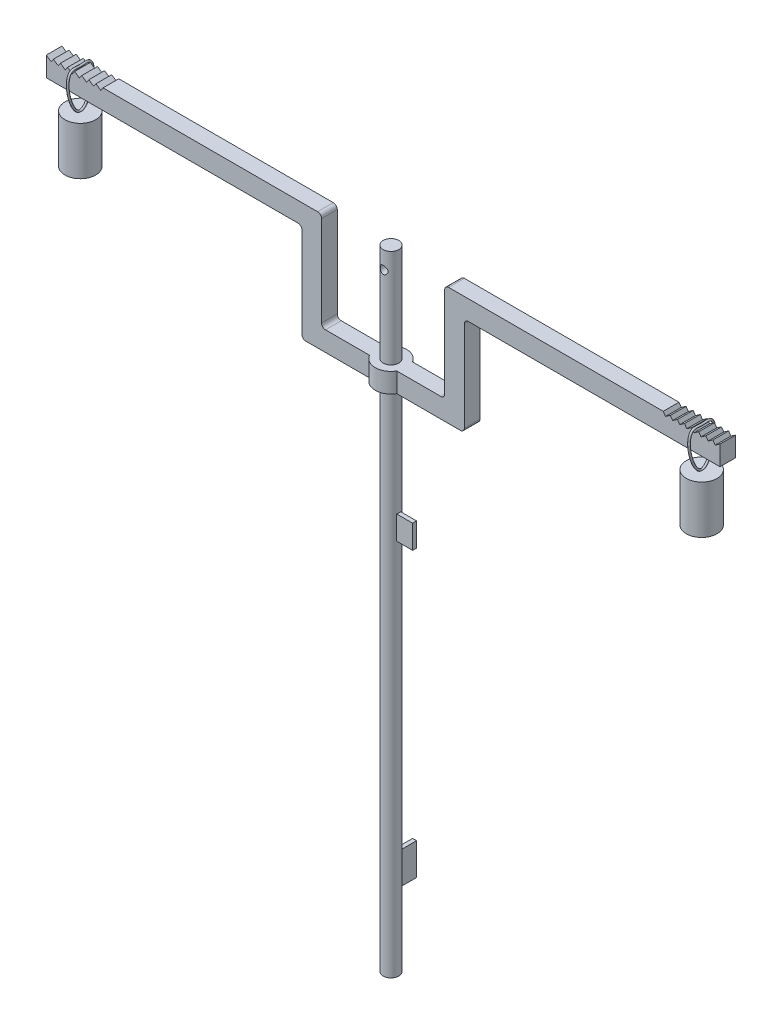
ISO-10303-21;
HEADER;
FILE_DESCRIPTION(('STEP AP214'),'2;1');
FILE_NAME('part.step','',(''),(''),'','','');
FILE_SCHEMA(('AUTOMOTIVE_DESIGN { 1 0 10303 214 1 1 1 1 }'));
ENDSEC;
DATA;
#1=APPLICATION_CONTEXT('core data for automotive mechanical design processes');
#2=APPLICATION_PROTOCOL_DEFINITION('international standard','automotive_design',2000,#1);
#3=PRODUCT_CONTEXT('',#1,'mechanical');
#4=PRODUCT('Part','Part','',(#3));
#5=PRODUCT_RELATED_PRODUCT_CATEGORY('part','',(#4));
#6=PRODUCT_DEFINITION_FORMATION('','',#4);
#7=PRODUCT_DEFINITION_CONTEXT('part definition',#1,'design');
#8=PRODUCT_DEFINITION('design','',#6,#7);
#9=PRODUCT_DEFINITION_SHAPE('','',#8);
#10=(LENGTH_UNIT() NAMED_UNIT(*) SI_UNIT(.MILLI.,.METRE.));
#11=(NAMED_UNIT(*) PLANE_ANGLE_UNIT() SI_UNIT($,.RADIAN.));
#12=(NAMED_UNIT(*) SI_UNIT($,.STERADIAN.) SOLID_ANGLE_UNIT());
#13=UNCERTAINTY_MEASURE_WITH_UNIT(LENGTH_MEASURE(1.E-05),#10,'distance_accuracy_value','');
#14=(GEOMETRIC_REPRESENTATION_CONTEXT(3) GLOBAL_UNCERTAINTY_ASSIGNED_CONTEXT((#13)) GLOBAL_UNIT_ASSIGNED_CONTEXT((#10,
#11,#12)) REPRESENTATION_CONTEXT('',''));
#15=CARTESIAN_POINT('',(0.,0.,0.));
#16=DIRECTION('',(0.,0.,1.));
#17=DIRECTION('',(1.,0.,0.));
#18=AXIS2_PLACEMENT_3D('',#15,#16,#17);
#19=CARTESIAN_POINT('',(-75.0846039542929,-9.93695570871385,5.24313290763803E-13));
#20=DIRECTION('',(0.,1.,0.));
#21=DIRECTION('',(0.,0.,-1.));
#22=AXIS2_PLACEMENT_3D('',#19,#20,#21);
#23=PLANE('',#22);
#24=CARTESIAN_POINT('',(-79.,-9.93695570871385,5.51654371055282E-13));
#25=DIRECTION('',(0.,1.,0.));
#26=DIRECTION('',(0.,0.,-1.));
#27=AXIS2_PLACEMENT_3D('',#24,#25,#26);
#28=CIRCLE('',#27,3.91539604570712);
#29=CARTESIAN_POINT('',(-79.,-9.93695570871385,-3.91539604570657));
#30=VERTEX_POINT('',#29);
#31=EDGE_CURVE('E381',#30,#30,#28,.T.);
#32=ORIENTED_EDGE('',*,*,#31,.T.);
#33=EDGE_LOOP('',(#32));
#34=FACE_BOUND('',#33,.T.);
#35=ADVANCED_FACE('F375',(#34),#23,.T.);
#36=CARTESIAN_POINT('',(-79.,-22.1415469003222,5.51654371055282E-13));
#37=DIRECTION('',(0.,-1.,0.));
#38=DIRECTION('',(0.,0.,1.));
#39=AXIS2_PLACEMENT_3D('',#36,#37,#38);
#40=PLANE('',#39);
#41=CARTESIAN_POINT('',(-79.,-22.1415469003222,5.51654371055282E-13));
#42=DIRECTION('',(0.,1.,0.));
#43=DIRECTION('',(0.,0.,-1.));
#44=AXIS2_PLACEMENT_3D('',#41,#42,#43);
#45=CIRCLE('',#44,3.91539604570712);
#46=CARTESIAN_POINT('',(-79.,-22.1415469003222,-3.91539604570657));
#47=VERTEX_POINT('',#46);
#48=EDGE_CURVE('E12',#47,#47,#45,.T.);
#49=ORIENTED_EDGE('',*,*,#48,.F.);
#50=EDGE_LOOP('',(#49));
#51=FACE_BOUND('',#50,.T.);
#52=ADVANCED_FACE('F390',(#51),#40,.T.);
#53=CARTESIAN_POINT('',(-79.,-9.93695570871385,5.51654371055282E-13));
#54=DIRECTION('',(0.,1.,0.));
#55=DIRECTION('',(0.,0.,-1.));
#56=AXIS2_PLACEMENT_3D('',#53,#54,#55);
#57=CYLINDRICAL_SURFACE('',#56,3.91539604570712);
#58=ORIENTED_EDGE('',*,*,#48,.T.);
#59=EDGE_LOOP('',(#58));
#60=FACE_BOUND('',#59,.T.);
#61=ORIENTED_EDGE('',*,*,#31,.F.);
#62=EDGE_LOOP('',(#61));
#63=FACE_BOUND('',#62,.T.);
#64=ADVANCED_FACE('F388',(#60,#63),#57,.T.);
#65=CLOSED_SHELL('',(#35,#52,#64));
#66=MANIFOLD_SOLID_BREP('B2',#65);
#67=CARTESIAN_POINT('',(-79.2459753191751,0.,5.53430998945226E-13));
#68=CARTESIAN_POINT('',(-79.2459753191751,-6.18447980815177E-10,0.555498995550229));
#69=CARTESIAN_POINT('',(-79.2459753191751,0.115785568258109,1.24987273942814));
#70=CARTESIAN_POINT('',(-79.2459753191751,0.0336313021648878,1.92203453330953));
#71=CARTESIAN_POINT('',(-79.2459753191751,-0.0736668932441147,2.21701964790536));
#72=CARTESIAN_POINT('',(-79.2459753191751,-0.247897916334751,2.47013248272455));
#73=CARTESIAN_POINT('',(-79.2459753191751,-0.508924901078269,2.70801768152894));
#74=CARTESIAN_POINT('',(-79.2459753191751,-0.875846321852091,2.91525580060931));
#75=CARTESIAN_POINT('',(-79.2459753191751,-1.36263209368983,3.07665219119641));
#76=CARTESIAN_POINT('',(-79.2459753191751,-1.92181298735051,3.17672630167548));
#77=CARTESIAN_POINT('',(-79.2459753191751,-2.54008744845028,3.21934969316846));
#78=CARTESIAN_POINT('',(-79.2459753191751,-3.8524394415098,3.19768746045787));
#79=CARTESIAN_POINT('',(-79.2459753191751,-5.62880503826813,2.87908238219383));
#80=CARTESIAN_POINT('',(-79.2459753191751,-7.5411340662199,2.20811914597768));
#81=CARTESIAN_POINT('',(-79.2459753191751,-8.63329979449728,1.64119663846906));
#82=CARTESIAN_POINT('',(-79.2459753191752,-9.32073511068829,1.12430363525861));
#83=CARTESIAN_POINT('',(-79.2459753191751,-9.65331912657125,0.763369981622));
#84=CARTESIAN_POINT('',(-79.2459753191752,-9.83194833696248,0.464365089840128));
#85=CARTESIAN_POINT('',(-79.2459753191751,-9.91718519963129,0.232725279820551));
#86=CARTESIAN_POINT('',(-79.2459753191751,-9.94639163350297,0.00352614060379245));
#87=CARTESIAN_POINT('',(-79.2459753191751,-9.91894167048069,-0.222146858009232));
#88=CARTESIAN_POINT('',(-79.2459753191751,-9.84112300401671,-0.44334963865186));
#89=CARTESIAN_POINT('',(-79.2459753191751,-9.71575123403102,-0.662664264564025));
#90=CARTESIAN_POINT('',(-79.2459753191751,-9.51375079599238,-0.920381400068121));
#91=CARTESIAN_POINT('',(-79.2459753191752,-9.20652057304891,-1.21262840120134));
#92=CARTESIAN_POINT('',(-79.2459753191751,-8.58210452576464,-1.66777113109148));
#93=CARTESIAN_POINT('',(-79.2459753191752,-7.54113406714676,-2.20811914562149));
#94=CARTESIAN_POINT('',(-79.2459753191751,-5.95430784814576,-2.76487587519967));
#95=CARTESIAN_POINT('',(-79.2459753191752,-4.19413061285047,-3.14611117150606));
#96=CARTESIAN_POINT('',(-79.2459753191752,-2.80564028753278,-3.24114373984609));
#97=CARTESIAN_POINT('',(-79.2459753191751,-1.89059332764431,-3.17251588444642));
#98=CARTESIAN_POINT('',(-79.2459753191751,-1.34435104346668,-3.07160443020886));
#99=CARTESIAN_POINT('',(-79.2459753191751,-0.868399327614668,-2.91140797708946));
#100=CARTESIAN_POINT('',(-79.2459753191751,-0.507051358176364,-2.7063104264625));
#101=CARTESIAN_POINT('',(-79.2459753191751,-0.24789795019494,-2.4701324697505));
#102=CARTESIAN_POINT('',(-79.2459753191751,-0.0736668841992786,-2.21701965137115));
#103=CARTESIAN_POINT('',(-79.2459753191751,0.0336312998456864,-1.92203453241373));
#104=CARTESIAN_POINT('',(-79.2459753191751,0.115785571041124,-1.24987274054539));
#105=CARTESIAN_POINT('',(-79.2459753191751,6.18447919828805E-10,-0.555498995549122));
#106=CARTESIAN_POINT('',(-79.2459753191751,0.,5.53430998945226E-13));
#107=CARTESIAN_POINT('',(-79.2459753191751,0.491950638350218,5.53430998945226E-13));
#108=CARTESIAN_POINT('',(-79.2459753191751,0.491950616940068,0.52619298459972));
#109=CARTESIAN_POINT('',(-79.2459753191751,0.614389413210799,1.18393420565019));
#110=CARTESIAN_POINT('',(-79.2459753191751,0.518889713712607,2.02723168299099));
#111=CARTESIAN_POINT('',(-79.2459753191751,0.368048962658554,2.44650231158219));
#112=CARTESIAN_POINT('',(-79.2459753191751,0.12396086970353,2.79877433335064));
#113=CARTESIAN_POINT('',(-79.2459753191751,-0.225678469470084,3.11565662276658));
#114=CARTESIAN_POINT('',(-79.2459753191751,-0.68237148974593,3.37074536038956));
#115=CARTESIAN_POINT('',(-79.2459753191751,-1.24630239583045,3.55628974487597));
#116=CARTESIAN_POINT('',(-79.2459753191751,-1.86477678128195,3.66627573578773));
#117=CARTESIAN_POINT('',(-79.2459753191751,-2.52943732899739,3.71177752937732));
#118=CARTESIAN_POINT('',(-79.2459753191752,-3.91575989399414,3.68836822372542));
#119=CARTESIAN_POINT('',(-79.2459753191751,-5.74917747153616,3.35799730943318));
#120=CARTESIAN_POINT('',(-79.2459753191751,-7.73201553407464,2.66300729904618));
#121=CARTESIAN_POINT('',(-79.2459753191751,-8.88517095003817,2.06664392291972));
#122=CARTESIAN_POINT('',(-79.2459753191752,-9.64514774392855,1.49723749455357));
#123=CARTESIAN_POINT('',(-79.2459753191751,-10.0416242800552,1.07187226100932));
#124=CARTESIAN_POINT('',(-79.2459753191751,-10.2760922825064,0.682306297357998));
#125=CARTESIAN_POINT('',(-79.2459753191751,-10.3981115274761,0.355460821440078));
#126=CARTESIAN_POINT('',(-79.2459753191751,-10.4435970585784,0.00543187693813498));
#127=CARTESIAN_POINT('',(-79.2459753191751,-10.4008732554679,-0.339478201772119));
#128=CARTESIAN_POINT('',(-79.2459753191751,-10.2889130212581,-0.653328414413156));
#129=CARTESIAN_POINT('',(-79.2459753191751,-10.1229767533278,-0.941724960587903));
#130=CARTESIAN_POINT('',(-79.2459753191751,-9.87369452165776,-1.25841854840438));
#131=CARTESIAN_POINT('',(-79.2459753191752,-9.51841017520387,-1.59476124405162));
#132=CARTESIAN_POINT('',(-79.2459753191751,-8.83108782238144,-2.09463352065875));
#133=CARTESIAN_POINT('',(-79.2459753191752,-7.73197502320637,-2.66294300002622));
#134=CARTESIAN_POINT('',(-79.2459753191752,-6.08687933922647,-3.23991100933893));
#135=CARTESIAN_POINT('',(-79.2459753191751,-4.26730701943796,-3.63399047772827));
#136=CARTESIAN_POINT('',(-79.2459753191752,-2.81567183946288,-3.73500513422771));
#137=CARTESIAN_POINT('',(-79.2459753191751,-1.83069053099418,-3.6617325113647));
#138=CARTESIAN_POINT('',(-79.2459753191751,-1.22549179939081,-3.55059685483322));
#139=CARTESIAN_POINT('',(-79.2459753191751,-0.673225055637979,-3.36610009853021));
#140=CARTESIAN_POINT('',(-79.2459753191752,-0.223164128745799,-3.11338330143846));
#141=CARTESIAN_POINT('',(-79.2459753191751,0.123959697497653,-2.79877410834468));
#142=CARTESIAN_POINT('',(-79.2459753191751,0.368049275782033,-2.44650237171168));
#143=CARTESIAN_POINT('',(-79.2459753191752,0.518889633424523,-2.0272316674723));
#144=CARTESIAN_POINT('',(-79.2459753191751,0.614389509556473,-1.18393422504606));
#145=CARTESIAN_POINT('',(-79.2459753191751,0.491950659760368,-0.526192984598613));
#146=CARTESIAN_POINT('',(-79.2459753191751,0.491950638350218,5.53430998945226E-13));
#147=CARTESIAN_POINT('',(-78.7540246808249,0.491950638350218,5.50056419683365E-13));
#148=CARTESIAN_POINT('',(-78.7540246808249,0.491950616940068,0.526192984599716));
#149=CARTESIAN_POINT('',(-78.7540246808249,0.614389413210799,1.18393420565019));
#150=CARTESIAN_POINT('',(-78.7540246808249,0.518889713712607,2.02723168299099));
#151=CARTESIAN_POINT('',(-78.7540246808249,0.368048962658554,2.44650231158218));
#152=CARTESIAN_POINT('',(-78.7540246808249,0.123960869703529,2.79877433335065));
#153=CARTESIAN_POINT('',(-78.7540246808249,-0.225678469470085,3.11565662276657));
#154=CARTESIAN_POINT('',(-78.7540246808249,-0.682371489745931,3.37074536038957));
#155=CARTESIAN_POINT('',(-78.7540246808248,-1.24630239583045,3.55628974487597));
#156=CARTESIAN_POINT('',(-78.7540246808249,-1.86477678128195,3.66627573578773));
#157=CARTESIAN_POINT('',(-78.7540246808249,-2.52943732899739,3.71177752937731));
#158=CARTESIAN_POINT('',(-78.7540246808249,-3.91575989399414,3.68836822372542));
#159=CARTESIAN_POINT('',(-78.7540246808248,-5.74917747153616,3.35799730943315));
#160=CARTESIAN_POINT('',(-78.7540246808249,-7.73201553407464,2.66300729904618));
#161=CARTESIAN_POINT('',(-78.7540246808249,-8.88517095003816,2.06664392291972));
#162=CARTESIAN_POINT('',(-78.7540246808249,-9.64514774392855,1.49723749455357));
#163=CARTESIAN_POINT('',(-78.7540246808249,-10.0416242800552,1.07187226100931));
#164=CARTESIAN_POINT('',(-78.7540246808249,-10.2760922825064,0.682306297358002));
#165=CARTESIAN_POINT('',(-78.7540246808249,-10.3981115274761,0.355460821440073));
#166=CARTESIAN_POINT('',(-78.7540246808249,-10.4435970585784,0.00543187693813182));
#167=CARTESIAN_POINT('',(-78.7540246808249,-10.4008732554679,-0.339478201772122));
#168=CARTESIAN_POINT('',(-78.7540246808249,-10.2889130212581,-0.653328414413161));
#169=CARTESIAN_POINT('',(-78.7540246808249,-10.1229767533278,-0.941724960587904));
#170=CARTESIAN_POINT('',(-78.7540246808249,-9.87369452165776,-1.25841854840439));
#171=CARTESIAN_POINT('',(-78.7540246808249,-9.51841017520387,-1.59476124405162));
#172=CARTESIAN_POINT('',(-78.7540246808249,-8.83108782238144,-2.09463352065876));
#173=CARTESIAN_POINT('',(-78.754024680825,-7.73197502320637,-2.66294300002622));
#174=CARTESIAN_POINT('',(-78.7540246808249,-6.08687933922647,-3.23991100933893));
#175=CARTESIAN_POINT('',(-78.7540246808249,-4.26730701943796,-3.63399047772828));
#176=CARTESIAN_POINT('',(-78.754024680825,-2.81567183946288,-3.7350051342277));
#177=CARTESIAN_POINT('',(-78.7540246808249,-1.83069053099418,-3.66173251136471));
#178=CARTESIAN_POINT('',(-78.7540246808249,-1.2254917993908,-3.55059685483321));
#179=CARTESIAN_POINT('',(-78.7540246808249,-0.673225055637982,-3.36610009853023));
#180=CARTESIAN_POINT('',(-78.7540246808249,-0.223164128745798,-3.11338330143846));
#181=CARTESIAN_POINT('',(-78.7540246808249,0.123959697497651,-2.79877410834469));
#182=CARTESIAN_POINT('',(-78.7540246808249,0.368049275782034,-2.44650237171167));
#183=CARTESIAN_POINT('',(-78.7540246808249,0.518889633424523,-2.02723166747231));
#184=CARTESIAN_POINT('',(-78.7540246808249,0.614389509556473,-1.18393422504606));
#185=CARTESIAN_POINT('',(-78.7540246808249,0.491950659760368,-0.526192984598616));
#186=CARTESIAN_POINT('',(-78.7540246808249,0.491950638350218,5.50056419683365E-13));
#187=CARTESIAN_POINT('',(-78.7540246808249,0.,5.49961551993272E-13));
#188=CARTESIAN_POINT('',(-78.7540246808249,-6.18447960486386E-10,0.555498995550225));
#189=CARTESIAN_POINT('',(-78.7540246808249,0.115785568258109,1.24987273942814));
#190=CARTESIAN_POINT('',(-78.7540246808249,0.0336313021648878,1.92203453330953));
#191=CARTESIAN_POINT('',(-78.7540246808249,-0.0736668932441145,2.21701964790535));
#192=CARTESIAN_POINT('',(-78.7540246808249,-0.247897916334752,2.47013248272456));
#193=CARTESIAN_POINT('',(-78.7540246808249,-0.508924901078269,2.70801768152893));
#194=CARTESIAN_POINT('',(-78.7540246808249,-0.875846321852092,2.91525580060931));
#195=CARTESIAN_POINT('',(-78.7540246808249,-1.36263209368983,3.07665219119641));
#196=CARTESIAN_POINT('',(-78.7540246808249,-1.92181298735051,3.17672630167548));
#197=CARTESIAN_POINT('',(-78.7540246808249,-2.54008744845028,3.21934969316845));
#198=CARTESIAN_POINT('',(-78.7540246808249,-3.8524394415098,3.19768746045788));
#199=CARTESIAN_POINT('',(-78.7540246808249,-5.62880503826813,2.87908238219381));
#200=CARTESIAN_POINT('',(-78.7540246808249,-7.5411340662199,2.20811914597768));
#201=CARTESIAN_POINT('',(-78.7540246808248,-8.63329979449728,1.64119663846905));
#202=CARTESIAN_POINT('',(-78.7540246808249,-9.3207351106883,1.12430363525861));
#203=CARTESIAN_POINT('',(-78.7540246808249,-9.65331912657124,0.763369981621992));
#204=CARTESIAN_POINT('',(-78.7540246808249,-9.83194833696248,0.464365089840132));
#205=CARTESIAN_POINT('',(-78.7540246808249,-9.91718519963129,0.232725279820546));
#206=CARTESIAN_POINT('',(-78.7540246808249,-9.94639163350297,0.0035261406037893));
#207=CARTESIAN_POINT('',(-78.7540246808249,-9.91894167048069,-0.222146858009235));
#208=CARTESIAN_POINT('',(-78.7540246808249,-9.84112300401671,-0.443349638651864));
#209=CARTESIAN_POINT('',(-78.7540246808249,-9.71575123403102,-0.662664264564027));
#210=CARTESIAN_POINT('',(-78.7540246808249,-9.51375079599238,-0.920381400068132));
#211=CARTESIAN_POINT('',(-78.7540246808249,-9.20652057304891,-1.21262840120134));
#212=CARTESIAN_POINT('',(-78.7540246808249,-8.58210452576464,-1.66777113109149));
#213=CARTESIAN_POINT('',(-78.7540246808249,-7.54113406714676,-2.20811914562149));
#214=CARTESIAN_POINT('',(-78.7540246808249,-5.95430784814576,-2.76487587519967));
#215=CARTESIAN_POINT('',(-78.7540246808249,-4.19413061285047,-3.14611117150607));
#216=CARTESIAN_POINT('',(-78.754024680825,-2.80564028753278,-3.24114373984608));
#217=CARTESIAN_POINT('',(-78.7540246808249,-1.89059332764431,-3.17251588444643));
#218=CARTESIAN_POINT('',(-78.7540246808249,-1.34435104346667,-3.07160443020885));
#219=CARTESIAN_POINT('',(-78.7540246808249,-0.86839932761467,-2.91140797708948));
#220=CARTESIAN_POINT('',(-78.7540246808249,-0.507051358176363,-2.7063104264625));
#221=CARTESIAN_POINT('',(-78.7540246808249,-0.247897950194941,-2.47013246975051));
#222=CARTESIAN_POINT('',(-78.7540246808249,-0.0736668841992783,-2.21701965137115));
#223=CARTESIAN_POINT('',(-78.7540246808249,0.0336312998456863,-1.92203453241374));
#224=CARTESIAN_POINT('',(-78.7540246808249,0.115785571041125,-1.24987274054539));
#225=CARTESIAN_POINT('',(-78.7540246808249,6.18447974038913E-10,-0.555498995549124));
#226=CARTESIAN_POINT('',(-78.7540246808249,0.,5.49961551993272E-13));
#227=CARTESIAN_POINT('',(-78.7540246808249,-0.491950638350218,5.50015762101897E-13));
#228=CARTESIAN_POINT('',(-78.7540246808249,-0.491950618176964,0.584805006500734));
#229=CARTESIAN_POINT('',(-78.7540246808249,-0.382818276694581,1.31581127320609));
#230=CARTESIAN_POINT('',(-78.7540246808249,-0.451627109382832,1.81683738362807));
#231=CARTESIAN_POINT('',(-78.7540246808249,-0.515382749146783,1.98753698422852));
#232=CARTESIAN_POINT('',(-78.7540246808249,-0.619756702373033,2.14149063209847));
#233=CARTESIAN_POINT('',(-78.7540246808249,-0.792171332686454,2.30037874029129));
#234=CARTESIAN_POINT('',(-78.7540246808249,-1.06932115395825,2.45976624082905));
#235=CARTESIAN_POINT('',(-78.7540246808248,-1.47896179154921,2.59701463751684));
#236=CARTESIAN_POINT('',(-78.7540246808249,-1.97884919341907,2.68717686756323));
#237=CARTESIAN_POINT('',(-78.7540246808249,-2.55073756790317,2.72692185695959));
#238=CARTESIAN_POINT('',(-78.7540246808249,-3.78911898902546,2.70700669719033));
#239=CARTESIAN_POINT('',(-78.7540246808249,-5.5084326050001,2.40016745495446));
#240=CARTESIAN_POINT('',(-78.7540246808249,-7.35025259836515,1.75323099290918));
#241=CARTESIAN_POINT('',(-78.7540246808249,-8.38142863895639,1.21574935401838));
#242=CARTESIAN_POINT('',(-78.7540246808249,-8.99632247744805,0.751369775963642));
#243=CARTESIAN_POINT('',(-78.7540246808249,-9.26501397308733,0.45486770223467));
#244=CARTESIAN_POINT('',(-78.7540246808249,-9.38780439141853,0.246423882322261));
#245=CARTESIAN_POINT('',(-78.7540246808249,-9.43625887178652,0.109989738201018));
#246=CARTESIAN_POINT('',(-78.7540246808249,-9.44918620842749,0.00162040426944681));
#247=CARTESIAN_POINT('',(-78.7540246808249,-9.43701008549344,-0.104815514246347));
#248=CARTESIAN_POINT('',(-78.7540246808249,-9.39333298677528,-0.233370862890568));
#249=CARTESIAN_POINT('',(-78.7540246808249,-9.30852571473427,-0.383603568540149));
#250=CARTESIAN_POINT('',(-78.7540246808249,-9.15380707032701,-0.582344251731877));
#251=CARTESIAN_POINT('',(-78.7540246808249,-8.89463097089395,-0.830495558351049));
#252=CARTESIAN_POINT('',(-78.7540246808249,-8.33312122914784,-1.24090874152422));
#253=CARTESIAN_POINT('',(-78.7540246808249,-7.35029311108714,-1.75329529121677));
#254=CARTESIAN_POINT('',(-78.7540246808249,-5.82173635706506,-2.28984074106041));
#255=CARTESIAN_POINT('',(-78.7540246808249,-4.12095420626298,-2.65823186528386));
#256=CARTESIAN_POINT('',(-78.754024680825,-2.79560873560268,-2.74728234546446));
#257=CARTESIAN_POINT('',(-78.7540246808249,-1.95049612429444,-2.68329925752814));
#258=CARTESIAN_POINT('',(-78.7540246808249,-1.46321028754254,-2.59261200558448));
#259=CARTESIAN_POINT('',(-78.7540246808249,-1.06357359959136,-2.45671585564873));
#260=CARTESIAN_POINT('',(-78.7540246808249,-0.790938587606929,-2.29923755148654));
#261=CARTESIAN_POINT('',(-78.7540246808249,-0.619755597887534,-2.14149083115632));
#262=CARTESIAN_POINT('',(-78.7540246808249,-0.51538304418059,-1.98753693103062));
#263=CARTESIAN_POINT('',(-78.7540246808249,-0.451627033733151,-1.81683739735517));
#264=CARTESIAN_POINT('',(-78.7540246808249,-0.382818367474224,-1.31581125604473));
#265=CARTESIAN_POINT('',(-78.7540246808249,-0.491950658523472,-0.584805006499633));
#266=CARTESIAN_POINT('',(-78.7540246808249,-0.491950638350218,5.50015762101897E-13));
#267=CARTESIAN_POINT('',(-79.2459753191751,-0.491950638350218,5.53471656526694E-13));
#268=CARTESIAN_POINT('',(-79.2459753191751,-0.491950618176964,0.584805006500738));
#269=CARTESIAN_POINT('',(-79.2459753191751,-0.382818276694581,1.3158112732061));
#270=CARTESIAN_POINT('',(-79.2459753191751,-0.451627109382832,1.81683738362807));
#271=CARTESIAN_POINT('',(-79.2459753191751,-0.515382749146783,1.98753698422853));
#272=CARTESIAN_POINT('',(-79.2459753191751,-0.619756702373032,2.14149063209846));
#273=CARTESIAN_POINT('',(-79.2459753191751,-0.792171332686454,2.3003787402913));
#274=CARTESIAN_POINT('',(-79.2459753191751,-1.06932115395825,2.45976624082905));
#275=CARTESIAN_POINT('',(-79.2459753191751,-1.47896179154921,2.59701463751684));
#276=CARTESIAN_POINT('',(-79.2459753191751,-1.97884919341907,2.68717686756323));
#277=CARTESIAN_POINT('',(-79.2459753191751,-2.55073756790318,2.72692185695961));
#278=CARTESIAN_POINT('',(-79.2459753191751,-3.78911898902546,2.70700669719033));
#279=CARTESIAN_POINT('',(-79.2459753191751,-5.5084326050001,2.40016745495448));
#280=CARTESIAN_POINT('',(-79.2459753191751,-7.35025259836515,1.75323099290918));
#281=CARTESIAN_POINT('',(-79.2459753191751,-8.3814286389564,1.21574935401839));
#282=CARTESIAN_POINT('',(-79.2459753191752,-8.99632247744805,0.751369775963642));
#283=CARTESIAN_POINT('',(-79.2459753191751,-9.26501397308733,0.454867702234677));
#284=CARTESIAN_POINT('',(-79.2459753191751,-9.38780439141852,0.246423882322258));
#285=CARTESIAN_POINT('',(-79.2459753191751,-9.43625887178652,0.109989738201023));
#286=CARTESIAN_POINT('',(-79.2459753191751,-9.4491862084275,0.00162040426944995));
#287=CARTESIAN_POINT('',(-79.2459753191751,-9.43701008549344,-0.104815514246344));
#288=CARTESIAN_POINT('',(-79.2459753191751,-9.39333298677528,-0.233370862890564));
#289=CARTESIAN_POINT('',(-79.2459753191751,-9.30852571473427,-0.383603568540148));
#290=CARTESIAN_POINT('',(-79.2459753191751,-9.15380707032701,-0.582344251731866));
#291=CARTESIAN_POINT('',(-79.2459753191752,-8.89463097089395,-0.830495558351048));
#292=CARTESIAN_POINT('',(-79.2459753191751,-8.33312122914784,-1.24090874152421));
#293=CARTESIAN_POINT('',(-79.2459753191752,-7.35029311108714,-1.75329529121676));
#294=CARTESIAN_POINT('',(-79.2459753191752,-5.82173635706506,-2.28984074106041));
#295=CARTESIAN_POINT('',(-79.2459753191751,-4.12095420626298,-2.65823186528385));
#296=CARTESIAN_POINT('',(-79.2459753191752,-2.79560873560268,-2.74728234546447));
#297=CARTESIAN_POINT('',(-79.2459753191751,-1.95049612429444,-2.68329925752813));
#298=CARTESIAN_POINT('',(-79.2459753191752,-1.46321028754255,-2.59261200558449));
#299=CARTESIAN_POINT('',(-79.2459753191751,-1.06357359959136,-2.45671585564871));
#300=CARTESIAN_POINT('',(-79.2459753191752,-0.790938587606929,-2.29923755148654));
#301=CARTESIAN_POINT('',(-79.2459753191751,-0.619755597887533,-2.14149083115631));
#302=CARTESIAN_POINT('',(-79.2459753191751,-0.515383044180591,-1.98753693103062));
#303=CARTESIAN_POINT('',(-79.2459753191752,-0.451627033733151,-1.81683739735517));
#304=CARTESIAN_POINT('',(-79.2459753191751,-0.382818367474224,-1.31581125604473));
#305=CARTESIAN_POINT('',(-79.2459753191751,-0.491950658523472,-0.584805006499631));
#306=CARTESIAN_POINT('',(-79.2459753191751,-0.491950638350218,5.53471656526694E-13));
#307=CARTESIAN_POINT('',(-79.2459753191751,0.,5.53430998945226E-13));
#308=CARTESIAN_POINT('',(-79.2459753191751,-6.18447980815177E-10,0.555498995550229));
#309=CARTESIAN_POINT('',(-79.2459753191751,0.115785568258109,1.24987273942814));
#310=CARTESIAN_POINT('',(-79.2459753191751,0.0336313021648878,1.92203453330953));
#311=CARTESIAN_POINT('',(-79.2459753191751,-0.0736668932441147,2.21701964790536));
#312=CARTESIAN_POINT('',(-79.2459753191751,-0.247897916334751,2.47013248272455));
#313=CARTESIAN_POINT('',(-79.2459753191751,-0.508924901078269,2.70801768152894));
#314=CARTESIAN_POINT('',(-79.2459753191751,-0.875846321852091,2.91525580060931));
#315=CARTESIAN_POINT('',(-79.2459753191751,-1.36263209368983,3.07665219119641));
#316=CARTESIAN_POINT('',(-79.2459753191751,-1.92181298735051,3.17672630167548));
#317=CARTESIAN_POINT('',(-79.2459753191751,-2.54008744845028,3.21934969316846));
#318=CARTESIAN_POINT('',(-79.2459753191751,-3.8524394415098,3.19768746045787));
#319=CARTESIAN_POINT('',(-79.2459753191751,-5.62880503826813,2.87908238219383));
#320=CARTESIAN_POINT('',(-79.2459753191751,-7.5411340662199,2.20811914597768));
#321=CARTESIAN_POINT('',(-79.2459753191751,-8.63329979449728,1.64119663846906));
#322=CARTESIAN_POINT('',(-79.2459753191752,-9.32073511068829,1.12430363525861));
#323=CARTESIAN_POINT('',(-79.2459753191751,-9.65331912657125,0.763369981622));
#324=CARTESIAN_POINT('',(-79.2459753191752,-9.83194833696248,0.464365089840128));
#325=CARTESIAN_POINT('',(-79.2459753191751,-9.91718519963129,0.232725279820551));
#326=CARTESIAN_POINT('',(-79.2459753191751,-9.94639163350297,0.00352614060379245));
#327=CARTESIAN_POINT('',(-79.2459753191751,-9.91894167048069,-0.222146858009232));
#328=CARTESIAN_POINT('',(-79.2459753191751,-9.84112300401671,-0.44334963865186));
#329=CARTESIAN_POINT('',(-79.2459753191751,-9.71575123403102,-0.662664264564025));
#330=CARTESIAN_POINT('',(-79.2459753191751,-9.51375079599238,-0.920381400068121));
#331=CARTESIAN_POINT('',(-79.2459753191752,-9.20652057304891,-1.21262840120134));
#332=CARTESIAN_POINT('',(-79.2459753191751,-8.58210452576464,-1.66777113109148));
#333=CARTESIAN_POINT('',(-79.2459753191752,-7.54113406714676,-2.20811914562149));
#334=CARTESIAN_POINT('',(-79.2459753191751,-5.95430784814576,-2.76487587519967));
#335=CARTESIAN_POINT('',(-79.2459753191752,-4.19413061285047,-3.14611117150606));
#336=CARTESIAN_POINT('',(-79.2459753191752,-2.80564028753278,-3.24114373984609));
#337=CARTESIAN_POINT('',(-79.2459753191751,-1.89059332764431,-3.17251588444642));
#338=CARTESIAN_POINT('',(-79.2459753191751,-1.34435104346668,-3.07160443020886));
#339=CARTESIAN_POINT('',(-79.2459753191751,-0.868399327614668,-2.91140797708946));
#340=CARTESIAN_POINT('',(-79.2459753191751,-0.507051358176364,-2.7063104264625));
#341=CARTESIAN_POINT('',(-79.2459753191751,-0.24789795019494,-2.4701324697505));
#342=CARTESIAN_POINT('',(-79.2459753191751,-0.0736668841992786,-2.21701965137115));
#343=CARTESIAN_POINT('',(-79.2459753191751,0.0336312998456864,-1.92203453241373));
#344=CARTESIAN_POINT('',(-79.2459753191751,0.115785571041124,-1.24987274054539));
#345=CARTESIAN_POINT('',(-79.2459753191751,6.18447919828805E-10,-0.555498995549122));
#346=CARTESIAN_POINT('',(-79.2459753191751,0.,5.53430998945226E-13));
#347=(BOUNDED_SURFACE() B_SPLINE_SURFACE(3,3,((#67,#68,#69,#70,#71,#72,#73,#74,#75,#76,#77,#78,
#79,#80,#81,#82,#83,#84,#85,#86,#87,#88,#89,#90,#91,#92,#93,#94,#95,#96,#97,#98,#99,#100,#101,
#102,#103,#104,#105,#106),(#107,#108,#109,#110,#111,#112,#113,#114,#115,#116,#117,#118,#119,
#120,#121,#122,#123,#124,#125,#126,#127,#128,#129,#130,#131,#132,#133,#134,#135,#136,#137,#138,
#139,#140,#141,#142,#143,#144,#145,#146),(#147,#148,#149,#150,#151,#152,#153,#154,#155,#156,
#157,#158,#159,#160,#161,#162,#163,#164,#165,#166,#167,#168,#169,#170,#171,#172,#173,#174,#175,
#176,#177,#178,#179,#180,#181,#182,#183,#184,#185,#186),(#187,#188,#189,#190,#191,#192,#193,
#194,#195,#196,#197,#198,#199,#200,#201,#202,#203,#204,#205,#206,#207,#208,#209,#210,#211,#212,
#213,#214,#215,#216,#217,#218,#219,#220,#221,#222,#223,#224,#225,#226),(#227,#228,#229,#230,
#231,#232,#233,#234,#235,#236,#237,#238,#239,#240,#241,#242,#243,#244,#245,#246,#247,#248,#249,
#250,#251,#252,#253,#254,#255,#256,#257,#258,#259,#260,#261,#262,#263,#264,#265,#266),(#267,
#268,#269,#270,#271,#272,#273,#274,#275,#276,#277,#278,#279,#280,#281,#282,#283,#284,#285,#286,
#287,#288,#289,#290,#291,#292,#293,#294,#295,#296,#297,#298,#299,#300,#301,#302,#303,#304,#305,
#306),(#307,#308,#309,#310,#311,#312,#313,#314,#315,#316,#317,#318,#319,#320,#321,#322,#323,
#324,#325,#326,#327,#328,#329,#330,#331,#332,#333,#334,#335,#336,#337,#338,#339,#340,#341,#342,
#343,#344,#345,#346)),.UNSPECIFIED.,.T.,.T.,.F.) B_SPLINE_SURFACE_WITH_KNOTS((4,3,4),(4,1,1,1,1,
1,1,1,1,1,1,1,1,1,1,1,1,1,1,1,1,1,1,1,1,1,1,1,1,1,1,1,1,1,1,1,1,4),(0.,0.5,1.),(0.,0.0625,
0.078125,0.09375,0.109375,0.125,0.146,0.167,0.18800000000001,0.209,0.23,0.3125,0.359375,0.40625,
0.4325,0.45875,0.472499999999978,0.48625,0.5,0.513125,0.526250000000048,0.539375,0.5525,
0.573125,0.59375,0.640625,0.6875,0.739999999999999,0.7925,0.813124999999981,0.83375,0.854375,
0.875,0.890625,0.90625,0.921875,0.9375,1.),
.UNSPECIFIED.) GEOMETRIC_REPRESENTATION_ITEM() RATIONAL_B_SPLINE_SURFACE(((1.,1.,1.,1.,1.,1.,1.,
1.,1.,1.,1.,1.,1.,0.999999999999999,1.,1.,1.,1.,1.,1.,1.,1.,1.,1.,1.,1.,1.,1.,1.,1.,1.,1.,1.,1.,
1.,1.,1.,1.,1.,1.),(0.333333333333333,0.333333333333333,0.333333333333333,0.333333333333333,
0.333333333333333,0.333333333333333,0.333333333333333,0.333333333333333,0.333333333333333,
0.333333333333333,0.333333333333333,0.333333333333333,0.333333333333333,0.333333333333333,
0.333333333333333,0.333333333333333,0.333333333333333,0.333333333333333,0.333333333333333,
0.333333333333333,0.333333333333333,0.333333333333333,0.333333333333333,0.333333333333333,
0.333333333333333,0.333333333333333,0.333333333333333,0.333333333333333,0.333333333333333,
0.333333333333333,0.333333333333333,0.333333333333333,0.333333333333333,0.333333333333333,
0.333333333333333,0.333333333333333,0.333333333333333,0.333333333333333,0.333333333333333,
0.333333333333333),(0.333333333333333,0.333333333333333,0.333333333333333,0.333333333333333,
0.333333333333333,0.333333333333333,0.333333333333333,0.333333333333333,0.333333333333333,
0.333333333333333,0.333333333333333,0.333333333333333,0.333333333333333,0.333333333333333,
0.333333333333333,0.333333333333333,0.333333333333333,0.333333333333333,0.333333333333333,
0.333333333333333,0.333333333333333,0.333333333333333,0.333333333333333,0.333333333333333,
0.333333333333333,0.333333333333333,0.333333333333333,0.333333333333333,0.333333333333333,
0.333333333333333,0.333333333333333,0.333333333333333,0.333333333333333,0.333333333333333,
0.333333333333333,0.333333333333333,0.333333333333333,0.333333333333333,0.333333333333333,
0.333333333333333),(1.,1.,1.,1.,1.,1.,1.,1.,1.,1.,1.,1.,1.,0.999999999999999,1.,1.,1.,1.,1.,1.,
1.,1.,1.,1.,1.,1.,1.,1.,1.,1.,1.,1.,1.,1.,1.,1.,1.,1.,1.,1.),(0.333333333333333,
0.333333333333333,0.333333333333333,0.333333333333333,0.333333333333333,0.333333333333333,
0.333333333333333,0.333333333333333,0.333333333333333,0.333333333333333,0.333333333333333,
0.333333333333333,0.333333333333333,0.333333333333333,0.333333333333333,0.333333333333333,
0.333333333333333,0.333333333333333,0.333333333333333,0.333333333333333,0.333333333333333,
0.333333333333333,0.333333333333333,0.333333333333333,0.333333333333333,0.333333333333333,
0.333333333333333,0.333333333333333,0.333333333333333,0.333333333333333,0.333333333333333,
0.333333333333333,0.333333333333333,0.333333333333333,0.333333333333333,0.333333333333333,
0.333333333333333,0.333333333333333,0.333333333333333,0.333333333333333),(0.333333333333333,
0.333333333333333,0.333333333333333,0.333333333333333,0.333333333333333,0.333333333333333,
0.333333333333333,0.333333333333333,0.333333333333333,0.333333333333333,0.333333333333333,
0.333333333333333,0.333333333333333,0.333333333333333,0.333333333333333,0.333333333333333,
0.333333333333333,0.333333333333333,0.333333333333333,0.333333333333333,0.333333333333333,
0.333333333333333,0.333333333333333,0.333333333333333,0.333333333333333,0.333333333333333,
0.333333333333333,0.333333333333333,0.333333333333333,0.333333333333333,0.333333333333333,
0.333333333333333,0.333333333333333,0.333333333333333,0.333333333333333,0.333333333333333,
0.333333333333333,0.333333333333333,0.333333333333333,0.333333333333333),(1.,1.,1.,1.,1.,1.,1.,
1.,1.,1.,1.,1.,1.,0.999999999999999,1.,1.,1.,1.,1.,1.,1.,1.,1.,1.,1.,1.,1.,1.,1.,1.,1.,1.,1.,1.,
1.,1.,1.,1.,1.,1.))) REPRESENTATION_ITEM('') SURFACE());
#348=ADVANCED_FACE('F415',(),#347,.F.);
#349=CLOSED_SHELL('',(#348));
#350=MANIFOLD_SOLID_BREP('B7',#349);
#351=CARTESIAN_POINT('',(79.2459753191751,0.,0.));
#352=CARTESIAN_POINT('',(79.2459753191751,-6.18447980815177E-10,-0.555498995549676));
#353=CARTESIAN_POINT('',(79.2459753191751,0.115785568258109,-1.24987273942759));
#354=CARTESIAN_POINT('',(79.2459753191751,0.0336313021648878,-1.92203453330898));
#355=CARTESIAN_POINT('',(79.2459753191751,-0.0736668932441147,-2.2170196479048));
#356=CARTESIAN_POINT('',(79.2459753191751,-0.247897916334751,-2.470132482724));
#357=CARTESIAN_POINT('',(79.2459753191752,-0.508924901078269,-2.70801768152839));
#358=CARTESIAN_POINT('',(79.2459753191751,-0.875846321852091,-2.91525580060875));
#359=CARTESIAN_POINT('',(79.2459753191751,-1.36263209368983,-3.07665219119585));
#360=CARTESIAN_POINT('',(79.2459753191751,-1.92181298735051,-3.17672630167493));
#361=CARTESIAN_POINT('',(79.2459753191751,-2.54008744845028,-3.21934969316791));
#362=CARTESIAN_POINT('',(79.2459753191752,-3.8524394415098,-3.19768746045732));
#363=CARTESIAN_POINT('',(79.2459753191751,-5.62880503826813,-2.87908238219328));
#364=CARTESIAN_POINT('',(79.2459753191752,-7.5411340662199,-2.20811914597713));
#365=CARTESIAN_POINT('',(79.2459753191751,-8.63329979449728,-1.6411966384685));
#366=CARTESIAN_POINT('',(79.2459753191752,-9.32073511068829,-1.12430363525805));
#367=CARTESIAN_POINT('',(79.2459753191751,-9.65331912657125,-0.763369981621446));
#368=CARTESIAN_POINT('',(79.2459753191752,-9.83194833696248,-0.464365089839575));
#369=CARTESIAN_POINT('',(79.2459753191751,-9.91718519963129,-0.232725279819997));
#370=CARTESIAN_POINT('',(79.2459753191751,-9.94639163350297,-0.00352614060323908));
#371=CARTESIAN_POINT('',(79.2459753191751,-9.91894167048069,0.222146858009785));
#372=CARTESIAN_POINT('',(79.2459753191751,-9.84112300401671,0.443349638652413));
#373=CARTESIAN_POINT('',(79.2459753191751,-9.71575123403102,0.662664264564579));
#374=CARTESIAN_POINT('',(79.2459753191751,-9.51375079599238,0.920381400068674));
#375=CARTESIAN_POINT('',(79.2459753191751,-9.20652057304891,1.21262840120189));
#376=CARTESIAN_POINT('',(79.2459753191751,-8.58210452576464,1.66777113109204));
#377=CARTESIAN_POINT('',(79.2459753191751,-7.54113406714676,2.20811914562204));
#378=CARTESIAN_POINT('',(79.2459753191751,-5.95430784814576,2.76487587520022));
#379=CARTESIAN_POINT('',(79.2459753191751,-4.19413061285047,3.14611117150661));
#380=CARTESIAN_POINT('',(79.2459753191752,-2.80564028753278,3.24114373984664));
#381=CARTESIAN_POINT('',(79.2459753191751,-1.89059332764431,3.17251588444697));
#382=CARTESIAN_POINT('',(79.2459753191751,-1.34435104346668,3.07160443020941));
#383=CARTESIAN_POINT('',(79.2459753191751,-0.868399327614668,2.91140797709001));
#384=CARTESIAN_POINT('',(79.2459753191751,-0.507051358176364,2.70631042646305));
#385=CARTESIAN_POINT('',(79.2459753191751,-0.24789795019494,2.47013246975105));
#386=CARTESIAN_POINT('',(79.2459753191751,-0.0736668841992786,2.2170196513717));
#387=CARTESIAN_POINT('',(79.2459753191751,0.0336312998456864,1.92203453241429));
#388=CARTESIAN_POINT('',(79.2459753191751,0.115785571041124,1.24987274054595));
#389=CARTESIAN_POINT('',(79.2459753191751,6.18447919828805E-10,0.555498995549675));
#390=CARTESIAN_POINT('',(79.2459753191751,0.,0.));
#391=CARTESIAN_POINT('',(79.2459753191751,0.491950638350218,0.));
#392=CARTESIAN_POINT('',(79.2459753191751,0.491950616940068,-0.526192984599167));
#393=CARTESIAN_POINT('',(79.2459753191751,0.614389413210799,-1.18393420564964));
#394=CARTESIAN_POINT('',(79.2459753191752,0.518889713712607,-2.02723168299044));
#395=CARTESIAN_POINT('',(79.2459753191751,0.368048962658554,-2.44650231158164));
#396=CARTESIAN_POINT('',(79.2459753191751,0.12396086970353,-2.79877433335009));
#397=CARTESIAN_POINT('',(79.2459753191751,-0.225678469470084,-3.11565662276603));
#398=CARTESIAN_POINT('',(79.2459753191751,-0.68237148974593,-3.37074536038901));
#399=CARTESIAN_POINT('',(79.2459753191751,-1.24630239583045,-3.55628974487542));
#400=CARTESIAN_POINT('',(79.2459753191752,-1.86477678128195,-3.66627573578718));
#401=CARTESIAN_POINT('',(79.2459753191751,-2.52943732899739,-3.71177752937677));
#402=CARTESIAN_POINT('',(79.2459753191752,-3.91575989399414,-3.68836822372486));
#403=CARTESIAN_POINT('',(79.2459753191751,-5.74917747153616,-3.35799730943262));
#404=CARTESIAN_POINT('',(79.2459753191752,-7.73201553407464,-2.66300729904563));
#405=CARTESIAN_POINT('',(79.2459753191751,-8.88517095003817,-2.06664392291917));
#406=CARTESIAN_POINT('',(79.2459753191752,-9.64514774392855,-1.49723749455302));
#407=CARTESIAN_POINT('',(79.2459753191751,-10.0416242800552,-1.07187226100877));
#408=CARTESIAN_POINT('',(79.2459753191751,-10.2760922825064,-0.682306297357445));
#409=CARTESIAN_POINT('',(79.2459753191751,-10.3981115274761,-0.355460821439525));
#410=CARTESIAN_POINT('',(79.2459753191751,-10.4435970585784,-0.00543187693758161));
#411=CARTESIAN_POINT('',(79.2459753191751,-10.4008732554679,0.339478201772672));
#412=CARTESIAN_POINT('',(79.2459753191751,-10.2889130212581,0.653328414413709));
#413=CARTESIAN_POINT('',(79.2459753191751,-10.1229767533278,0.941724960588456));
#414=CARTESIAN_POINT('',(79.2459753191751,-9.87369452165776,1.25841854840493));
#415=CARTESIAN_POINT('',(79.2459753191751,-9.51841017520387,1.59476124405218));
#416=CARTESIAN_POINT('',(79.2459753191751,-8.83108782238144,2.0946335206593));
#417=CARTESIAN_POINT('',(79.2459753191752,-7.73197502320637,2.66294300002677));
#418=CARTESIAN_POINT('',(79.2459753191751,-6.08687933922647,3.23991100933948));
#419=CARTESIAN_POINT('',(79.2459753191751,-4.26730701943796,3.63399047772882));
#420=CARTESIAN_POINT('',(79.2459753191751,-2.81567183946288,3.73500513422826));
#421=CARTESIAN_POINT('',(79.2459753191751,-1.83069053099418,3.66173251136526));
#422=CARTESIAN_POINT('',(79.2459753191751,-1.22549179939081,3.55059685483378));
#423=CARTESIAN_POINT('',(79.2459753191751,-0.673225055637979,3.36610009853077));
#424=CARTESIAN_POINT('',(79.2459753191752,-0.223164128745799,3.11338330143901));
#425=CARTESIAN_POINT('',(79.2459753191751,0.123959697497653,2.79877410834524));
#426=CARTESIAN_POINT('',(79.2459753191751,0.368049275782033,2.44650237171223));
#427=CARTESIAN_POINT('',(79.2459753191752,0.518889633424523,2.02723166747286));
#428=CARTESIAN_POINT('',(79.2459753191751,0.614389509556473,1.18393422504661));
#429=CARTESIAN_POINT('',(79.2459753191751,0.491950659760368,0.526192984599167));
#430=CARTESIAN_POINT('',(79.2459753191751,0.491950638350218,0.));
#431=CARTESIAN_POINT('',(78.7540246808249,0.491950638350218,0.));
#432=CARTESIAN_POINT('',(78.7540246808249,0.491950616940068,-0.526192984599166));
#433=CARTESIAN_POINT('',(78.7540246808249,0.614389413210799,-1.18393420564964));
#434=CARTESIAN_POINT('',(78.7540246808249,0.518889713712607,-2.02723168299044));
#435=CARTESIAN_POINT('',(78.7540246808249,0.368048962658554,-2.44650231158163));
#436=CARTESIAN_POINT('',(78.7540246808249,0.123960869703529,-2.7987743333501));
#437=CARTESIAN_POINT('',(78.7540246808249,-0.225678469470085,-3.11565662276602));
#438=CARTESIAN_POINT('',(78.7540246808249,-0.682371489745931,-3.37074536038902));
#439=CARTESIAN_POINT('',(78.7540246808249,-1.24630239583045,-3.55628974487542));
#440=CARTESIAN_POINT('',(78.7540246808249,-1.86477678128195,-3.66627573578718));
#441=CARTESIAN_POINT('',(78.7540246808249,-2.52943732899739,-3.71177752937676));
#442=CARTESIAN_POINT('',(78.754024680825,-3.91575989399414,-3.68836822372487));
#443=CARTESIAN_POINT('',(78.7540246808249,-5.74917747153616,-3.3579973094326));
#444=CARTESIAN_POINT('',(78.754024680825,-7.73201553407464,-2.66300729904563));
#445=CARTESIAN_POINT('',(78.7540246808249,-8.88517095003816,-2.06664392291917));
#446=CARTESIAN_POINT('',(78.754024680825,-9.64514774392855,-1.49723749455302));
#447=CARTESIAN_POINT('',(78.7540246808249,-10.0416242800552,-1.07187226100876));
#448=CARTESIAN_POINT('',(78.7540246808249,-10.2760922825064,-0.682306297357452));
#449=CARTESIAN_POINT('',(78.7540246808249,-10.3981115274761,-0.355460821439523));
#450=CARTESIAN_POINT('',(78.7540246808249,-10.4435970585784,-0.00543187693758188));
#451=CARTESIAN_POINT('',(78.7540246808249,-10.4008732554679,0.339478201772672));
#452=CARTESIAN_POINT('',(78.7540246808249,-10.2889130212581,0.653328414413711));
#453=CARTESIAN_POINT('',(78.7540246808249,-10.1229767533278,0.941724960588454));
#454=CARTESIAN_POINT('',(78.7540246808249,-9.87369452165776,1.25841854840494));
#455=CARTESIAN_POINT('',(78.7540246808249,-9.51841017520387,1.59476124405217));
#456=CARTESIAN_POINT('',(78.7540246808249,-8.83108782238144,2.09463352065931));
#457=CARTESIAN_POINT('',(78.7540246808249,-7.73197502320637,2.66294300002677));
#458=CARTESIAN_POINT('',(78.7540246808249,-6.08687933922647,3.23991100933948));
#459=CARTESIAN_POINT('',(78.7540246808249,-4.26730701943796,3.63399047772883));
#460=CARTESIAN_POINT('',(78.7540246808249,-2.81567183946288,3.73500513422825));
#461=CARTESIAN_POINT('',(78.7540246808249,-1.83069053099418,3.66173251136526));
#462=CARTESIAN_POINT('',(78.7540246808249,-1.2254917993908,3.55059685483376));
#463=CARTESIAN_POINT('',(78.7540246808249,-0.673225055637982,3.36610009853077));
#464=CARTESIAN_POINT('',(78.7540246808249,-0.223164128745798,3.11338330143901));
#465=CARTESIAN_POINT('',(78.7540246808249,0.123959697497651,2.79877410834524));
#466=CARTESIAN_POINT('',(78.7540246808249,0.368049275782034,2.44650237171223));
#467=CARTESIAN_POINT('',(78.7540246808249,0.518889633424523,2.02723166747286));
#468=CARTESIAN_POINT('',(78.7540246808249,0.614389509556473,1.18393422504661));
#469=CARTESIAN_POINT('',(78.7540246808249,0.491950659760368,0.526192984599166));
#470=CARTESIAN_POINT('',(78.7540246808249,0.491950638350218,0.));
#471=CARTESIAN_POINT('',(78.7540246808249,0.,0.));
#472=CARTESIAN_POINT('',(78.7540246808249,-6.18447960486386E-10,-0.555498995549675));
#473=CARTESIAN_POINT('',(78.7540246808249,0.115785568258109,-1.24987273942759));
#474=CARTESIAN_POINT('',(78.7540246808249,0.0336313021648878,-1.92203453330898));
#475=CARTESIAN_POINT('',(78.7540246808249,-0.0736668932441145,-2.2170196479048));
#476=CARTESIAN_POINT('',(78.7540246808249,-0.247897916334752,-2.47013248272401));
#477=CARTESIAN_POINT('',(78.7540246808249,-0.508924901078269,-2.70801768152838));
#478=CARTESIAN_POINT('',(78.7540246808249,-0.875846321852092,-2.91525580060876));
#479=CARTESIAN_POINT('',(78.7540246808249,-1.36263209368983,-3.07665219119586));
#480=CARTESIAN_POINT('',(78.7540246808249,-1.92181298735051,-3.17672630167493));
#481=CARTESIAN_POINT('',(78.7540246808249,-2.54008744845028,-3.2193496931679));
#482=CARTESIAN_POINT('',(78.754024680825,-3.8524394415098,-3.19768746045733));
#483=CARTESIAN_POINT('',(78.7540246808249,-5.62880503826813,-2.87908238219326));
#484=CARTESIAN_POINT('',(78.7540246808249,-7.5411340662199,-2.20811914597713));
#485=CARTESIAN_POINT('',(78.7540246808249,-8.63329979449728,-1.6411966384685));
#486=CARTESIAN_POINT('',(78.7540246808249,-9.3207351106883,-1.12430363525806));
#487=CARTESIAN_POINT('',(78.7540246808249,-9.65331912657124,-0.763369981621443));
#488=CARTESIAN_POINT('',(78.7540246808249,-9.83194833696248,-0.464365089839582));
#489=CARTESIAN_POINT('',(78.7540246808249,-9.91718519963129,-0.232725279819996));
#490=CARTESIAN_POINT('',(78.7540246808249,-9.94639163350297,-0.00352614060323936));
#491=CARTESIAN_POINT('',(78.7540246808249,-9.91894167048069,0.222146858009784));
#492=CARTESIAN_POINT('',(78.7540246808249,-9.84112300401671,0.443349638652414));
#493=CARTESIAN_POINT('',(78.7540246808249,-9.71575123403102,0.662664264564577));
#494=CARTESIAN_POINT('',(78.7540246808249,-9.51375079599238,0.920381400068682));
#495=CARTESIAN_POINT('',(78.7540246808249,-9.20652057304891,1.21262840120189));
#496=CARTESIAN_POINT('',(78.7540246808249,-8.58210452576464,1.66777113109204));
#497=CARTESIAN_POINT('',(78.7540246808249,-7.54113406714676,2.20811914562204));
#498=CARTESIAN_POINT('',(78.7540246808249,-5.95430784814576,2.76487587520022));
#499=CARTESIAN_POINT('',(78.7540246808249,-4.19413061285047,3.14611117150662));
#500=CARTESIAN_POINT('',(78.7540246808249,-2.80564028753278,3.24114373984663));
#501=CARTESIAN_POINT('',(78.7540246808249,-1.89059332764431,3.17251588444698));
#502=CARTESIAN_POINT('',(78.7540246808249,-1.34435104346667,3.0716044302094));
#503=CARTESIAN_POINT('',(78.7540246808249,-0.86839932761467,2.91140797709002));
#504=CARTESIAN_POINT('',(78.7540246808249,-0.507051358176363,2.70631042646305));
#505=CARTESIAN_POINT('',(78.7540246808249,-0.247897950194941,2.47013246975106));
#506=CARTESIAN_POINT('',(78.7540246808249,-0.0736668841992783,2.21701965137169));
#507=CARTESIAN_POINT('',(78.7540246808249,0.0336312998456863,1.92203453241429));
#508=CARTESIAN_POINT('',(78.7540246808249,0.115785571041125,1.24987274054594));
#509=CARTESIAN_POINT('',(78.7540246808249,6.18447974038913E-10,0.555498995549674));
#510=CARTESIAN_POINT('',(78.7540246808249,0.,0.));
#511=CARTESIAN_POINT('',(78.7540246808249,-0.491950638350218,0.));
#512=CARTESIAN_POINT('',(78.7540246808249,-0.491950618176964,-0.584805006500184));
#513=CARTESIAN_POINT('',(78.7540246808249,-0.382818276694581,-1.31581127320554));
#514=CARTESIAN_POINT('',(78.7540246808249,-0.451627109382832,-1.81683738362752));
#515=CARTESIAN_POINT('',(78.7540246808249,-0.515382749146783,-1.98753698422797));
#516=CARTESIAN_POINT('',(78.7540246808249,-0.619756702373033,-2.14149063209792));
#517=CARTESIAN_POINT('',(78.7540246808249,-0.792171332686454,-2.30037874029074));
#518=CARTESIAN_POINT('',(78.7540246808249,-1.06932115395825,-2.4597662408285));
#519=CARTESIAN_POINT('',(78.7540246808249,-1.47896179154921,-2.59701463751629));
#520=CARTESIAN_POINT('',(78.7540246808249,-1.97884919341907,-2.68717686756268));
#521=CARTESIAN_POINT('',(78.7540246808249,-2.55073756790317,-2.72692185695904));
#522=CARTESIAN_POINT('',(78.7540246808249,-3.78911898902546,-2.70700669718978));
#523=CARTESIAN_POINT('',(78.7540246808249,-5.5084326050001,-2.40016745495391));
#524=CARTESIAN_POINT('',(78.7540246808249,-7.35025259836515,-1.75323099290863));
#525=CARTESIAN_POINT('',(78.7540246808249,-8.38142863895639,-1.21574935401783));
#526=CARTESIAN_POINT('',(78.754024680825,-8.99632247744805,-0.751369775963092));
#527=CARTESIAN_POINT('',(78.7540246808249,-9.26501397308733,-0.45486770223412));
#528=CARTESIAN_POINT('',(78.7540246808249,-9.38780439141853,-0.246423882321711));
#529=CARTESIAN_POINT('',(78.7540246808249,-9.43625887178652,-0.109989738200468));
#530=CARTESIAN_POINT('',(78.7540246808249,-9.44918620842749,-0.00162040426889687));
#531=CARTESIAN_POINT('',(78.7540246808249,-9.43701008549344,0.104815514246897));
#532=CARTESIAN_POINT('',(78.7540246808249,-9.39333298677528,0.233370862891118));
#533=CARTESIAN_POINT('',(78.7540246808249,-9.30852571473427,0.383603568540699));
#534=CARTESIAN_POINT('',(78.7540246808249,-9.15380707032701,0.582344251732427));
#535=CARTESIAN_POINT('',(78.7540246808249,-8.89463097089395,0.830495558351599));
#536=CARTESIAN_POINT('',(78.7540246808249,-8.33312122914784,1.24090874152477));
#537=CARTESIAN_POINT('',(78.7540246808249,-7.35029311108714,1.75329529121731));
#538=CARTESIAN_POINT('',(78.7540246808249,-5.82173635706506,2.28984074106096));
#539=CARTESIAN_POINT('',(78.7540246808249,-4.12095420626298,2.65823186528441));
#540=CARTESIAN_POINT('',(78.754024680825,-2.79560873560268,2.74728234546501));
#541=CARTESIAN_POINT('',(78.7540246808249,-1.95049612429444,2.68329925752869));
#542=CARTESIAN_POINT('',(78.7540246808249,-1.46321028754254,2.59261200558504));
#543=CARTESIAN_POINT('',(78.7540246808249,-1.06357359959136,2.45671585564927));
#544=CARTESIAN_POINT('',(78.7540246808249,-0.790938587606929,2.29923755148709));
#545=CARTESIAN_POINT('',(78.7540246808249,-0.619755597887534,2.14149083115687));
#546=CARTESIAN_POINT('',(78.7540246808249,-0.51538304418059,1.98753693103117));
#547=CARTESIAN_POINT('',(78.7540246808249,-0.451627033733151,1.81683739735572));
#548=CARTESIAN_POINT('',(78.7540246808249,-0.382818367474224,1.31581125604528));
#549=CARTESIAN_POINT('',(78.7540246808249,-0.491950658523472,0.584805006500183));
#550=CARTESIAN_POINT('',(78.7540246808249,-0.491950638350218,0.));
#551=CARTESIAN_POINT('',(79.2459753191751,-0.491950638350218,0.));
#552=CARTESIAN_POINT('',(79.2459753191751,-0.491950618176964,-0.584805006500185));
#553=CARTESIAN_POINT('',(79.2459753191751,-0.382818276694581,-1.31581127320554));
#554=CARTESIAN_POINT('',(79.2459753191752,-0.451627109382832,-1.81683738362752));
#555=CARTESIAN_POINT('',(79.2459753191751,-0.515382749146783,-1.98753698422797));
#556=CARTESIAN_POINT('',(79.2459753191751,-0.619756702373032,-2.14149063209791));
#557=CARTESIAN_POINT('',(79.2459753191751,-0.792171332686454,-2.30037874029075));
#558=CARTESIAN_POINT('',(79.2459753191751,-1.06932115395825,-2.4597662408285));
#559=CARTESIAN_POINT('',(79.2459753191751,-1.47896179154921,-2.59701463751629));
#560=CARTESIAN_POINT('',(79.2459753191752,-1.97884919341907,-2.68717686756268));
#561=CARTESIAN_POINT('',(79.2459753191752,-2.55073756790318,-2.72692185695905));
#562=CARTESIAN_POINT('',(79.2459753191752,-3.78911898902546,-2.70700669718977));
#563=CARTESIAN_POINT('',(79.2459753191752,-5.5084326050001,-2.40016745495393));
#564=CARTESIAN_POINT('',(79.2459753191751,-7.35025259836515,-1.75323099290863));
#565=CARTESIAN_POINT('',(79.2459753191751,-8.3814286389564,-1.21574935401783));
#566=CARTESIAN_POINT('',(79.2459753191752,-8.99632247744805,-0.751369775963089));
#567=CARTESIAN_POINT('',(79.2459753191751,-9.26501397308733,-0.454867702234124));
#568=CARTESIAN_POINT('',(79.2459753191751,-9.38780439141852,-0.246423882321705));
#569=CARTESIAN_POINT('',(79.2459753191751,-9.43625887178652,-0.10998973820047));
#570=CARTESIAN_POINT('',(79.2459753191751,-9.4491862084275,-0.00162040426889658));
#571=CARTESIAN_POINT('',(79.2459753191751,-9.43701008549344,0.104815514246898));
#572=CARTESIAN_POINT('',(79.2459753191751,-9.39333298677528,0.233370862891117));
#573=CARTESIAN_POINT('',(79.2459753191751,-9.30852571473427,0.383603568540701));
#574=CARTESIAN_POINT('',(79.2459753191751,-9.15380707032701,0.582344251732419));
#575=CARTESIAN_POINT('',(79.2459753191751,-8.89463097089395,0.830495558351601));
#576=CARTESIAN_POINT('',(79.2459753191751,-8.33312122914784,1.24090874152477));
#577=CARTESIAN_POINT('',(79.2459753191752,-7.35029311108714,1.75329529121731));
#578=CARTESIAN_POINT('',(79.2459753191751,-5.82173635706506,2.28984074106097));
#579=CARTESIAN_POINT('',(79.2459753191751,-4.12095420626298,2.6582318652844));
#580=CARTESIAN_POINT('',(79.2459753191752,-2.79560873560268,2.74728234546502));
#581=CARTESIAN_POINT('',(79.2459753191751,-1.95049612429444,2.68329925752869));
#582=CARTESIAN_POINT('',(79.2459753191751,-1.46321028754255,2.59261200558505));
#583=CARTESIAN_POINT('',(79.2459753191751,-1.06357359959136,2.45671585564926));
#584=CARTESIAN_POINT('',(79.2459753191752,-0.790938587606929,2.29923755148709));
#585=CARTESIAN_POINT('',(79.2459753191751,-0.619755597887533,2.14149083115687));
#586=CARTESIAN_POINT('',(79.2459753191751,-0.515383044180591,1.98753693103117));
#587=CARTESIAN_POINT('',(79.2459753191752,-0.451627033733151,1.81683739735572));
#588=CARTESIAN_POINT('',(79.2459753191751,-0.382818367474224,1.31581125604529));
#589=CARTESIAN_POINT('',(79.2459753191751,-0.491950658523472,0.584805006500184));
#590=CARTESIAN_POINT('',(79.2459753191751,-0.491950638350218,0.));
#591=CARTESIAN_POINT('',(79.2459753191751,0.,0.));
#592=CARTESIAN_POINT('',(79.2459753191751,-6.18447980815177E-10,-0.555498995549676));
#593=CARTESIAN_POINT('',(79.2459753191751,0.115785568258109,-1.24987273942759));
#594=CARTESIAN_POINT('',(79.2459753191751,0.0336313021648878,-1.92203453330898));
#595=CARTESIAN_POINT('',(79.2459753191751,-0.0736668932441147,-2.2170196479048));
#596=CARTESIAN_POINT('',(79.2459753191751,-0.247897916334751,-2.470132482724));
#597=CARTESIAN_POINT('',(79.2459753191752,-0.508924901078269,-2.70801768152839));
#598=CARTESIAN_POINT('',(79.2459753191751,-0.875846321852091,-2.91525580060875));
#599=CARTESIAN_POINT('',(79.2459753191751,-1.36263209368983,-3.07665219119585));
#600=CARTESIAN_POINT('',(79.2459753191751,-1.92181298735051,-3.17672630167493));
#601=CARTESIAN_POINT('',(79.2459753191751,-2.54008744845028,-3.21934969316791));
#602=CARTESIAN_POINT('',(79.2459753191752,-3.8524394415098,-3.19768746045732));
#603=CARTESIAN_POINT('',(79.2459753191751,-5.62880503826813,-2.87908238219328));
#604=CARTESIAN_POINT('',(79.2459753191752,-7.5411340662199,-2.20811914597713));
#605=CARTESIAN_POINT('',(79.2459753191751,-8.63329979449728,-1.6411966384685));
#606=CARTESIAN_POINT('',(79.2459753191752,-9.32073511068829,-1.12430363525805));
#607=CARTESIAN_POINT('',(79.2459753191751,-9.65331912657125,-0.763369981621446));
#608=CARTESIAN_POINT('',(79.2459753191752,-9.83194833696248,-0.464365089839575));
#609=CARTESIAN_POINT('',(79.2459753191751,-9.91718519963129,-0.232725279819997));
#610=CARTESIAN_POINT('',(79.2459753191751,-9.94639163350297,-0.00352614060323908));
#611=CARTESIAN_POINT('',(79.2459753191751,-9.91894167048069,0.222146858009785));
#612=CARTESIAN_POINT('',(79.2459753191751,-9.84112300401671,0.443349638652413));
#613=CARTESIAN_POINT('',(79.2459753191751,-9.71575123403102,0.662664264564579));
#614=CARTESIAN_POINT('',(79.2459753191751,-9.51375079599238,0.920381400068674));
#615=CARTESIAN_POINT('',(79.2459753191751,-9.20652057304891,1.21262840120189));
#616=CARTESIAN_POINT('',(79.2459753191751,-8.58210452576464,1.66777113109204));
#617=CARTESIAN_POINT('',(79.2459753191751,-7.54113406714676,2.20811914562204));
#618=CARTESIAN_POINT('',(79.2459753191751,-5.95430784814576,2.76487587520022));
#619=CARTESIAN_POINT('',(79.2459753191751,-4.19413061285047,3.14611117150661));
#620=CARTESIAN_POINT('',(79.2459753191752,-2.80564028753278,3.24114373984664));
#621=CARTESIAN_POINT('',(79.2459753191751,-1.89059332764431,3.17251588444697));
#622=CARTESIAN_POINT('',(79.2459753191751,-1.34435104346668,3.07160443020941));
#623=CARTESIAN_POINT('',(79.2459753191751,-0.868399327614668,2.91140797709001));
#624=CARTESIAN_POINT('',(79.2459753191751,-0.507051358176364,2.70631042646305));
#625=CARTESIAN_POINT('',(79.2459753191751,-0.24789795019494,2.47013246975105));
#626=CARTESIAN_POINT('',(79.2459753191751,-0.0736668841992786,2.2170196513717));
#627=CARTESIAN_POINT('',(79.2459753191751,0.0336312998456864,1.92203453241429));
#628=CARTESIAN_POINT('',(79.2459753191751,0.115785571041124,1.24987274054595));
#629=CARTESIAN_POINT('',(79.2459753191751,6.18447919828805E-10,0.555498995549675));
#630=CARTESIAN_POINT('',(79.2459753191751,0.,0.));
#631=(BOUNDED_SURFACE() B_SPLINE_SURFACE(3,3,((#351,#352,#353,#354,#355,#356,#357,#358,#359,
#360,#361,#362,#363,#364,#365,#366,#367,#368,#369,#370,#371,#372,#373,#374,#375,#376,#377,#378,
#379,#380,#381,#382,#383,#384,#385,#386,#387,#388,#389,#390),(#391,#392,#393,#394,#395,#396,
#397,#398,#399,#400,#401,#402,#403,#404,#405,#406,#407,#408,#409,#410,#411,#412,#413,#414,#415,
#416,#417,#418,#419,#420,#421,#422,#423,#424,#425,#426,#427,#428,#429,#430),(#431,#432,#433,
#434,#435,#436,#437,#438,#439,#440,#441,#442,#443,#444,#445,#446,#447,#448,#449,#450,#451,#452,
#453,#454,#455,#456,#457,#458,#459,#460,#461,#462,#463,#464,#465,#466,#467,#468,#469,#470),
(#471,#472,#473,#474,#475,#476,#477,#478,#479,#480,#481,#482,#483,#484,#485,#486,#487,#488,#489,
#490,#491,#492,#493,#494,#495,#496,#497,#498,#499,#500,#501,#502,#503,#504,#505,#506,#507,#508,
#509,#510),(#511,#512,#513,#514,#515,#516,#517,#518,#519,#520,#521,#522,#523,#524,#525,#526,
#527,#528,#529,#530,#531,#532,#533,#534,#535,#536,#537,#538,#539,#540,#541,#542,#543,#544,#545,
#546,#547,#548,#549,#550),(#551,#552,#553,#554,#555,#556,#557,#558,#559,#560,#561,#562,#563,
#564,#565,#566,#567,#568,#569,#570,#571,#572,#573,#574,#575,#576,#577,#578,#579,#580,#581,#582,
#583,#584,#585,#586,#587,#588,#589,#590),(#591,#592,#593,#594,#595,#596,#597,#598,#599,#600,
#601,#602,#603,#604,#605,#606,#607,#608,#609,#610,#611,#612,#613,#614,#615,#616,#617,#618,#619,
#620,#621,#622,#623,#624,#625,#626,#627,#628,#629,#630)),.UNSPECIFIED.,.T.,.T.,
.F.) B_SPLINE_SURFACE_WITH_KNOTS((4,3,4),(4,1,1,1,1,1,1,1,1,1,1,1,1,1,1,1,1,1,1,1,1,1,1,1,1,1,1,
1,1,1,1,1,1,1,1,1,1,4),(0.,0.5,1.),(0.,0.0625,0.078125,0.09375,0.109375,0.125,0.146,0.167,
0.18800000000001,0.209,0.23,0.3125,0.359375,0.40625,0.4325,0.45875,0.472499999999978,0.48625,
0.5,0.513125,0.526250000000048,0.539375,0.5525,0.573125,0.59375,0.640625,0.6875,
0.739999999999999,0.7925,0.813124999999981,0.83375,0.854375,0.875,0.890625,0.90625,0.921875,
0.9375,1.),.UNSPECIFIED.) GEOMETRIC_REPRESENTATION_ITEM() RATIONAL_B_SPLINE_SURFACE(((1.,1.,1.,
1.,1.,1.,1.,1.,1.,1.,1.,1.,1.,0.999999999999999,1.,1.,1.,1.,1.,1.,1.,1.,1.,1.,1.,1.,1.,1.,1.,1.,
1.,1.,1.,1.,1.,1.,1.,1.,1.,1.),(0.333333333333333,0.333333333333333,0.333333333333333,
0.333333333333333,0.333333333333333,0.333333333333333,0.333333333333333,0.333333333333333,
0.333333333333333,0.333333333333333,0.333333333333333,0.333333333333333,0.333333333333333,
0.333333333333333,0.333333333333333,0.333333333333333,0.333333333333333,0.333333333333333,
0.333333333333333,0.333333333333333,0.333333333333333,0.333333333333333,0.333333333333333,
0.333333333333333,0.333333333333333,0.333333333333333,0.333333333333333,0.333333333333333,
0.333333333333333,0.333333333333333,0.333333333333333,0.333333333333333,0.333333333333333,
0.333333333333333,0.333333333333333,0.333333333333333,0.333333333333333,0.333333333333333,
0.333333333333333,0.333333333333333),(0.333333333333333,0.333333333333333,0.333333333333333,
0.333333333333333,0.333333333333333,0.333333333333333,0.333333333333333,0.333333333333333,
0.333333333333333,0.333333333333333,0.333333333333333,0.333333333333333,0.333333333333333,
0.333333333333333,0.333333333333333,0.333333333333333,0.333333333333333,0.333333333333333,
0.333333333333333,0.333333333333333,0.333333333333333,0.333333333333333,0.333333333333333,
0.333333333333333,0.333333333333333,0.333333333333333,0.333333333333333,0.333333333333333,
0.333333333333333,0.333333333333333,0.333333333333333,0.333333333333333,0.333333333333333,
0.333333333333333,0.333333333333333,0.333333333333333,0.333333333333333,0.333333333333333,
0.333333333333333,0.333333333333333),(1.,1.,1.,1.,1.,1.,1.,1.,1.,1.,1.,1.,1.,0.999999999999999,
1.,1.,1.,1.,1.,1.,1.,1.,1.,1.,1.,1.,1.,1.,1.,1.,1.,1.,1.,1.,1.,1.,1.,1.,1.,1.),
(0.333333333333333,0.333333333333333,0.333333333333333,0.333333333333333,0.333333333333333,
0.333333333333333,0.333333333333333,0.333333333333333,0.333333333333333,0.333333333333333,
0.333333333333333,0.333333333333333,0.333333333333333,0.333333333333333,0.333333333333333,
0.333333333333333,0.333333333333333,0.333333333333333,0.333333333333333,0.333333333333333,
0.333333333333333,0.333333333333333,0.333333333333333,0.333333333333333,0.333333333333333,
0.333333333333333,0.333333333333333,0.333333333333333,0.333333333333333,0.333333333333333,
0.333333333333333,0.333333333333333,0.333333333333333,0.333333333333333,0.333333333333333,
0.333333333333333,0.333333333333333,0.333333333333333,0.333333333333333,0.333333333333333),
(0.333333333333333,0.333333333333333,0.333333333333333,0.333333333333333,0.333333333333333,
0.333333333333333,0.333333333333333,0.333333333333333,0.333333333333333,0.333333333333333,
0.333333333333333,0.333333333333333,0.333333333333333,0.333333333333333,0.333333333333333,
0.333333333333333,0.333333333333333,0.333333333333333,0.333333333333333,0.333333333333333,
0.333333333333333,0.333333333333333,0.333333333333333,0.333333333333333,0.333333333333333,
0.333333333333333,0.333333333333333,0.333333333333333,0.333333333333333,0.333333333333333,
0.333333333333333,0.333333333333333,0.333333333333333,0.333333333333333,0.333333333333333,
0.333333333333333,0.333333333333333,0.333333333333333,0.333333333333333,0.333333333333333),(1.,
1.,1.,1.,1.,1.,1.,1.,1.,1.,1.,1.,1.,0.999999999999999,1.,1.,1.,1.,1.,1.,1.,1.,1.,1.,1.,1.,1.,1.,
1.,1.,1.,1.,1.,1.,1.,1.,1.,1.,1.,1.))) REPRESENTATION_ITEM('') SURFACE());
#632=ADVANCED_FACE('F440',(),#631,.F.);
#633=CLOSED_SHELL('',(#632));
#634=MANIFOLD_SOLID_BREP('B371',#633);
#635=CARTESIAN_POINT('',(75.0846039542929,-9.93695570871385,0.));
#636=DIRECTION('',(0.,1.,0.));
#637=DIRECTION('',(0.,0.,1.));
#638=AXIS2_PLACEMENT_3D('',#635,#636,#637);
#639=PLANE('',#638);
#640=CARTESIAN_POINT('',(79.,-9.93695570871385,0.));
#641=DIRECTION('',(0.,1.,0.));
#642=DIRECTION('',(0.,0.,1.));
#643=AXIS2_PLACEMENT_3D('',#640,#641,#642);
#644=CIRCLE('',#643,3.91539604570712);
#645=CARTESIAN_POINT('',(79.,-9.93695570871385,3.91539604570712));
#646=VERTEX_POINT('',#645);
#647=EDGE_CURVE('E474',#646,#646,#644,.T.);
#648=ORIENTED_EDGE('',*,*,#647,.T.);
#649=EDGE_LOOP('',(#648));
#650=FACE_BOUND('',#649,.T.);
#651=ADVANCED_FACE('F468',(#650),#639,.T.);
#652=CARTESIAN_POINT('',(79.,-22.1415469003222,0.));
#653=DIRECTION('',(0.,-1.,0.));
#654=DIRECTION('',(0.,0.,-1.));
#655=AXIS2_PLACEMENT_3D('',#652,#653,#654);
#656=PLANE('',#655);
#657=CARTESIAN_POINT('',(79.,-22.1415469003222,0.));
#658=DIRECTION('',(0.,1.,0.));
#659=DIRECTION('',(0.,0.,1.));
#660=AXIS2_PLACEMENT_3D('',#657,#658,#659);
#661=CIRCLE('',#660,3.91539604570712);
#662=CARTESIAN_POINT('',(79.,-22.1415469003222,3.91539604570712));
#663=VERTEX_POINT('',#662);
#664=EDGE_CURVE('E439',#663,#663,#661,.T.);
#665=ORIENTED_EDGE('',*,*,#664,.F.);
#666=EDGE_LOOP('',(#665));
#667=FACE_BOUND('',#666,.T.);
#668=ADVANCED_FACE('F483',(#667),#656,.T.);
#669=CARTESIAN_POINT('',(79.,-9.93695570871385,0.));
#670=DIRECTION('',(0.,1.,0.));
#671=DIRECTION('',(0.,0.,1.));
#672=AXIS2_PLACEMENT_3D('',#669,#670,#671);
#673=CYLINDRICAL_SURFACE('',#672,3.91539604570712);
#674=ORIENTED_EDGE('',*,*,#664,.T.);
#675=EDGE_LOOP('',(#674));
#676=FACE_BOUND('',#675,.T.);
#677=ORIENTED_EDGE('',*,*,#647,.F.);
#678=EDGE_LOOP('',(#677));
#679=FACE_BOUND('',#678,.T.);
#680=ADVANCED_FACE('F481',(#676,#679),#673,.T.);
#681=CLOSED_SHELL('',(#651,#668,#680));
#682=MANIFOLD_SOLID_BREP('B411',#681);
#683=CARTESIAN_POINT('',(-16.6583106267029,-0.999999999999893,2.));
#684=DIRECTION('',(0.,0.,-1.));
#685=DIRECTION('',(-1.,0.,0.));
#686=AXIS2_PLACEMENT_3D('',#683,#684,#685);
#687=PLANE('',#686);
#688=DIRECTION('',(1.,0.,0.));
#689=VECTOR('',#688,1.);
#690=CARTESIAN_POINT('',(-19.658310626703,-30.,2.));
#691=LINE('',#690,#689);
#692=CARTESIAN_POINT('',(-19.658310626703,-30.,2.));
#693=VERTEX_POINT('',#692);
#694=CARTESIAN_POINT('',(-3.46410161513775,-30.,2.));
#695=VERTEX_POINT('',#694);
#696=EDGE_CURVE('E1148',#693,#695,#691,.T.);
#697=ORIENTED_EDGE('',*,*,#696,.T.);
#698=DIRECTION('',(0.,1.,0.));
#699=VECTOR('',#698,1.);
#700=CARTESIAN_POINT('',(-3.46410161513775,-30.0000000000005,2.));
#701=LINE('',#700,#699);
#702=CARTESIAN_POINT('',(-3.46410161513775,-25.0000000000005,2.));
#703=VERTEX_POINT('',#702);
#704=EDGE_CURVE('E942',#695,#703,#701,.T.);
#705=ORIENTED_EDGE('',*,*,#704,.T.);
#706=DIRECTION('',(-1.,0.,0.));
#707=VECTOR('',#706,1.);
#708=CARTESIAN_POINT('',(-14.6583106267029,-25.0000000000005,2.));
#709=LINE('',#708,#707);
#710=CARTESIAN_POINT('',(-14.6583106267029,-25.0000000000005,2.));
#711=VERTEX_POINT('',#710);
#712=EDGE_CURVE('E1200',#703,#711,#709,.T.);
#713=ORIENTED_EDGE('',*,*,#712,.T.);
#714=CARTESIAN_POINT('',(-14.6583106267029,-24.0000000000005,2.));
#715=DIRECTION('',(0.,0.,-1.));
#716=DIRECTION('',(1.,0.,0.));
#717=AXIS2_PLACEMENT_3D('',#714,#715,#716);
#718=CIRCLE('',#717,0.999999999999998);
#719=CARTESIAN_POINT('',(-15.6583106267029,-24.0000000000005,2.));
#720=VERTEX_POINT('',#719);
#721=EDGE_CURVE('E1203',#711,#720,#718,.T.);
#722=ORIENTED_EDGE('',*,*,#721,.T.);
#723=DIRECTION('',(0.,1.,0.));
#724=VECTOR('',#723,1.);
#725=CARTESIAN_POINT('',(-15.6583106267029,-0.999999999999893,2.));
#726=LINE('',#725,#724);
#727=CARTESIAN_POINT('',(-15.6583106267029,-0.999999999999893,2.));
#728=VERTEX_POINT('',#727);
#729=EDGE_CURVE('E1205',#720,#728,#726,.T.);
#730=ORIENTED_EDGE('',*,*,#729,.T.);
#731=CARTESIAN_POINT('',(-16.6583106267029,-0.999999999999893,2.));
#732=DIRECTION('',(0.,0.,1.));
#733=DIRECTION('',(-1.,0.,0.));
#734=AXIS2_PLACEMENT_3D('',#731,#732,#733);
#735=CIRCLE('',#734,0.999999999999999);
#736=CARTESIAN_POINT('',(-16.6583106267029,1.05601291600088E-13,2.));
#737=VERTEX_POINT('',#736);
#738=EDGE_CURVE('E1207',#728,#737,#735,.T.);
#739=ORIENTED_EDGE('',*,*,#738,.T.);
#740=DIRECTION('',(-1.,0.,0.));
#741=VECTOR('',#740,1.);
#742=CARTESIAN_POINT('',(-71.2254164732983,1.08251732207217E-13,2.));
#743=LINE('',#742,#741);
#744=CARTESIAN_POINT('',(-71.2254164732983,1.08251732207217E-13,2.));
#745=VERTEX_POINT('',#744);
#746=EDGE_CURVE('E1209',#737,#745,#743,.T.);
#747=ORIENTED_EDGE('',*,*,#746,.T.);
#748=DIRECTION('',(-0.569494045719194,-0.821995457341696,0.));
#749=VECTOR('',#748,1.);
#750=CARTESIAN_POINT('',(-71.8105322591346,-0.844543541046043,2.));
#751=LINE('',#750,#749);
#752=CARTESIAN_POINT('',(-71.8105322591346,-0.844543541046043,2.));
#753=VERTEX_POINT('',#752);
#754=EDGE_CURVE('E1211',#745,#753,#751,.T.);
#755=ORIENTED_EDGE('',*,*,#754,.T.);
#756=DIRECTION('',(-0.821995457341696,0.569494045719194,0.));
#757=VECTOR('',#756,1.);
#758=CARTESIAN_POINT('',(-73.0295282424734,0.,2.));
#759=LINE('',#758,#757);
#760=CARTESIAN_POINT('',(-73.0295282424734,0.,2.));
#761=VERTEX_POINT('',#760);
#762=EDGE_CURVE('E1213',#753,#761,#759,.T.);
#763=ORIENTED_EDGE('',*,*,#762,.T.);
#764=DIRECTION('',(-0.569494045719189,-0.8219954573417,0.));
#765=VECTOR('',#764,1.);
#766=CARTESIAN_POINT('',(-73.6146440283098,-0.844543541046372,2.));
#767=LINE('',#766,#765);
#768=CARTESIAN_POINT('',(-73.6146440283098,-0.844543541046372,2.));
#769=VERTEX_POINT('',#768);
#770=EDGE_CURVE('E1215',#761,#769,#767,.T.);
#771=ORIENTED_EDGE('',*,*,#770,.T.);
#772=DIRECTION('',(-0.821995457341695,0.569494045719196,0.));
#773=VECTOR('',#772,1.);
#774=CARTESIAN_POINT('',(-74.8336400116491,0.,2.));
#775=LINE('',#774,#773);
#776=CARTESIAN_POINT('',(-74.8336400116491,0.,2.));
#777=VERTEX_POINT('',#776);
#778=EDGE_CURVE('E1217',#769,#777,#775,.T.);
#779=ORIENTED_EDGE('',*,*,#778,.T.);
#780=DIRECTION('',(-0.569494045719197,-0.821995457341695,0.));
#781=VECTOR('',#780,1.);
#782=CARTESIAN_POINT('',(-75.4187557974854,-0.844543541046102,2.));
#783=LINE('',#782,#781);
#784=CARTESIAN_POINT('',(-75.4187557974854,-0.844543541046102,2.));
#785=VERTEX_POINT('',#784);
#786=EDGE_CURVE('E1219',#777,#785,#783,.T.);
#787=ORIENTED_EDGE('',*,*,#786,.T.);
#788=DIRECTION('',(-0.821995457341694,0.569494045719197,0.));
#789=VECTOR('',#788,1.);
#790=CARTESIAN_POINT('',(-76.6377517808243,0.,2.));
#791=LINE('',#790,#789);
#792=CARTESIAN_POINT('',(-76.6377517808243,0.,2.));
#793=VERTEX_POINT('',#792);
#794=EDGE_CURVE('E1221',#785,#793,#791,.T.);
#795=ORIENTED_EDGE('',*,*,#794,.T.);
#796=DIRECTION('',(-0.569494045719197,-0.821995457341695,0.));
#797=VECTOR('',#796,1.);
#798=CARTESIAN_POINT('',(-77.2228675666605,-0.844543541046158,2.));
#799=LINE('',#798,#797);
#800=CARTESIAN_POINT('',(-77.2228675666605,-0.844543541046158,2.));
#801=VERTEX_POINT('',#800);
#802=EDGE_CURVE('E1223',#793,#801,#799,.T.);
#803=ORIENTED_EDGE('',*,*,#802,.T.);
#804=DIRECTION('',(-0.821995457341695,0.569494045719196,0.));
#805=VECTOR('',#804,1.);
#806=CARTESIAN_POINT('',(-78.4418635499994,-1.13088588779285E-13,2.));
#807=LINE('',#806,#805);
#808=CARTESIAN_POINT('',(-78.4418635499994,-1.13088588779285E-13,2.));
#809=VERTEX_POINT('',#808);
#810=EDGE_CURVE('E1225',#801,#809,#807,.T.);
#811=ORIENTED_EDGE('',*,*,#810,.T.);
#812=DIRECTION('',(-0.56949404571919,-0.821995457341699,0.));
#813=VECTOR('',#812,1.);
#814=CARTESIAN_POINT('',(-79.0269793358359,-0.844543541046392,2.));
#815=LINE('',#814,#813);
#816=CARTESIAN_POINT('',(-79.0269793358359,-0.844543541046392,2.));
#817=VERTEX_POINT('',#816);
#818=EDGE_CURVE('E1227',#809,#817,#815,.T.);
#819=ORIENTED_EDGE('',*,*,#818,.T.);
#820=DIRECTION('',(-0.821995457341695,0.569494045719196,0.));
#821=VECTOR('',#820,1.);
#822=CARTESIAN_POINT('',(-80.2459753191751,0.,2.));
#823=LINE('',#822,#821);
#824=CARTESIAN_POINT('',(-80.2459753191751,0.,2.));
#825=VERTEX_POINT('',#824);
#826=EDGE_CURVE('E1229',#817,#825,#823,.T.);
#827=ORIENTED_EDGE('',*,*,#826,.T.);
#828=DIRECTION('',(-0.569494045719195,-0.821995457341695,0.));
#829=VECTOR('',#828,1.);
#830=CARTESIAN_POINT('',(-80.8310911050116,-0.844543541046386,2.));
#831=LINE('',#830,#829);
#832=CARTESIAN_POINT('',(-80.8310911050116,-0.844543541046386,2.));
#833=VERTEX_POINT('',#832);
#834=EDGE_CURVE('E1231',#825,#833,#831,.T.);
#835=ORIENTED_EDGE('',*,*,#834,.T.);
#836=DIRECTION('',(-0.821995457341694,0.569494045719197,0.));
#837=VECTOR('',#836,1.);
#838=CARTESIAN_POINT('',(-82.0500870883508,0.,2.));
#839=LINE('',#838,#837);
#840=CARTESIAN_POINT('',(-82.0500870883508,0.,2.));
#841=VERTEX_POINT('',#840);
#842=EDGE_CURVE('E1233',#833,#841,#839,.T.);
#843=ORIENTED_EDGE('',*,*,#842,.T.);
#844=DIRECTION('',(-0.569494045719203,-0.82199545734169,0.));
#845=VECTOR('',#844,1.);
#846=CARTESIAN_POINT('',(-82.6352028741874,-0.844543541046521,2.));
#847=LINE('',#846,#845);
#848=CARTESIAN_POINT('',(-82.6352028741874,-0.844543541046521,2.));
#849=VERTEX_POINT('',#848);
#850=EDGE_CURVE('E1235',#841,#849,#847,.T.);
#851=ORIENTED_EDGE('',*,*,#850,.T.);
#852=DIRECTION('',(-0.821995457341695,0.569494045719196,0.));
#853=VECTOR('',#852,1.);
#854=CARTESIAN_POINT('',(-83.8541988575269,0.,2.));
#855=LINE('',#854,#853);
#856=CARTESIAN_POINT('',(-83.8541988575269,0.,2.));
#857=VERTEX_POINT('',#856);
#858=EDGE_CURVE('E1237',#849,#857,#855,.T.);
#859=ORIENTED_EDGE('',*,*,#858,.T.);
#860=DIRECTION('',(-0.569494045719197,-0.821995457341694,0.));
#861=VECTOR('',#860,1.);
#862=CARTESIAN_POINT('',(-84.4393146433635,-0.844543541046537,2.));
#863=LINE('',#862,#861);
#864=CARTESIAN_POINT('',(-84.4393146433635,-0.844543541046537,2.));
#865=VERTEX_POINT('',#864);
#866=EDGE_CURVE('E1239',#857,#865,#863,.T.);
#867=ORIENTED_EDGE('',*,*,#866,.T.);
#868=DIRECTION('',(-0.821995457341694,0.569494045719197,0.));
#869=VECTOR('',#868,1.);
#870=CARTESIAN_POINT('',(-85.658310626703,0.,2.));
#871=LINE('',#870,#869);
#872=CARTESIAN_POINT('',(-85.658310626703,0.,2.));
#873=VERTEX_POINT('',#872);
#874=EDGE_CURVE('E1134',#865,#873,#871,.T.);
#875=ORIENTED_EDGE('',*,*,#874,.T.);
#876=DIRECTION('',(0.,-1.,0.));
#877=VECTOR('',#876,1.);
#878=CARTESIAN_POINT('',(-85.658310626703,0.,2.));
#879=LINE('',#878,#877);
#880=CARTESIAN_POINT('',(-85.658310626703,-5.,2.));
#881=VERTEX_POINT('',#880);
#882=EDGE_CURVE('E1137',#873,#881,#879,.T.);
#883=ORIENTED_EDGE('',*,*,#882,.T.);
#884=DIRECTION('',(1.,0.,0.));
#885=VECTOR('',#884,1.);
#886=CARTESIAN_POINT('',(-85.658310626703,-5.,2.));
#887=LINE('',#886,#885);
#888=CARTESIAN_POINT('',(-21.658310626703,-5.,2.));
#889=VERTEX_POINT('',#888);
#890=EDGE_CURVE('E1139',#881,#889,#887,.T.);
#891=ORIENTED_EDGE('',*,*,#890,.T.);
#892=CARTESIAN_POINT('',(-21.658310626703,-6.,2.));
#893=DIRECTION('',(0.,0.,-1.));
#894=DIRECTION('',(1.,0.,0.));
#895=AXIS2_PLACEMENT_3D('',#892,#893,#894);
#896=CIRCLE('',#895,1.);
#897=CARTESIAN_POINT('',(-20.658310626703,-6.00000000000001,2.));
#898=VERTEX_POINT('',#897);
#899=EDGE_CURVE('E1141',#889,#898,#896,.T.);
#900=ORIENTED_EDGE('',*,*,#899,.T.);
#901=DIRECTION('',(0.,-1.,0.));
#902=VECTOR('',#901,1.);
#903=CARTESIAN_POINT('',(-20.658310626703,-6.00000000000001,2.));
#904=LINE('',#903,#902);
#905=CARTESIAN_POINT('',(-20.658310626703,-29.,2.));
#906=VERTEX_POINT('',#905);
#907=EDGE_CURVE('E1143',#898,#906,#904,.T.);
#908=ORIENTED_EDGE('',*,*,#907,.T.);
#909=CARTESIAN_POINT('',(-19.658310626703,-29.,2.));
#910=DIRECTION('',(0.,0.,1.));
#911=DIRECTION('',(-1.,0.,0.));
#912=AXIS2_PLACEMENT_3D('',#909,#910,#911);
#913=CIRCLE('',#912,1.);
#914=EDGE_CURVE('E1145',#906,#693,#913,.T.);
#915=ORIENTED_EDGE('',*,*,#914,.T.);
#916=EDGE_LOOP('',(#697,#705,#713,#722,#730,#739,#747,#755,#763,#771,#779,#787,#795,#803,#811,
#819,#827,#835,#843,#851,#859,#867,#875,#883,#891,#900,#908,#915));
#917=FACE_BOUND('',#916,.T.);
#918=ADVANCED_FACE('F504',(#917),#687,.F.);
#919=CARTESIAN_POINT('',(-16.6583106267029,-0.999999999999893,-2.));
#920=DIRECTION('',(0.,0.,-1.));
#921=DIRECTION('',(-1.,0.,0.));
#922=AXIS2_PLACEMENT_3D('',#919,#920,#921);
#923=PLANE('',#922);
#924=DIRECTION('',(0.,1.,0.));
#925=VECTOR('',#924,1.);
#926=CARTESIAN_POINT('',(-3.46410161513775,-30.0000000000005,-2.));
#927=LINE('',#926,#925);
#928=CARTESIAN_POINT('',(-3.46410161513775,-30.0000000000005,-2.));
#929=VERTEX_POINT('',#928);
#930=CARTESIAN_POINT('',(-3.46410161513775,-25.0000000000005,-2.));
#931=VERTEX_POINT('',#930);
#932=EDGE_CURVE('E1556',#929,#931,#927,.T.);
#933=ORIENTED_EDGE('',*,*,#932,.F.);
#934=DIRECTION('',(1.,0.,0.));
#935=VECTOR('',#934,1.);
#936=CARTESIAN_POINT('',(-19.658310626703,-30.,-2.));
#937=LINE('',#936,#935);
#938=CARTESIAN_POINT('',(-19.658310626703,-30.,-2.));
#939=VERTEX_POINT('',#938);
#940=EDGE_CURVE('E995',#939,#929,#937,.T.);
#941=ORIENTED_EDGE('',*,*,#940,.F.);
#942=CARTESIAN_POINT('',(-19.658310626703,-29.,-2.));
#943=DIRECTION('',(0.,0.,1.));
#944=DIRECTION('',(-1.,0.,0.));
#945=AXIS2_PLACEMENT_3D('',#942,#943,#944);
#946=CIRCLE('',#945,1.);
#947=CARTESIAN_POINT('',(-20.658310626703,-29.,-2.));
#948=VERTEX_POINT('',#947);
#949=EDGE_CURVE('E991',#948,#939,#946,.T.);
#950=ORIENTED_EDGE('',*,*,#949,.F.);
#951=DIRECTION('',(0.,-1.,0.));
#952=VECTOR('',#951,1.);
#953=CARTESIAN_POINT('',(-20.658310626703,-6.00000000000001,-2.));
#954=LINE('',#953,#952);
#955=CARTESIAN_POINT('',(-20.658310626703,-6.00000000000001,-2.));
#956=VERTEX_POINT('',#955);
#957=EDGE_CURVE('E988',#956,#948,#954,.T.);
#958=ORIENTED_EDGE('',*,*,#957,.F.);
#959=CARTESIAN_POINT('',(-21.658310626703,-6.,-2.));
#960=DIRECTION('',(0.,0.,-1.));
#961=DIRECTION('',(1.,0.,0.));
#962=AXIS2_PLACEMENT_3D('',#959,#960,#961);
#963=CIRCLE('',#962,1.);
#964=CARTESIAN_POINT('',(-21.658310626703,-5.,-2.));
#965=VERTEX_POINT('',#964);
#966=EDGE_CURVE('E985',#965,#956,#963,.T.);
#967=ORIENTED_EDGE('',*,*,#966,.F.);
#968=DIRECTION('',(1.,0.,0.));
#969=VECTOR('',#968,1.);
#970=CARTESIAN_POINT('',(-85.658310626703,-5.,-2.));
#971=LINE('',#970,#969);
#972=CARTESIAN_POINT('',(-85.658310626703,-5.,-2.));
#973=VERTEX_POINT('',#972);
#974=EDGE_CURVE('E982',#973,#965,#971,.T.);
#975=ORIENTED_EDGE('',*,*,#974,.F.);
#976=DIRECTION('',(0.,-1.,0.));
#977=VECTOR('',#976,1.);
#978=CARTESIAN_POINT('',(-85.658310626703,0.,-2.));
#979=LINE('',#978,#977);
#980=CARTESIAN_POINT('',(-85.658310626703,0.,-2.));
#981=VERTEX_POINT('',#980);
#982=EDGE_CURVE('E979',#981,#973,#979,.T.);
#983=ORIENTED_EDGE('',*,*,#982,.F.);
#984=DIRECTION('',(-0.821995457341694,0.569494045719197,0.));
#985=VECTOR('',#984,1.);
#986=CARTESIAN_POINT('',(-85.658310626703,0.,-2.));
#987=LINE('',#986,#985);
#988=CARTESIAN_POINT('',(-84.4393146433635,-0.844543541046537,-2.));
#989=VERTEX_POINT('',#988);
#990=EDGE_CURVE('E976',#989,#981,#987,.T.);
#991=ORIENTED_EDGE('',*,*,#990,.F.);
#992=DIRECTION('',(-0.569494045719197,-0.821995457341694,0.));
#993=VECTOR('',#992,1.);
#994=CARTESIAN_POINT('',(-84.4393146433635,-0.844543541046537,-2.));
#995=LINE('',#994,#993);
#996=CARTESIAN_POINT('',(-83.8541988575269,0.,-2.));
#997=VERTEX_POINT('',#996);
#998=EDGE_CURVE('E1131',#997,#989,#995,.T.);
#999=ORIENTED_EDGE('',*,*,#998,.F.);
#1000=DIRECTION('',(-0.821995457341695,0.569494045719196,0.));
#1001=VECTOR('',#1000,1.);
#1002=CARTESIAN_POINT('',(-83.8541988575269,0.,-2.));
#1003=LINE('',#1002,#1001);
#1004=CARTESIAN_POINT('',(-82.6352028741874,-0.844543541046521,-2.));
#1005=VERTEX_POINT('',#1004);
#1006=EDGE_CURVE('E1128',#1005,#997,#1003,.T.);
#1007=ORIENTED_EDGE('',*,*,#1006,.F.);
#1008=DIRECTION('',(-0.569494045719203,-0.82199545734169,0.));
#1009=VECTOR('',#1008,1.);
#1010=CARTESIAN_POINT('',(-82.6352028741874,-0.844543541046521,-2.));
#1011=LINE('',#1010,#1009);
#1012=CARTESIAN_POINT('',(-82.0500870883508,0.,-2.));
#1013=VERTEX_POINT('',#1012);
#1014=EDGE_CURVE('E1125',#1013,#1005,#1011,.T.);
#1015=ORIENTED_EDGE('',*,*,#1014,.F.);
#1016=DIRECTION('',(-0.821995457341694,0.569494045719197,0.));
#1017=VECTOR('',#1016,1.);
#1018=CARTESIAN_POINT('',(-82.0500870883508,0.,-2.));
#1019=LINE('',#1018,#1017);
#1020=CARTESIAN_POINT('',(-80.8310911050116,-0.844543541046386,-2.));
#1021=VERTEX_POINT('',#1020);
#1022=EDGE_CURVE('E1122',#1021,#1013,#1019,.T.);
#1023=ORIENTED_EDGE('',*,*,#1022,.F.);
#1024=DIRECTION('',(-0.569494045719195,-0.821995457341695,0.));
#1025=VECTOR('',#1024,1.);
#1026=CARTESIAN_POINT('',(-80.8310911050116,-0.844543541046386,-2.));
#1027=LINE('',#1026,#1025);
#1028=CARTESIAN_POINT('',(-80.2459753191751,0.,-2.));
#1029=VERTEX_POINT('',#1028);
#1030=EDGE_CURVE('E1119',#1029,#1021,#1027,.T.);
#1031=ORIENTED_EDGE('',*,*,#1030,.F.);
#1032=DIRECTION('',(-0.821995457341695,0.569494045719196,0.));
#1033=VECTOR('',#1032,1.);
#1034=CARTESIAN_POINT('',(-80.2459753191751,0.,-2.));
#1035=LINE('',#1034,#1033);
#1036=CARTESIAN_POINT('',(-79.0269793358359,-0.844543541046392,-2.));
#1037=VERTEX_POINT('',#1036);
#1038=EDGE_CURVE('E1116',#1037,#1029,#1035,.T.);
#1039=ORIENTED_EDGE('',*,*,#1038,.F.);
#1040=DIRECTION('',(-0.56949404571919,-0.821995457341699,0.));
#1041=VECTOR('',#1040,1.);
#1042=CARTESIAN_POINT('',(-79.0269793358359,-0.844543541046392,-2.));
#1043=LINE('',#1042,#1041);
#1044=CARTESIAN_POINT('',(-78.4418635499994,-1.13088588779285E-13,-2.));
#1045=VERTEX_POINT('',#1044);
#1046=EDGE_CURVE('E1113',#1045,#1037,#1043,.T.);
#1047=ORIENTED_EDGE('',*,*,#1046,.F.);
#1048=DIRECTION('',(-0.821995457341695,0.569494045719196,0.));
#1049=VECTOR('',#1048,1.);
#1050=CARTESIAN_POINT('',(-78.4418635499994,-1.13088588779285E-13,-2.));
#1051=LINE('',#1050,#1049);
#1052=CARTESIAN_POINT('',(-77.2228675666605,-0.844543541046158,-2.));
#1053=VERTEX_POINT('',#1052);
#1054=EDGE_CURVE('E1110',#1053,#1045,#1051,.T.);
#1055=ORIENTED_EDGE('',*,*,#1054,.F.);
#1056=DIRECTION('',(-0.569494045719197,-0.821995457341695,0.));
#1057=VECTOR('',#1056,1.);
#1058=CARTESIAN_POINT('',(-77.2228675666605,-0.844543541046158,-2.));
#1059=LINE('',#1058,#1057);
#1060=CARTESIAN_POINT('',(-76.6377517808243,0.,-2.));
#1061=VERTEX_POINT('',#1060);
#1062=EDGE_CURVE('E1107',#1061,#1053,#1059,.T.);
#1063=ORIENTED_EDGE('',*,*,#1062,.F.);
#1064=DIRECTION('',(-0.821995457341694,0.569494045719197,0.));
#1065=VECTOR('',#1064,1.);
#1066=CARTESIAN_POINT('',(-76.6377517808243,0.,-2.));
#1067=LINE('',#1066,#1065);
#1068=CARTESIAN_POINT('',(-75.4187557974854,-0.844543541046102,-2.));
#1069=VERTEX_POINT('',#1068);
#1070=EDGE_CURVE('E1104',#1069,#1061,#1067,.T.);
#1071=ORIENTED_EDGE('',*,*,#1070,.F.);
#1072=DIRECTION('',(-0.569494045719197,-0.821995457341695,0.));
#1073=VECTOR('',#1072,1.);
#1074=CARTESIAN_POINT('',(-75.4187557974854,-0.844543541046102,-2.));
#1075=LINE('',#1074,#1073);
#1076=CARTESIAN_POINT('',(-74.8336400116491,0.,-2.));
#1077=VERTEX_POINT('',#1076);
#1078=EDGE_CURVE('E1101',#1077,#1069,#1075,.T.);
#1079=ORIENTED_EDGE('',*,*,#1078,.F.);
#1080=DIRECTION('',(-0.821995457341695,0.569494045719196,0.));
#1081=VECTOR('',#1080,1.);
#1082=CARTESIAN_POINT('',(-74.8336400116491,0.,-2.));
#1083=LINE('',#1082,#1081);
#1084=CARTESIAN_POINT('',(-73.6146440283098,-0.844543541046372,-2.));
#1085=VERTEX_POINT('',#1084);
#1086=EDGE_CURVE('E1098',#1085,#1077,#1083,.T.);
#1087=ORIENTED_EDGE('',*,*,#1086,.F.);
#1088=DIRECTION('',(-0.569494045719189,-0.8219954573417,0.));
#1089=VECTOR('',#1088,1.);
#1090=CARTESIAN_POINT('',(-73.6146440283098,-0.844543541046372,-2.));
#1091=LINE('',#1090,#1089);
#1092=CARTESIAN_POINT('',(-73.0295282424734,0.,-2.));
#1093=VERTEX_POINT('',#1092);
#1094=EDGE_CURVE('E1095',#1093,#1085,#1091,.T.);
#1095=ORIENTED_EDGE('',*,*,#1094,.F.);
#1096=DIRECTION('',(-0.821995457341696,0.569494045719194,0.));
#1097=VECTOR('',#1096,1.);
#1098=CARTESIAN_POINT('',(-73.0295282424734,0.,-2.));
#1099=LINE('',#1098,#1097);
#1100=CARTESIAN_POINT('',(-71.8105322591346,-0.844543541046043,-2.));
#1101=VERTEX_POINT('',#1100);
#1102=EDGE_CURVE('E1092',#1101,#1093,#1099,.T.);
#1103=ORIENTED_EDGE('',*,*,#1102,.F.);
#1104=DIRECTION('',(-0.569494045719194,-0.821995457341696,0.));
#1105=VECTOR('',#1104,1.);
#1106=CARTESIAN_POINT('',(-71.8105322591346,-0.844543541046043,-2.));
#1107=LINE('',#1106,#1105);
#1108=CARTESIAN_POINT('',(-71.2254164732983,1.08251732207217E-13,-2.));
#1109=VERTEX_POINT('',#1108);
#1110=EDGE_CURVE('E1089',#1109,#1101,#1107,.T.);
#1111=ORIENTED_EDGE('',*,*,#1110,.F.);
#1112=DIRECTION('',(-1.,0.,0.));
#1113=VECTOR('',#1112,1.);
#1114=CARTESIAN_POINT('',(-71.2254164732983,1.08251732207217E-13,-2.));
#1115=LINE('',#1114,#1113);
#1116=CARTESIAN_POINT('',(-16.6583106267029,1.05601291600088E-13,-2.));
#1117=VERTEX_POINT('',#1116);
#1118=EDGE_CURVE('E1086',#1117,#1109,#1115,.T.);
#1119=ORIENTED_EDGE('',*,*,#1118,.F.);
#1120=CARTESIAN_POINT('',(-16.6583106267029,-0.999999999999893,-2.));
#1121=DIRECTION('',(0.,0.,1.));
#1122=DIRECTION('',(-1.,0.,0.));
#1123=AXIS2_PLACEMENT_3D('',#1120,#1121,#1122);
#1124=CIRCLE('',#1123,0.999999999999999);
#1125=CARTESIAN_POINT('',(-15.6583106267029,-0.999999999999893,-2.));
#1126=VERTEX_POINT('',#1125);
#1127=EDGE_CURVE('E1083',#1126,#1117,#1124,.T.);
#1128=ORIENTED_EDGE('',*,*,#1127,.F.);
#1129=DIRECTION('',(0.,1.,0.));
#1130=VECTOR('',#1129,1.);
#1131=CARTESIAN_POINT('',(-15.6583106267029,-0.999999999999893,-2.));
#1132=LINE('',#1131,#1130);
#1133=CARTESIAN_POINT('',(-15.6583106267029,-24.0000000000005,-2.));
#1134=VERTEX_POINT('',#1133);
#1135=EDGE_CURVE('E1080',#1134,#1126,#1132,.T.);
#1136=ORIENTED_EDGE('',*,*,#1135,.F.);
#1137=CARTESIAN_POINT('',(-14.6583106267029,-24.0000000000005,-2.));
#1138=DIRECTION('',(0.,0.,-1.));
#1139=DIRECTION('',(1.,0.,0.));
#1140=AXIS2_PLACEMENT_3D('',#1137,#1138,#1139);
#1141=CIRCLE('',#1140,0.999999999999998);
#1142=CARTESIAN_POINT('',(-14.6583106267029,-25.0000000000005,-2.));
#1143=VERTEX_POINT('',#1142);
#1144=EDGE_CURVE('E1077',#1143,#1134,#1141,.T.);
#1145=ORIENTED_EDGE('',*,*,#1144,.F.);
#1146=DIRECTION('',(-1.,0.,0.));
#1147=VECTOR('',#1146,1.);
#1148=CARTESIAN_POINT('',(-14.6583106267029,-25.0000000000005,-2.));
#1149=LINE('',#1148,#1147);
#1150=EDGE_CURVE('E1073',#931,#1143,#1149,.T.);
#1151=ORIENTED_EDGE('',*,*,#1150,.F.);
#1152=EDGE_LOOP('',(#933,#941,#950,#958,#967,#975,#983,#991,#999,#1007,#1015,#1023,#1031,#1039,
#1047,#1055,#1063,#1071,#1079,#1087,#1095,#1103,#1111,#1119,#1128,#1136,#1145,#1151));
#1153=FACE_BOUND('',#1152,.T.);
#1154=ADVANCED_FACE('F1381',(#1153),#923,.T.);
#1155=CARTESIAN_POINT('',(-19.658310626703,-30.,2.));
#1156=DIRECTION('',(0.,1.,0.));
#1157=DIRECTION('',(-1.,0.,0.));
#1158=AXIS2_PLACEMENT_3D('',#1155,#1156,#1157);
#1159=PLANE('',#1158);
#1160=ORIENTED_EDGE('',*,*,#940,.T.);
#1161=CARTESIAN_POINT('',(0.,-30.0000000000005,0.));
#1162=DIRECTION('',(0.,1.,0.));
#1163=DIRECTION('',(-1.,0.,0.));
#1164=AXIS2_PLACEMENT_3D('',#1161,#1162,#1163);
#1165=CIRCLE('',#1164,4.);
#1166=CARTESIAN_POINT('',(3.46410161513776,-30.0000000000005,-2.));
#1167=VERTEX_POINT('',#1166);
#1168=EDGE_CURVE('E936',#1167,#929,#1165,.T.);
#1169=ORIENTED_EDGE('',*,*,#1168,.F.);
#1170=CARTESIAN_POINT('',(19.658310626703,-30.,-2.));
#1171=VERTEX_POINT('',#1170);
#1172=EDGE_CURVE('E994',#1167,#1171,#937,.T.);
#1173=ORIENTED_EDGE('',*,*,#1172,.T.);
#1174=DIRECTION('',(0.,0.,-1.));
#1175=VECTOR('',#1174,1.);
#1176=CARTESIAN_POINT('',(19.658310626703,-30.,2.));
#1177=LINE('',#1176,#1175);
#1178=CARTESIAN_POINT('',(19.658310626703,-30.,2.));
#1179=VERTEX_POINT('',#1178);
#1180=EDGE_CURVE('E1332',#1179,#1171,#1177,.T.);
#1181=ORIENTED_EDGE('',*,*,#1180,.F.);
#1182=CARTESIAN_POINT('',(3.46410161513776,-30.,2.));
#1183=VERTEX_POINT('',#1182);
#1184=EDGE_CURVE('E1147',#1183,#1179,#691,.T.);
#1185=ORIENTED_EDGE('',*,*,#1184,.F.);
#1186=EDGE_CURVE('E937',#695,#1183,#1165,.T.);
#1187=ORIENTED_EDGE('',*,*,#1186,.F.);
#1188=ORIENTED_EDGE('',*,*,#696,.F.);
#1189=DIRECTION('',(0.,0.,-1.));
#1190=VECTOR('',#1189,1.);
#1191=CARTESIAN_POINT('',(-19.658310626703,-30.,2.));
#1192=LINE('',#1191,#1190);
#1193=EDGE_CURVE('E1335',#693,#939,#1192,.T.);
#1194=ORIENTED_EDGE('',*,*,#1193,.T.);
#1195=EDGE_LOOP('',(#1160,#1169,#1173,#1181,#1185,#1187,#1188,#1194));
#1196=FACE_BOUND('',#1195,.T.);
#1197=CARTESIAN_POINT('',(0.,-30.,0.));
#1198=DIRECTION('',(0.,1.,0.));
#1199=DIRECTION('',(-1.,0.,0.));
#1200=AXIS2_PLACEMENT_3D('',#1197,#1198,#1199);
#1201=CIRCLE('',#1200,2.);
#1202=CARTESIAN_POINT('',(-1.99999999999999,-30.,0.));
#1203=VERTEX_POINT('',#1202);
#1204=EDGE_CURVE('E973',#1203,#1203,#1201,.F.);
#1205=ORIENTED_EDGE('',*,*,#1204,.F.);
#1206=EDGE_LOOP('',(#1205));
#1207=FACE_BOUND('',#1206,.T.);
#1208=ADVANCED_FACE('F1388',(#1196,#1207),#1159,.F.);
#1209=CARTESIAN_POINT('',(-14.6583106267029,-25.0000000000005,2.));
#1210=DIRECTION('',(0.,-1.,0.));
#1211=DIRECTION('',(1.,0.,0.));
#1212=AXIS2_PLACEMENT_3D('',#1209,#1210,#1211);
#1213=PLANE('',#1212);
#1214=CARTESIAN_POINT('',(14.6583106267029,-25.0000000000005,-2.));
#1215=VERTEX_POINT('',#1214);
#1216=CARTESIAN_POINT('',(3.46410161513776,-25.0000000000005,-2.));
#1217=VERTEX_POINT('',#1216);
#1218=EDGE_CURVE('E1074',#1215,#1217,#1149,.T.);
#1219=ORIENTED_EDGE('',*,*,#1218,.T.);
#1220=CARTESIAN_POINT('',(0.,-25.0000000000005,0.));
#1221=DIRECTION('',(0.,1.,0.));
#1222=DIRECTION('',(-1.,0.,0.));
#1223=AXIS2_PLACEMENT_3D('',#1220,#1221,#1222);
#1224=CIRCLE('',#1223,4.);
#1225=EDGE_CURVE('E917',#1217,#931,#1224,.T.);
#1226=ORIENTED_EDGE('',*,*,#1225,.T.);
#1227=ORIENTED_EDGE('',*,*,#1150,.T.);
#1228=DIRECTION('',(0.,0.,-1.));
#1229=VECTOR('',#1228,1.);
#1230=CARTESIAN_POINT('',(-14.6583106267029,-25.0000000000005,2.));
#1231=LINE('',#1230,#1229);
#1232=EDGE_CURVE('E1279',#711,#1143,#1231,.T.);
#1233=ORIENTED_EDGE('',*,*,#1232,.F.);
#1234=ORIENTED_EDGE('',*,*,#712,.F.);
#1235=CARTESIAN_POINT('',(3.46410161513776,-25.0000000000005,2.));
#1236=VERTEX_POINT('',#1235);
#1237=EDGE_CURVE('E933',#703,#1236,#1224,.T.);
#1238=ORIENTED_EDGE('',*,*,#1237,.T.);
#1239=CARTESIAN_POINT('',(14.6583106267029,-25.0000000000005,2.));
#1240=VERTEX_POINT('',#1239);
#1241=EDGE_CURVE('E1201',#1240,#1236,#709,.T.);
#1242=ORIENTED_EDGE('',*,*,#1241,.F.);
#1243=DIRECTION('',(0.,0.,-1.));
#1244=VECTOR('',#1243,1.);
#1245=CARTESIAN_POINT('',(14.6583106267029,-25.0000000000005,2.));
#1246=LINE('',#1245,#1244);
#1247=EDGE_CURVE('E1282',#1240,#1215,#1246,.T.);
#1248=ORIENTED_EDGE('',*,*,#1247,.T.);
#1249=EDGE_LOOP('',(#1219,#1226,#1227,#1233,#1234,#1238,#1242,#1248));
#1250=FACE_BOUND('',#1249,.T.);
#1251=CARTESIAN_POINT('',(0.,-25.0000000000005,0.));
#1252=DIRECTION('',(0.,-1.,0.));
#1253=DIRECTION('',(1.,0.,0.));
#1254=AXIS2_PLACEMENT_3D('',#1251,#1252,#1253);
#1255=CIRCLE('',#1254,2.);
#1256=CARTESIAN_POINT('',(2.,-25.0000000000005,0.));
#1257=VERTEX_POINT('',#1256);
#1258=EDGE_CURVE('E970',#1257,#1257,#1255,.F.);
#1259=ORIENTED_EDGE('',*,*,#1258,.F.);
#1260=EDGE_LOOP('',(#1259));
#1261=FACE_BOUND('',#1260,.T.);
#1262=ADVANCED_FACE('F1417',(#1250,#1261),#1213,.F.);
#1263=CARTESIAN_POINT('',(-85.658310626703,0.,2.));
#1264=DIRECTION('',(-0.569494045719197,-0.821995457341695,0.));
#1265=DIRECTION('',(0.821995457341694,-0.569494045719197,0.));
#1266=AXIS2_PLACEMENT_3D('',#1263,#1264,#1265);
#1267=PLANE('',#1266);
#1268=DIRECTION('',(0.,0.,-1.));
#1269=VECTOR('',#1268,1.);
#1270=CARTESIAN_POINT('',(-84.4393146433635,-0.844543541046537,2.));
#1271=LINE('',#1270,#1269);
#1272=EDGE_CURVE('E1241',#865,#989,#1271,.T.);
#1273=ORIENTED_EDGE('',*,*,#1272,.T.);
#1274=ORIENTED_EDGE('',*,*,#990,.T.);
#1275=DIRECTION('',(0.,0.,-1.));
#1276=VECTOR('',#1275,1.);
#1277=CARTESIAN_POINT('',(-85.658310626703,0.,2.));
#1278=LINE('',#1277,#1276);
#1279=EDGE_CURVE('E1345',#873,#981,#1278,.T.);
#1280=ORIENTED_EDGE('',*,*,#1279,.F.);
#1281=ORIENTED_EDGE('',*,*,#874,.F.);
#1282=EDGE_LOOP('',(#1273,#1274,#1280,#1281));
#1283=FACE_BOUND('',#1282,.T.);
#1284=ADVANCED_FACE('F506',(#1283),#1267,.F.);
#1285=CARTESIAN_POINT('',(-85.658310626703,0.,2.));
#1286=DIRECTION('',(1.,0.,0.));
#1287=DIRECTION('',(0.,1.,0.));
#1288=AXIS2_PLACEMENT_3D('',#1285,#1286,#1287);
#1289=PLANE('',#1288);
#1290=ORIENTED_EDGE('',*,*,#1279,.T.);
#1291=ORIENTED_EDGE('',*,*,#982,.T.);
#1292=DIRECTION('',(0.,0.,-1.));
#1293=VECTOR('',#1292,1.);
#1294=CARTESIAN_POINT('',(-85.658310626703,-5.,2.));
#1295=LINE('',#1294,#1293);
#1296=EDGE_CURVE('E1343',#881,#973,#1295,.T.);
#1297=ORIENTED_EDGE('',*,*,#1296,.F.);
#1298=ORIENTED_EDGE('',*,*,#882,.F.);
#1299=EDGE_LOOP('',(#1290,#1291,#1297,#1298));
#1300=FACE_BOUND('',#1299,.T.);
#1301=ADVANCED_FACE('F1636',(#1300),#1289,.F.);
#1302=CARTESIAN_POINT('',(-85.658310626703,-5.,2.));
#1303=DIRECTION('',(0.,1.,0.));
#1304=DIRECTION('',(0.,0.,1.));
#1305=AXIS2_PLACEMENT_3D('',#1302,#1303,#1304);
#1306=PLANE('',#1305);
#1307=ORIENTED_EDGE('',*,*,#1296,.T.);
#1308=ORIENTED_EDGE('',*,*,#974,.T.);
#1309=DIRECTION('',(0.,0.,-1.));
#1310=VECTOR('',#1309,1.);
#1311=CARTESIAN_POINT('',(-21.658310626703,-5.,2.));
#1312=LINE('',#1311,#1310);
#1313=EDGE_CURVE('E1341',#889,#965,#1312,.T.);
#1314=ORIENTED_EDGE('',*,*,#1313,.F.);
#1315=ORIENTED_EDGE('',*,*,#890,.F.);
#1316=EDGE_LOOP('',(#1307,#1308,#1314,#1315));
#1317=FACE_BOUND('',#1316,.T.);
#1318=ADVANCED_FACE('F1703',(#1317),#1306,.F.);
#1319=CARTESIAN_POINT('',(-21.658310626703,-6.,2.));
#1320=DIRECTION('',(0.,0.,-1.));
#1321=DIRECTION('',(-1.,0.,0.));
#1322=AXIS2_PLACEMENT_3D('',#1319,#1320,#1321);
#1323=CYLINDRICAL_SURFACE('',#1322,1.);
#1324=ORIENTED_EDGE('',*,*,#1313,.T.);
#1325=ORIENTED_EDGE('',*,*,#966,.T.);
#1326=DIRECTION('',(0.,0.,-1.));
#1327=VECTOR('',#1326,1.);
#1328=CARTESIAN_POINT('',(-20.658310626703,-6.00000000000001,2.));
#1329=LINE('',#1328,#1327);
#1330=EDGE_CURVE('E1339',#898,#956,#1329,.T.);
#1331=ORIENTED_EDGE('',*,*,#1330,.F.);
#1332=ORIENTED_EDGE('',*,*,#899,.F.);
#1333=EDGE_LOOP('',(#1324,#1325,#1331,#1332));
#1334=FACE_BOUND('',#1333,.T.);
#1335=ADVANCED_FACE('F1699',(#1334),#1323,.F.);
#1336=CARTESIAN_POINT('',(-20.658310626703,-6.00000000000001,2.));
#1337=DIRECTION('',(1.,0.,0.));
#1338=DIRECTION('',(0.,1.,0.));
#1339=AXIS2_PLACEMENT_3D('',#1336,#1337,#1338);
#1340=PLANE('',#1339);
#1341=ORIENTED_EDGE('',*,*,#1330,.T.);
#1342=ORIENTED_EDGE('',*,*,#957,.T.);
#1343=DIRECTION('',(0.,0.,-1.));
#1344=VECTOR('',#1343,1.);
#1345=CARTESIAN_POINT('',(-20.658310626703,-29.,2.));
#1346=LINE('',#1345,#1344);
#1347=EDGE_CURVE('E1337',#906,#948,#1346,.T.);
#1348=ORIENTED_EDGE('',*,*,#1347,.F.);
#1349=ORIENTED_EDGE('',*,*,#907,.F.);
#1350=EDGE_LOOP('',(#1341,#1342,#1348,#1349));
#1351=FACE_BOUND('',#1350,.T.);
#1352=ADVANCED_FACE('F1695',(#1351),#1340,.F.);
#1353=CARTESIAN_POINT('',(-19.658310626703,-29.,2.));
#1354=DIRECTION('',(0.,0.,-1.));
#1355=DIRECTION('',(-1.,0.,0.));
#1356=AXIS2_PLACEMENT_3D('',#1353,#1354,#1355);
#1357=CYLINDRICAL_SURFACE('',#1356,1.);
#1358=ORIENTED_EDGE('',*,*,#1347,.T.);
#1359=ORIENTED_EDGE('',*,*,#949,.T.);
#1360=ORIENTED_EDGE('',*,*,#1193,.F.);
#1361=ORIENTED_EDGE('',*,*,#914,.F.);
#1362=EDGE_LOOP('',(#1358,#1359,#1360,#1361));
#1363=FACE_BOUND('',#1362,.T.);
#1364=ADVANCED_FACE('F1691',(#1363),#1357,.T.);
#1365=CARTESIAN_POINT('',(19.658310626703,-29.,2.));
#1366=DIRECTION('',(0.,0.,-1.));
#1367=DIRECTION('',(-1.,0.,0.));
#1368=AXIS2_PLACEMENT_3D('',#1365,#1366,#1367);
#1369=CYLINDRICAL_SURFACE('',#1368,1.);
#1370=ORIENTED_EDGE('',*,*,#1180,.T.);
#1371=CARTESIAN_POINT('',(19.658310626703,-29.,-2.));
#1372=DIRECTION('',(0.,0.,1.));
#1373=DIRECTION('',(1.,0.,0.));
#1374=AXIS2_PLACEMENT_3D('',#1371,#1372,#1373);
#1375=CIRCLE('',#1374,1.);
#1376=CARTESIAN_POINT('',(20.658310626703,-29.,-2.));
#1377=VERTEX_POINT('',#1376);
#1378=EDGE_CURVE('E998',#1171,#1377,#1375,.T.);
#1379=ORIENTED_EDGE('',*,*,#1378,.T.);
#1380=DIRECTION('',(0.,0.,-1.));
#1381=VECTOR('',#1380,1.);
#1382=CARTESIAN_POINT('',(20.658310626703,-29.,2.));
#1383=LINE('',#1382,#1381);
#1384=CARTESIAN_POINT('',(20.658310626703,-29.,2.));
#1385=VERTEX_POINT('',#1384);
#1386=EDGE_CURVE('E1330',#1385,#1377,#1383,.T.);
#1387=ORIENTED_EDGE('',*,*,#1386,.F.);
#1388=CARTESIAN_POINT('',(19.658310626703,-29.,2.));
#1389=DIRECTION('',(0.,0.,1.));
#1390=DIRECTION('',(1.,0.,0.));
#1391=AXIS2_PLACEMENT_3D('',#1388,#1389,#1390);
#1392=CIRCLE('',#1391,1.);
#1393=EDGE_CURVE('E1150',#1179,#1385,#1392,.T.);
#1394=ORIENTED_EDGE('',*,*,#1393,.F.);
#1395=EDGE_LOOP('',(#1370,#1379,#1387,#1394));
#1396=FACE_BOUND('',#1395,.T.);
#1397=ADVANCED_FACE('F1431',(#1396),#1369,.T.);
#1398=CARTESIAN_POINT('',(20.658310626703,-6.,2.));
#1399=DIRECTION('',(-1.,0.,0.));
#1400=DIRECTION('',(0.,-1.,0.));
#1401=AXIS2_PLACEMENT_3D('',#1398,#1399,#1400);
#1402=PLANE('',#1401);
#1403=ORIENTED_EDGE('',*,*,#1386,.T.);
#1404=DIRECTION('',(0.,1.,0.));
#1405=VECTOR('',#1404,1.);
#1406=CARTESIAN_POINT('',(20.658310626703,-6.,-2.));
#1407=LINE('',#1406,#1405);
#1408=CARTESIAN_POINT('',(20.658310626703,-6.,-2.));
#1409=VERTEX_POINT('',#1408);
#1410=EDGE_CURVE('E1001',#1377,#1409,#1407,.T.);
#1411=ORIENTED_EDGE('',*,*,#1410,.T.);
#1412=DIRECTION('',(0.,0.,-1.));
#1413=VECTOR('',#1412,1.);
#1414=CARTESIAN_POINT('',(20.658310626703,-6.,2.));
#1415=LINE('',#1414,#1413);
#1416=CARTESIAN_POINT('',(20.658310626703,-6.,2.));
#1417=VERTEX_POINT('',#1416);
#1418=EDGE_CURVE('E1328',#1417,#1409,#1415,.T.);
#1419=ORIENTED_EDGE('',*,*,#1418,.F.);
#1420=DIRECTION('',(0.,1.,0.));
#1421=VECTOR('',#1420,1.);
#1422=CARTESIAN_POINT('',(20.658310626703,-6.,2.));
#1423=LINE('',#1422,#1421);
#1424=EDGE_CURVE('E1152',#1385,#1417,#1423,.T.);
#1425=ORIENTED_EDGE('',*,*,#1424,.F.);
#1426=EDGE_LOOP('',(#1403,#1411,#1419,#1425));
#1427=FACE_BOUND('',#1426,.T.);
#1428=ADVANCED_FACE('F1435',(#1427),#1402,.F.);
#1429=CARTESIAN_POINT('',(21.658310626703,-6.,2.));
#1430=DIRECTION('',(0.,0.,-1.));
#1431=DIRECTION('',(-1.,0.,0.));
#1432=AXIS2_PLACEMENT_3D('',#1429,#1430,#1431);
#1433=CYLINDRICAL_SURFACE('',#1432,1.);
#1434=ORIENTED_EDGE('',*,*,#1418,.T.);
#1435=CARTESIAN_POINT('',(21.658310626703,-6.,-2.));
#1436=DIRECTION('',(0.,0.,-1.));
#1437=DIRECTION('',(-1.,0.,0.));
#1438=AXIS2_PLACEMENT_3D('',#1435,#1436,#1437);
#1439=CIRCLE('',#1438,1.);
#1440=CARTESIAN_POINT('',(21.658310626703,-5.,-2.));
#1441=VERTEX_POINT('',#1440);
#1442=EDGE_CURVE('E1004',#1409,#1441,#1439,.T.);
#1443=ORIENTED_EDGE('',*,*,#1442,.T.);
#1444=DIRECTION('',(0.,0.,-1.));
#1445=VECTOR('',#1444,1.);
#1446=CARTESIAN_POINT('',(21.658310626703,-5.,2.));
#1447=LINE('',#1446,#1445);
#1448=CARTESIAN_POINT('',(21.658310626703,-5.,2.));
#1449=VERTEX_POINT('',#1448);
#1450=EDGE_CURVE('E1326',#1449,#1441,#1447,.T.);
#1451=ORIENTED_EDGE('',*,*,#1450,.F.);
#1452=CARTESIAN_POINT('',(21.658310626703,-6.,2.));
#1453=DIRECTION('',(0.,0.,-1.));
#1454=DIRECTION('',(-1.,0.,0.));
#1455=AXIS2_PLACEMENT_3D('',#1452,#1453,#1454);
#1456=CIRCLE('',#1455,1.);
#1457=EDGE_CURVE('E1154',#1417,#1449,#1456,.T.);
#1458=ORIENTED_EDGE('',*,*,#1457,.F.);
#1459=EDGE_LOOP('',(#1434,#1443,#1451,#1458));
#1460=FACE_BOUND('',#1459,.T.);
#1461=ADVANCED_FACE('F1440',(#1460),#1433,.F.);
#1462=CARTESIAN_POINT('',(85.658310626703,-4.99999999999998,2.));
#1463=DIRECTION('',(0.,1.,0.));
#1464=DIRECTION('',(-1.,0.,0.));
#1465=AXIS2_PLACEMENT_3D('',#1462,#1463,#1464);
#1466=PLANE('',#1465);
#1467=ORIENTED_EDGE('',*,*,#1450,.T.);
#1468=DIRECTION('',(1.,0.,0.));
#1469=VECTOR('',#1468,1.);
#1470=CARTESIAN_POINT('',(85.658310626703,-4.99999999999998,-2.));
#1471=LINE('',#1470,#1469);
#1472=CARTESIAN_POINT('',(85.658310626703,-4.99999999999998,-2.));
#1473=VERTEX_POINT('',#1472);
#1474=EDGE_CURVE('E1007',#1441,#1473,#1471,.T.);
#1475=ORIENTED_EDGE('',*,*,#1474,.T.);
#1476=DIRECTION('',(0.,0.,-1.));
#1477=VECTOR('',#1476,1.);
#1478=CARTESIAN_POINT('',(85.658310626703,-4.99999999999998,2.));
#1479=LINE('',#1478,#1477);
#1480=CARTESIAN_POINT('',(85.658310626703,-4.99999999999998,2.));
#1481=VERTEX_POINT('',#1480);
#1482=EDGE_CURVE('E1324',#1481,#1473,#1479,.T.);
#1483=ORIENTED_EDGE('',*,*,#1482,.F.);
#1484=DIRECTION('',(1.,0.,0.));
#1485=VECTOR('',#1484,1.);
#1486=CARTESIAN_POINT('',(85.658310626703,-4.99999999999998,2.));
#1487=LINE('',#1486,#1485);
#1488=EDGE_CURVE('E1156',#1449,#1481,#1487,.T.);
#1489=ORIENTED_EDGE('',*,*,#1488,.F.);
#1490=EDGE_LOOP('',(#1467,#1475,#1483,#1489));
#1491=FACE_BOUND('',#1490,.T.);
#1492=ADVANCED_FACE('F1446',(#1491),#1466,.F.);
#1493=CARTESIAN_POINT('',(85.658310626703,0.,2.));
#1494=DIRECTION('',(-1.,0.,0.));
#1495=DIRECTION('',(0.,-1.,0.));
#1496=AXIS2_PLACEMENT_3D('',#1493,#1494,#1495);
#1497=PLANE('',#1496);
#1498=ORIENTED_EDGE('',*,*,#1482,.T.);
#1499=DIRECTION('',(0.,1.,0.));
#1500=VECTOR('',#1499,1.);
#1501=CARTESIAN_POINT('',(85.658310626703,0.,-2.));
#1502=LINE('',#1501,#1500);
#1503=CARTESIAN_POINT('',(85.658310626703,0.,-2.));
#1504=VERTEX_POINT('',#1503);
#1505=EDGE_CURVE('E1010',#1473,#1504,#1502,.T.);
#1506=ORIENTED_EDGE('',*,*,#1505,.T.);
#1507=DIRECTION('',(0.,0.,-1.));
#1508=VECTOR('',#1507,1.);
#1509=CARTESIAN_POINT('',(85.658310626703,0.,2.));
#1510=LINE('',#1509,#1508);
#1511=CARTESIAN_POINT('',(85.658310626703,0.,2.));
#1512=VERTEX_POINT('',#1511);
#1513=EDGE_CURVE('E1322',#1512,#1504,#1510,.T.);
#1514=ORIENTED_EDGE('',*,*,#1513,.F.);
#1515=DIRECTION('',(0.,1.,0.));
#1516=VECTOR('',#1515,1.);
#1517=CARTESIAN_POINT('',(85.658310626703,0.,2.));
#1518=LINE('',#1517,#1516);
#1519=EDGE_CURVE('E1158',#1481,#1512,#1518,.T.);
#1520=ORIENTED_EDGE('',*,*,#1519,.F.);
#1521=EDGE_LOOP('',(#1498,#1506,#1514,#1520));
#1522=FACE_BOUND('',#1521,.T.);
#1523=ADVANCED_FACE('F1450',(#1522),#1497,.F.);
#1524=CARTESIAN_POINT('',(85.658310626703,0.,2.));
#1525=DIRECTION('',(0.569494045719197,-0.821995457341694,0.));
#1526=DIRECTION('',(0.821995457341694,0.569494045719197,0.));
#1527=AXIS2_PLACEMENT_3D('',#1524,#1525,#1526);
#1528=PLANE('',#1527);
#1529=ORIENTED_EDGE('',*,*,#1513,.T.);
#1530=DIRECTION('',(-0.821995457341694,-0.569494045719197,0.));
#1531=VECTOR('',#1530,1.);
#1532=CARTESIAN_POINT('',(85.658310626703,0.,-2.));
#1533=LINE('',#1532,#1531);
#1534=CARTESIAN_POINT('',(84.4393146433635,-0.844543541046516,-2.));
#1535=VERTEX_POINT('',#1534);
#1536=EDGE_CURVE('E1013',#1504,#1535,#1533,.T.);
#1537=ORIENTED_EDGE('',*,*,#1536,.T.);
#1538=DIRECTION('',(0.,0.,-1.));
#1539=VECTOR('',#1538,1.);
#1540=CARTESIAN_POINT('',(84.4393146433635,-0.844543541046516,2.));
#1541=LINE('',#1540,#1539);
#1542=CARTESIAN_POINT('',(84.4393146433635,-0.844543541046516,2.));
#1543=VERTEX_POINT('',#1542);
#1544=EDGE_CURVE('E1320',#1543,#1535,#1541,.T.);
#1545=ORIENTED_EDGE('',*,*,#1544,.F.);
#1546=DIRECTION('',(-0.821995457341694,-0.569494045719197,0.));
#1547=VECTOR('',#1546,1.);
#1548=CARTESIAN_POINT('',(85.658310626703,0.,2.));
#1549=LINE('',#1548,#1547);
#1550=EDGE_CURVE('E1160',#1512,#1543,#1549,.T.);
#1551=ORIENTED_EDGE('',*,*,#1550,.F.);
#1552=EDGE_LOOP('',(#1529,#1537,#1545,#1551));
#1553=FACE_BOUND('',#1552,.T.);
#1554=ADVANCED_FACE('F1455',(#1553),#1528,.F.);
#1555=CARTESIAN_POINT('',(84.4393146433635,-0.844543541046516,2.));
#1556=DIRECTION('',(-0.821995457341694,-0.569494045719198,0.));
#1557=DIRECTION('',(0.569494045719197,-0.821995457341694,0.));
#1558=AXIS2_PLACEMENT_3D('',#1555,#1556,#1557);
#1559=PLANE('',#1558);
#1560=ORIENTED_EDGE('',*,*,#1544,.T.);
#1561=DIRECTION('',(-0.569494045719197,0.821995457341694,0.));
#1562=VECTOR('',#1561,1.);
#1563=CARTESIAN_POINT('',(84.4393146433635,-0.844543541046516,-2.));
#1564=LINE('',#1563,#1562);
#1565=CARTESIAN_POINT('',(83.8541988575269,0.,-2.));
#1566=VERTEX_POINT('',#1565);
#1567=EDGE_CURVE('E1016',#1535,#1566,#1564,.T.);
#1568=ORIENTED_EDGE('',*,*,#1567,.T.);
#1569=DIRECTION('',(0.,0.,-1.));
#1570=VECTOR('',#1569,1.);
#1571=CARTESIAN_POINT('',(83.8541988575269,0.,2.));
#1572=LINE('',#1571,#1570);
#1573=CARTESIAN_POINT('',(83.8541988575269,0.,2.));
#1574=VERTEX_POINT('',#1573);
#1575=EDGE_CURVE('E1318',#1574,#1566,#1572,.T.);
#1576=ORIENTED_EDGE('',*,*,#1575,.F.);
#1577=DIRECTION('',(-0.569494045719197,0.821995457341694,0.));
#1578=VECTOR('',#1577,1.);
#1579=CARTESIAN_POINT('',(84.4393146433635,-0.844543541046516,2.));
#1580=LINE('',#1579,#1578);
#1581=EDGE_CURVE('E1162',#1543,#1574,#1580,.T.);
#1582=ORIENTED_EDGE('',*,*,#1581,.F.);
#1583=EDGE_LOOP('',(#1560,#1568,#1576,#1582));
#1584=FACE_BOUND('',#1583,.T.);
#1585=ADVANCED_FACE('F1461',(#1584),#1559,.F.);
#1586=CARTESIAN_POINT('',(83.8541988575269,0.,2.));
#1587=DIRECTION('',(0.569494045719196,-0.821995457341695,0.));
#1588=DIRECTION('',(0.821995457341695,0.569494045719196,0.));
#1589=AXIS2_PLACEMENT_3D('',#1586,#1587,#1588);
#1590=PLANE('',#1589);
#1591=ORIENTED_EDGE('',*,*,#1575,.T.);
#1592=DIRECTION('',(-0.821995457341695,-0.569494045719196,0.));
#1593=VECTOR('',#1592,1.);
#1594=CARTESIAN_POINT('',(83.8541988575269,0.,-2.));
#1595=LINE('',#1594,#1593);
#1596=CARTESIAN_POINT('',(82.6352028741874,-0.844543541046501,-2.));
#1597=VERTEX_POINT('',#1596);
#1598=EDGE_CURVE('E1019',#1566,#1597,#1595,.T.);
#1599=ORIENTED_EDGE('',*,*,#1598,.T.);
#1600=DIRECTION('',(0.,0.,-1.));
#1601=VECTOR('',#1600,1.);
#1602=CARTESIAN_POINT('',(82.6352028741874,-0.844543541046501,2.));
#1603=LINE('',#1602,#1601);
#1604=CARTESIAN_POINT('',(82.6352028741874,-0.844543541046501,2.));
#1605=VERTEX_POINT('',#1604);
#1606=EDGE_CURVE('E1316',#1605,#1597,#1603,.T.);
#1607=ORIENTED_EDGE('',*,*,#1606,.F.);
#1608=DIRECTION('',(-0.821995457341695,-0.569494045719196,0.));
#1609=VECTOR('',#1608,1.);
#1610=CARTESIAN_POINT('',(83.8541988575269,0.,2.));
#1611=LINE('',#1610,#1609);
#1612=EDGE_CURVE('E1164',#1574,#1605,#1611,.T.);
#1613=ORIENTED_EDGE('',*,*,#1612,.F.);
#1614=EDGE_LOOP('',(#1591,#1599,#1607,#1613));
#1615=FACE_BOUND('',#1614,.T.);
#1616=ADVANCED_FACE('F1465',(#1615),#1590,.F.);
#1617=CARTESIAN_POINT('',(82.6352028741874,-0.844543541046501,2.));
#1618=DIRECTION('',(-0.82199545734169,-0.569494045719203,0.));
#1619=DIRECTION('',(0.569494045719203,-0.82199545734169,0.));
#1620=AXIS2_PLACEMENT_3D('',#1617,#1618,#1619);
#1621=PLANE('',#1620);
#1622=ORIENTED_EDGE('',*,*,#1606,.T.);
#1623=DIRECTION('',(-0.569494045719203,0.82199545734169,0.));
#1624=VECTOR('',#1623,1.);
#1625=CARTESIAN_POINT('',(82.6352028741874,-0.844543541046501,-2.));
#1626=LINE('',#1625,#1624);
#1627=CARTESIAN_POINT('',(82.0500870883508,0.,-2.));
#1628=VERTEX_POINT('',#1627);
#1629=EDGE_CURVE('E1022',#1597,#1628,#1626,.T.);
#1630=ORIENTED_EDGE('',*,*,#1629,.T.);
#1631=DIRECTION('',(0.,0.,-1.));
#1632=VECTOR('',#1631,1.);
#1633=CARTESIAN_POINT('',(82.0500870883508,0.,2.));
#1634=LINE('',#1633,#1632);
#1635=CARTESIAN_POINT('',(82.0500870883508,0.,2.));
#1636=VERTEX_POINT('',#1635);
#1637=EDGE_CURVE('E1314',#1636,#1628,#1634,.T.);
#1638=ORIENTED_EDGE('',*,*,#1637,.F.);
#1639=DIRECTION('',(-0.569494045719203,0.82199545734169,0.));
#1640=VECTOR('',#1639,1.);
#1641=CARTESIAN_POINT('',(82.6352028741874,-0.844543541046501,2.));
#1642=LINE('',#1641,#1640);
#1643=EDGE_CURVE('E1166',#1605,#1636,#1642,.T.);
#1644=ORIENTED_EDGE('',*,*,#1643,.F.);
#1645=EDGE_LOOP('',(#1622,#1630,#1638,#1644));
#1646=FACE_BOUND('',#1645,.T.);
#1647=ADVANCED_FACE('F1470',(#1646),#1621,.F.);
#1648=CARTESIAN_POINT('',(82.0500870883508,0.,2.));
#1649=DIRECTION('',(0.569494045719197,-0.821995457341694,0.));
#1650=DIRECTION('',(0.821995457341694,0.569494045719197,0.));
#1651=AXIS2_PLACEMENT_3D('',#1648,#1649,#1650);
#1652=PLANE('',#1651);
#1653=ORIENTED_EDGE('',*,*,#1637,.T.);
#1654=DIRECTION('',(-0.821995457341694,-0.569494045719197,0.));
#1655=VECTOR('',#1654,1.);
#1656=CARTESIAN_POINT('',(82.0500870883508,0.,-2.));
#1657=LINE('',#1656,#1655);
#1658=CARTESIAN_POINT('',(80.8310911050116,-0.844543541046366,-2.));
#1659=VERTEX_POINT('',#1658);
#1660=EDGE_CURVE('E1025',#1628,#1659,#1657,.T.);
#1661=ORIENTED_EDGE('',*,*,#1660,.T.);
#1662=DIRECTION('',(0.,0.,-1.));
#1663=VECTOR('',#1662,1.);
#1664=CARTESIAN_POINT('',(80.8310911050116,-0.844543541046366,2.));
#1665=LINE('',#1664,#1663);
#1666=CARTESIAN_POINT('',(80.8310911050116,-0.844543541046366,2.));
#1667=VERTEX_POINT('',#1666);
#1668=EDGE_CURVE('E1312',#1667,#1659,#1665,.T.);
#1669=ORIENTED_EDGE('',*,*,#1668,.F.);
#1670=DIRECTION('',(-0.821995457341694,-0.569494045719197,0.));
#1671=VECTOR('',#1670,1.);
#1672=CARTESIAN_POINT('',(82.0500870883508,0.,2.));
#1673=LINE('',#1672,#1671);
#1674=EDGE_CURVE('E1168',#1636,#1667,#1673,.T.);
#1675=ORIENTED_EDGE('',*,*,#1674,.F.);
#1676=EDGE_LOOP('',(#1653,#1661,#1669,#1675));
#1677=FACE_BOUND('',#1676,.T.);
#1678=ADVANCED_FACE('F1476',(#1677),#1652,.F.);
#1679=CARTESIAN_POINT('',(80.8310911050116,-0.844543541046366,2.));
#1680=DIRECTION('',(-0.821995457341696,-0.569494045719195,0.));
#1681=DIRECTION('',(0.569494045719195,-0.821995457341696,0.));
#1682=AXIS2_PLACEMENT_3D('',#1679,#1680,#1681);
#1683=PLANE('',#1682);
#1684=ORIENTED_EDGE('',*,*,#1668,.T.);
#1685=DIRECTION('',(-0.569494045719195,0.821995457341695,0.));
#1686=VECTOR('',#1685,1.);
#1687=CARTESIAN_POINT('',(80.8310911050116,-0.844543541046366,-2.));
#1688=LINE('',#1687,#1686);
#1689=CARTESIAN_POINT('',(80.2459753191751,0.,-2.));
#1690=VERTEX_POINT('',#1689);
#1691=EDGE_CURVE('E1028',#1659,#1690,#1688,.T.);
#1692=ORIENTED_EDGE('',*,*,#1691,.T.);
#1693=DIRECTION('',(0.,0.,-1.));
#1694=VECTOR('',#1693,1.);
#1695=CARTESIAN_POINT('',(80.2459753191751,0.,2.));
#1696=LINE('',#1695,#1694);
#1697=CARTESIAN_POINT('',(80.2459753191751,0.,2.));
#1698=VERTEX_POINT('',#1697);
#1699=EDGE_CURVE('E1310',#1698,#1690,#1696,.T.);
#1700=ORIENTED_EDGE('',*,*,#1699,.F.);
#1701=DIRECTION('',(-0.569494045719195,0.821995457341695,0.));
#1702=VECTOR('',#1701,1.);
#1703=CARTESIAN_POINT('',(80.8310911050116,-0.844543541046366,2.));
#1704=LINE('',#1703,#1702);
#1705=EDGE_CURVE('E1170',#1667,#1698,#1704,.T.);
#1706=ORIENTED_EDGE('',*,*,#1705,.F.);
#1707=EDGE_LOOP('',(#1684,#1692,#1700,#1706));
#1708=FACE_BOUND('',#1707,.T.);
#1709=ADVANCED_FACE('F1480',(#1708),#1683,.F.);
#1710=CARTESIAN_POINT('',(80.2459753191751,0.,2.));
#1711=DIRECTION('',(0.569494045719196,-0.821995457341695,0.));
#1712=DIRECTION('',(0.821995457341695,0.569494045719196,0.));
#1713=AXIS2_PLACEMENT_3D('',#1710,#1711,#1712);
#1714=PLANE('',#1713);
#1715=ORIENTED_EDGE('',*,*,#1699,.T.);
#1716=DIRECTION('',(-0.821995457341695,-0.569494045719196,0.));
#1717=VECTOR('',#1716,1.);
#1718=CARTESIAN_POINT('',(80.2459753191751,0.,-2.));
#1719=LINE('',#1718,#1717);
#1720=CARTESIAN_POINT('',(79.0269793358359,-0.844543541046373,-2.));
#1721=VERTEX_POINT('',#1720);
#1722=EDGE_CURVE('E1031',#1690,#1721,#1719,.T.);
#1723=ORIENTED_EDGE('',*,*,#1722,.T.);
#1724=DIRECTION('',(0.,0.,-1.));
#1725=VECTOR('',#1724,1.);
#1726=CARTESIAN_POINT('',(79.0269793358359,-0.844543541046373,2.));
#1727=LINE('',#1726,#1725);
#1728=CARTESIAN_POINT('',(79.0269793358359,-0.844543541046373,2.));
#1729=VERTEX_POINT('',#1728);
#1730=EDGE_CURVE('E1308',#1729,#1721,#1727,.T.);
#1731=ORIENTED_EDGE('',*,*,#1730,.F.);
#1732=DIRECTION('',(-0.821995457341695,-0.569494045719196,0.));
#1733=VECTOR('',#1732,1.);
#1734=CARTESIAN_POINT('',(80.2459753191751,0.,2.));
#1735=LINE('',#1734,#1733);
#1736=EDGE_CURVE('E1172',#1698,#1729,#1735,.T.);
#1737=ORIENTED_EDGE('',*,*,#1736,.F.);
#1738=EDGE_LOOP('',(#1715,#1723,#1731,#1737));
#1739=FACE_BOUND('',#1738,.T.);
#1740=ADVANCED_FACE('F1485',(#1739),#1714,.F.);
#1741=CARTESIAN_POINT('',(79.0269793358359,-0.844543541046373,2.));
#1742=DIRECTION('',(-0.821995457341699,-0.56949404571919,0.));
#1743=DIRECTION('',(0.56949404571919,-0.821995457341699,0.));
#1744=AXIS2_PLACEMENT_3D('',#1741,#1742,#1743);
#1745=PLANE('',#1744);
#1746=ORIENTED_EDGE('',*,*,#1730,.T.);
#1747=DIRECTION('',(-0.56949404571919,0.821995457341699,0.));
#1748=VECTOR('',#1747,1.);
#1749=CARTESIAN_POINT('',(79.0269793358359,-0.844543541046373,-2.));
#1750=LINE('',#1749,#1748);
#1751=CARTESIAN_POINT('',(78.4418635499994,0.,-2.));
#1752=VERTEX_POINT('',#1751);
#1753=EDGE_CURVE('E1034',#1721,#1752,#1750,.T.);
#1754=ORIENTED_EDGE('',*,*,#1753,.T.);
#1755=DIRECTION('',(0.,0.,-1.));
#1756=VECTOR('',#1755,1.);
#1757=CARTESIAN_POINT('',(78.4418635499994,0.,2.));
#1758=LINE('',#1757,#1756);
#1759=CARTESIAN_POINT('',(78.4418635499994,0.,2.));
#1760=VERTEX_POINT('',#1759);
#1761=EDGE_CURVE('E1306',#1760,#1752,#1758,.T.);
#1762=ORIENTED_EDGE('',*,*,#1761,.F.);
#1763=DIRECTION('',(-0.56949404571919,0.821995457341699,0.));
#1764=VECTOR('',#1763,1.);
#1765=CARTESIAN_POINT('',(79.0269793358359,-0.844543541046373,2.));
#1766=LINE('',#1765,#1764);
#1767=EDGE_CURVE('E1174',#1729,#1760,#1766,.T.);
#1768=ORIENTED_EDGE('',*,*,#1767,.F.);
#1769=EDGE_LOOP('',(#1746,#1754,#1762,#1768));
#1770=FACE_BOUND('',#1769,.T.);
#1771=ADVANCED_FACE('F1491',(#1770),#1745,.F.);
#1772=CARTESIAN_POINT('',(78.4418635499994,0.,2.));
#1773=DIRECTION('',(0.569494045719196,-0.821995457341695,0.));
#1774=DIRECTION('',(0.821995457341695,0.569494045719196,0.));
#1775=AXIS2_PLACEMENT_3D('',#1772,#1773,#1774);
#1776=PLANE('',#1775);
#1777=ORIENTED_EDGE('',*,*,#1761,.T.);
#1778=DIRECTION('',(-0.821995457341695,-0.569494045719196,0.));
#1779=VECTOR('',#1778,1.);
#1780=CARTESIAN_POINT('',(78.4418635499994,0.,-2.));
#1781=LINE('',#1780,#1779);
#1782=CARTESIAN_POINT('',(77.2228675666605,-0.844543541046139,-2.));
#1783=VERTEX_POINT('',#1782);
#1784=EDGE_CURVE('E1037',#1752,#1783,#1781,.T.);
#1785=ORIENTED_EDGE('',*,*,#1784,.T.);
#1786=DIRECTION('',(0.,0.,-1.));
#1787=VECTOR('',#1786,1.);
#1788=CARTESIAN_POINT('',(77.2228675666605,-0.844543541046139,2.));
#1789=LINE('',#1788,#1787);
#1790=CARTESIAN_POINT('',(77.2228675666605,-0.844543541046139,2.));
#1791=VERTEX_POINT('',#1790);
#1792=EDGE_CURVE('E1304',#1791,#1783,#1789,.T.);
#1793=ORIENTED_EDGE('',*,*,#1792,.F.);
#1794=DIRECTION('',(-0.821995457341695,-0.569494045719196,0.));
#1795=VECTOR('',#1794,1.);
#1796=CARTESIAN_POINT('',(78.4418635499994,0.,2.));
#1797=LINE('',#1796,#1795);
#1798=EDGE_CURVE('E1176',#1760,#1791,#1797,.T.);
#1799=ORIENTED_EDGE('',*,*,#1798,.F.);
#1800=EDGE_LOOP('',(#1777,#1785,#1793,#1799));
#1801=FACE_BOUND('',#1800,.T.);
#1802=ADVANCED_FACE('F1495',(#1801),#1776,.F.);
#1803=CARTESIAN_POINT('',(77.2228675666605,-0.844543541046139,2.));
#1804=DIRECTION('',(-0.821995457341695,-0.569494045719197,0.));
#1805=DIRECTION('',(0.569494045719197,-0.821995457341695,0.));
#1806=AXIS2_PLACEMENT_3D('',#1803,#1804,#1805);
#1807=PLANE('',#1806);
#1808=ORIENTED_EDGE('',*,*,#1792,.T.);
#1809=DIRECTION('',(-0.569494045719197,0.821995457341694,0.));
#1810=VECTOR('',#1809,1.);
#1811=CARTESIAN_POINT('',(77.2228675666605,-0.844543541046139,-2.));
#1812=LINE('',#1811,#1810);
#1813=CARTESIAN_POINT('',(76.6377517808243,0.,-2.));
#1814=VERTEX_POINT('',#1813);
#1815=EDGE_CURVE('E1040',#1783,#1814,#1812,.T.);
#1816=ORIENTED_EDGE('',*,*,#1815,.T.);
#1817=DIRECTION('',(0.,0.,-1.));
#1818=VECTOR('',#1817,1.);
#1819=CARTESIAN_POINT('',(76.6377517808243,0.,2.));
#1820=LINE('',#1819,#1818);
#1821=CARTESIAN_POINT('',(76.6377517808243,0.,2.));
#1822=VERTEX_POINT('',#1821);
#1823=EDGE_CURVE('E1302',#1822,#1814,#1820,.T.);
#1824=ORIENTED_EDGE('',*,*,#1823,.F.);
#1825=DIRECTION('',(-0.569494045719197,0.821995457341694,0.));
#1826=VECTOR('',#1825,1.);
#1827=CARTESIAN_POINT('',(77.2228675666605,-0.844543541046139,2.));
#1828=LINE('',#1827,#1826);
#1829=EDGE_CURVE('E1178',#1791,#1822,#1828,.T.);
#1830=ORIENTED_EDGE('',*,*,#1829,.F.);
#1831=EDGE_LOOP('',(#1808,#1816,#1824,#1830));
#1832=FACE_BOUND('',#1831,.T.);
#1833=ADVANCED_FACE('F1500',(#1832),#1807,.F.);
#1834=CARTESIAN_POINT('',(76.6377517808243,0.,2.));
#1835=DIRECTION('',(0.569494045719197,-0.821995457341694,0.));
#1836=DIRECTION('',(0.821995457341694,0.569494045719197,0.));
#1837=AXIS2_PLACEMENT_3D('',#1834,#1835,#1836);
#1838=PLANE('',#1837);
#1839=ORIENTED_EDGE('',*,*,#1823,.T.);
#1840=DIRECTION('',(-0.821995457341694,-0.569494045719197,0.));
#1841=VECTOR('',#1840,1.);
#1842=CARTESIAN_POINT('',(76.6377517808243,0.,-2.));
#1843=LINE('',#1842,#1841);
#1844=CARTESIAN_POINT('',(75.4187557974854,-0.844543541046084,-2.));
#1845=VERTEX_POINT('',#1844);
#1846=EDGE_CURVE('E1043',#1814,#1845,#1843,.T.);
#1847=ORIENTED_EDGE('',*,*,#1846,.T.);
#1848=DIRECTION('',(0.,0.,-1.));
#1849=VECTOR('',#1848,1.);
#1850=CARTESIAN_POINT('',(75.4187557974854,-0.844543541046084,2.));
#1851=LINE('',#1850,#1849);
#1852=CARTESIAN_POINT('',(75.4187557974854,-0.844543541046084,2.));
#1853=VERTEX_POINT('',#1852);
#1854=EDGE_CURVE('E1300',#1853,#1845,#1851,.T.);
#1855=ORIENTED_EDGE('',*,*,#1854,.F.);
#1856=DIRECTION('',(-0.821995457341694,-0.569494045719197,0.));
#1857=VECTOR('',#1856,1.);
#1858=CARTESIAN_POINT('',(76.6377517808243,0.,2.));
#1859=LINE('',#1858,#1857);
#1860=EDGE_CURVE('E1180',#1822,#1853,#1859,.T.);
#1861=ORIENTED_EDGE('',*,*,#1860,.F.);
#1862=EDGE_LOOP('',(#1839,#1847,#1855,#1861));
#1863=FACE_BOUND('',#1862,.T.);
#1864=ADVANCED_FACE('F1506',(#1863),#1838,.F.);
#1865=CARTESIAN_POINT('',(75.4187557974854,-0.844543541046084,2.));
#1866=DIRECTION('',(-0.821995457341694,-0.569494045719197,0.));
#1867=DIRECTION('',(0.569494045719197,-0.821995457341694,0.));
#1868=AXIS2_PLACEMENT_3D('',#1865,#1866,#1867);
#1869=PLANE('',#1868);
#1870=ORIENTED_EDGE('',*,*,#1854,.T.);
#1871=DIRECTION('',(-0.569494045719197,0.821995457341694,0.));
#1872=VECTOR('',#1871,1.);
#1873=CARTESIAN_POINT('',(75.4187557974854,-0.844543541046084,-2.));
#1874=LINE('',#1873,#1872);
#1875=CARTESIAN_POINT('',(74.8336400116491,0.,-2.));
#1876=VERTEX_POINT('',#1875);
#1877=EDGE_CURVE('E1046',#1845,#1876,#1874,.T.);
#1878=ORIENTED_EDGE('',*,*,#1877,.T.);
#1879=DIRECTION('',(0.,0.,-1.));
#1880=VECTOR('',#1879,1.);
#1881=CARTESIAN_POINT('',(74.8336400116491,0.,2.));
#1882=LINE('',#1881,#1880);
#1883=CARTESIAN_POINT('',(74.8336400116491,0.,2.));
#1884=VERTEX_POINT('',#1883);
#1885=EDGE_CURVE('E1298',#1884,#1876,#1882,.T.);
#1886=ORIENTED_EDGE('',*,*,#1885,.F.);
#1887=DIRECTION('',(-0.569494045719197,0.821995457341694,0.));
#1888=VECTOR('',#1887,1.);
#1889=CARTESIAN_POINT('',(75.4187557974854,-0.844543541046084,2.));
#1890=LINE('',#1889,#1888);
#1891=EDGE_CURVE('E1182',#1853,#1884,#1890,.T.);
#1892=ORIENTED_EDGE('',*,*,#1891,.F.);
#1893=EDGE_LOOP('',(#1870,#1878,#1886,#1892));
#1894=FACE_BOUND('',#1893,.T.);
#1895=ADVANCED_FACE('F1510',(#1894),#1869,.F.);
#1896=CARTESIAN_POINT('',(74.8336400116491,0.,2.));
#1897=DIRECTION('',(0.569494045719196,-0.821995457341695,0.));
#1898=DIRECTION('',(0.821995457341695,0.569494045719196,0.));
#1899=AXIS2_PLACEMENT_3D('',#1896,#1897,#1898);
#1900=PLANE('',#1899);
#1901=ORIENTED_EDGE('',*,*,#1885,.T.);
#1902=DIRECTION('',(-0.821995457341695,-0.569494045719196,0.));
#1903=VECTOR('',#1902,1.);
#1904=CARTESIAN_POINT('',(74.8336400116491,0.,-2.));
#1905=LINE('',#1904,#1903);
#1906=CARTESIAN_POINT('',(73.6146440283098,-0.844543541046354,-2.));
#1907=VERTEX_POINT('',#1906);
#1908=EDGE_CURVE('E1049',#1876,#1907,#1905,.T.);
#1909=ORIENTED_EDGE('',*,*,#1908,.T.);
#1910=DIRECTION('',(0.,0.,-1.));
#1911=VECTOR('',#1910,1.);
#1912=CARTESIAN_POINT('',(73.6146440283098,-0.844543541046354,2.));
#1913=LINE('',#1912,#1911);
#1914=CARTESIAN_POINT('',(73.6146440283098,-0.844543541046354,2.));
#1915=VERTEX_POINT('',#1914);
#1916=EDGE_CURVE('E1296',#1915,#1907,#1913,.T.);
#1917=ORIENTED_EDGE('',*,*,#1916,.F.);
#1918=DIRECTION('',(-0.821995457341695,-0.569494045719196,0.));
#1919=VECTOR('',#1918,1.);
#1920=CARTESIAN_POINT('',(74.8336400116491,0.,2.));
#1921=LINE('',#1920,#1919);
#1922=EDGE_CURVE('E1184',#1884,#1915,#1921,.T.);
#1923=ORIENTED_EDGE('',*,*,#1922,.F.);
#1924=EDGE_LOOP('',(#1901,#1909,#1917,#1923));
#1925=FACE_BOUND('',#1924,.T.);
#1926=ADVANCED_FACE('F1515',(#1925),#1900,.F.);
#1927=CARTESIAN_POINT('',(73.6146440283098,-0.844543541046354,2.));
#1928=DIRECTION('',(-0.8219954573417,-0.569494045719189,0.));
#1929=DIRECTION('',(0.569494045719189,-0.8219954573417,0.));
#1930=AXIS2_PLACEMENT_3D('',#1927,#1928,#1929);
#1931=PLANE('',#1930);
#1932=ORIENTED_EDGE('',*,*,#1916,.T.);
#1933=DIRECTION('',(-0.569494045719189,0.8219954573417,0.));
#1934=VECTOR('',#1933,1.);
#1935=CARTESIAN_POINT('',(73.6146440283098,-0.844543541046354,-2.));
#1936=LINE('',#1935,#1934);
#1937=CARTESIAN_POINT('',(73.0295282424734,0.,-2.));
#1938=VERTEX_POINT('',#1937);
#1939=EDGE_CURVE('E1052',#1907,#1938,#1936,.T.);
#1940=ORIENTED_EDGE('',*,*,#1939,.T.);
#1941=DIRECTION('',(0.,0.,-1.));
#1942=VECTOR('',#1941,1.);
#1943=CARTESIAN_POINT('',(73.0295282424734,0.,2.));
#1944=LINE('',#1943,#1942);
#1945=CARTESIAN_POINT('',(73.0295282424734,0.,2.));
#1946=VERTEX_POINT('',#1945);
#1947=EDGE_CURVE('E1294',#1946,#1938,#1944,.T.);
#1948=ORIENTED_EDGE('',*,*,#1947,.F.);
#1949=DIRECTION('',(-0.569494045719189,0.8219954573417,0.));
#1950=VECTOR('',#1949,1.);
#1951=CARTESIAN_POINT('',(73.6146440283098,-0.844543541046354,2.));
#1952=LINE('',#1951,#1950);
#1953=EDGE_CURVE('E1186',#1915,#1946,#1952,.T.);
#1954=ORIENTED_EDGE('',*,*,#1953,.F.);
#1955=EDGE_LOOP('',(#1932,#1940,#1948,#1954));
#1956=FACE_BOUND('',#1955,.T.);
#1957=ADVANCED_FACE('F1521',(#1956),#1931,.F.);
#1958=CARTESIAN_POINT('',(73.0295282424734,0.,2.));
#1959=DIRECTION('',(0.569494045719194,-0.821995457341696,0.));
#1960=DIRECTION('',(0.821995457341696,0.569494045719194,0.));
#1961=AXIS2_PLACEMENT_3D('',#1958,#1959,#1960);
#1962=PLANE('',#1961);
#1963=ORIENTED_EDGE('',*,*,#1947,.T.);
#1964=DIRECTION('',(-0.821995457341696,-0.569494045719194,0.));
#1965=VECTOR('',#1964,1.);
#1966=CARTESIAN_POINT('',(73.0295282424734,0.,-2.));
#1967=LINE('',#1966,#1965);
#1968=CARTESIAN_POINT('',(71.8105322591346,-0.844543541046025,-2.));
#1969=VERTEX_POINT('',#1968);
#1970=EDGE_CURVE('E1055',#1938,#1969,#1967,.T.);
#1971=ORIENTED_EDGE('',*,*,#1970,.T.);
#1972=DIRECTION('',(0.,0.,-1.));
#1973=VECTOR('',#1972,1.);
#1974=CARTESIAN_POINT('',(71.8105322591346,-0.844543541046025,2.));
#1975=LINE('',#1974,#1973);
#1976=CARTESIAN_POINT('',(71.8105322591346,-0.844543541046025,2.));
#1977=VERTEX_POINT('',#1976);
#1978=EDGE_CURVE('E1292',#1977,#1969,#1975,.T.);
#1979=ORIENTED_EDGE('',*,*,#1978,.F.);
#1980=DIRECTION('',(-0.821995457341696,-0.569494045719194,0.));
#1981=VECTOR('',#1980,1.);
#1982=CARTESIAN_POINT('',(73.0295282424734,0.,2.));
#1983=LINE('',#1982,#1981);
#1984=EDGE_CURVE('E1188',#1946,#1977,#1983,.T.);
#1985=ORIENTED_EDGE('',*,*,#1984,.F.);
#1986=EDGE_LOOP('',(#1963,#1971,#1979,#1985));
#1987=FACE_BOUND('',#1986,.T.);
#1988=ADVANCED_FACE('F1525',(#1987),#1962,.F.);
#1989=CARTESIAN_POINT('',(71.8105322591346,-0.844543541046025,2.));
#1990=DIRECTION('',(-0.821995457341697,-0.569494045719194,0.));
#1991=DIRECTION('',(0.569494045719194,-0.821995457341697,0.));
#1992=AXIS2_PLACEMENT_3D('',#1989,#1990,#1991);
#1993=PLANE('',#1992);
#1994=ORIENTED_EDGE('',*,*,#1978,.T.);
#1995=DIRECTION('',(-0.569494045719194,0.821995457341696,0.));
#1996=VECTOR('',#1995,1.);
#1997=CARTESIAN_POINT('',(71.8105322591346,-0.844543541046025,-2.));
#1998=LINE('',#1997,#1996);
#1999=CARTESIAN_POINT('',(71.2254164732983,1.25696351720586E-13,-2.));
#2000=VERTEX_POINT('',#1999);
#2001=EDGE_CURVE('E1058',#1969,#2000,#1998,.T.);
#2002=ORIENTED_EDGE('',*,*,#2001,.T.);
#2003=DIRECTION('',(0.,0.,-1.));
#2004=VECTOR('',#2003,1.);
#2005=CARTESIAN_POINT('',(71.2254164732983,1.25696351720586E-13,2.));
#2006=LINE('',#2005,#2004);
#2007=CARTESIAN_POINT('',(71.2254164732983,1.25696351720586E-13,2.));
#2008=VERTEX_POINT('',#2007);
#2009=EDGE_CURVE('E1290',#2008,#2000,#2006,.T.);
#2010=ORIENTED_EDGE('',*,*,#2009,.F.);
#2011=DIRECTION('',(-0.569494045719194,0.821995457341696,0.));
#2012=VECTOR('',#2011,1.);
#2013=CARTESIAN_POINT('',(71.8105322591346,-0.844543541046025,2.));
#2014=LINE('',#2013,#2012);
#2015=EDGE_CURVE('E1190',#1977,#2008,#2014,.T.);
#2016=ORIENTED_EDGE('',*,*,#2015,.F.);
#2017=EDGE_LOOP('',(#1994,#2002,#2010,#2016));
#2018=FACE_BOUND('',#2017,.T.);
#2019=ADVANCED_FACE('F1530',(#2018),#1993,.F.);
#2020=CARTESIAN_POINT('',(71.2254164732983,1.25696351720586E-13,2.));
#2021=DIRECTION('',(0.,-1.,0.));
#2022=DIRECTION('',(1.,0.,0.));
#2023=AXIS2_PLACEMENT_3D('',#2020,#2021,#2022);
#2024=PLANE('',#2023);
#2025=ORIENTED_EDGE('',*,*,#2009,.T.);
#2026=DIRECTION('',(-1.,0.,0.));
#2027=VECTOR('',#2026,1.);
#2028=CARTESIAN_POINT('',(71.2254164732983,1.25696351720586E-13,-2.));
#2029=LINE('',#2028,#2027);
#2030=CARTESIAN_POINT('',(16.6583106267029,1.11199149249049E-13,-2.));
#2031=VERTEX_POINT('',#2030);
#2032=EDGE_CURVE('E1061',#2000,#2031,#2029,.T.);
#2033=ORIENTED_EDGE('',*,*,#2032,.T.);
#2034=DIRECTION('',(0.,0.,-1.));
#2035=VECTOR('',#2034,1.);
#2036=CARTESIAN_POINT('',(16.6583106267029,1.11199149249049E-13,2.));
#2037=LINE('',#2036,#2035);
#2038=CARTESIAN_POINT('',(16.6583106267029,1.11199149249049E-13,2.));
#2039=VERTEX_POINT('',#2038);
#2040=EDGE_CURVE('E1288',#2039,#2031,#2037,.T.);
#2041=ORIENTED_EDGE('',*,*,#2040,.F.);
#2042=DIRECTION('',(-1.,0.,0.));
#2043=VECTOR('',#2042,1.);
#2044=CARTESIAN_POINT('',(71.2254164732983,1.25696351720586E-13,2.));
#2045=LINE('',#2044,#2043);
#2046=EDGE_CURVE('E1192',#2008,#2039,#2045,.T.);
#2047=ORIENTED_EDGE('',*,*,#2046,.F.);
#2048=EDGE_LOOP('',(#2025,#2033,#2041,#2047));
#2049=FACE_BOUND('',#2048,.T.);
#2050=ADVANCED_FACE('F1536',(#2049),#2024,.F.);
#2051=CARTESIAN_POINT('',(16.6583106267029,-0.999999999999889,2.));
#2052=DIRECTION('',(0.,0.,-1.));
#2053=DIRECTION('',(-1.,0.,0.));
#2054=AXIS2_PLACEMENT_3D('',#2051,#2052,#2053);
#2055=CYLINDRICAL_SURFACE('',#2054,0.999999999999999);
#2056=ORIENTED_EDGE('',*,*,#2040,.T.);
#2057=CARTESIAN_POINT('',(16.6583106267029,-0.999999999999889,-2.));
#2058=DIRECTION('',(0.,0.,1.));
#2059=DIRECTION('',(1.,0.,0.));
#2060=AXIS2_PLACEMENT_3D('',#2057,#2058,#2059);
#2061=CIRCLE('',#2060,0.999999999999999);
#2062=CARTESIAN_POINT('',(15.6583106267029,-0.999999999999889,-2.));
#2063=VERTEX_POINT('',#2062);
#2064=EDGE_CURVE('E1064',#2031,#2063,#2061,.T.);
#2065=ORIENTED_EDGE('',*,*,#2064,.T.);
#2066=DIRECTION('',(0.,0.,-1.));
#2067=VECTOR('',#2066,1.);
#2068=CARTESIAN_POINT('',(15.6583106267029,-0.999999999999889,2.));
#2069=LINE('',#2068,#2067);
#2070=CARTESIAN_POINT('',(15.6583106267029,-0.999999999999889,2.));
#2071=VERTEX_POINT('',#2070);
#2072=EDGE_CURVE('E1286',#2071,#2063,#2069,.T.);
#2073=ORIENTED_EDGE('',*,*,#2072,.F.);
#2074=CARTESIAN_POINT('',(16.6583106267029,-0.999999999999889,2.));
#2075=DIRECTION('',(0.,0.,1.));
#2076=DIRECTION('',(1.,0.,0.));
#2077=AXIS2_PLACEMENT_3D('',#2074,#2075,#2076);
#2078=CIRCLE('',#2077,0.999999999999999);
#2079=EDGE_CURVE('E1194',#2039,#2071,#2078,.T.);
#2080=ORIENTED_EDGE('',*,*,#2079,.F.);
#2081=EDGE_LOOP('',(#2056,#2065,#2073,#2080));
#2082=FACE_BOUND('',#2081,.T.);
#2083=ADVANCED_FACE('F1540',(#2082),#2055,.T.);
#2084=CARTESIAN_POINT('',(15.6583106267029,-0.999999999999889,2.));
#2085=DIRECTION('',(1.,0.,0.));
#2086=DIRECTION('',(0.,1.,0.));
#2087=AXIS2_PLACEMENT_3D('',#2084,#2085,#2086);
#2088=PLANE('',#2087);
#2089=ORIENTED_EDGE('',*,*,#2072,.T.);
#2090=DIRECTION('',(0.,-1.,0.));
#2091=VECTOR('',#2090,1.);
#2092=CARTESIAN_POINT('',(15.6583106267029,-0.999999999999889,-2.));
#2093=LINE('',#2092,#2091);
#2094=CARTESIAN_POINT('',(15.6583106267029,-24.0000000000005,-2.));
#2095=VERTEX_POINT('',#2094);
#2096=EDGE_CURVE('E1067',#2063,#2095,#2093,.T.);
#2097=ORIENTED_EDGE('',*,*,#2096,.T.);
#2098=DIRECTION('',(0.,0.,-1.));
#2099=VECTOR('',#2098,1.);
#2100=CARTESIAN_POINT('',(15.6583106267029,-24.0000000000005,2.));
#2101=LINE('',#2100,#2099);
#2102=CARTESIAN_POINT('',(15.6583106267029,-24.0000000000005,2.));
#2103=VERTEX_POINT('',#2102);
#2104=EDGE_CURVE('E1284',#2103,#2095,#2101,.T.);
#2105=ORIENTED_EDGE('',*,*,#2104,.F.);
#2106=DIRECTION('',(0.,-1.,0.));
#2107=VECTOR('',#2106,1.);
#2108=CARTESIAN_POINT('',(15.6583106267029,-0.999999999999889,2.));
#2109=LINE('',#2108,#2107);
#2110=EDGE_CURVE('E1196',#2071,#2103,#2109,.T.);
#2111=ORIENTED_EDGE('',*,*,#2110,.F.);
#2112=EDGE_LOOP('',(#2089,#2097,#2105,#2111));
#2113=FACE_BOUND('',#2112,.T.);
#2114=ADVANCED_FACE('F1545',(#2113),#2088,.F.);
#2115=CARTESIAN_POINT('',(14.6583106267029,-24.0000000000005,2.));
#2116=DIRECTION('',(0.,0.,-1.));
#2117=DIRECTION('',(-1.,0.,0.));
#2118=AXIS2_PLACEMENT_3D('',#2115,#2116,#2117);
#2119=CYLINDRICAL_SURFACE('',#2118,0.999999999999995);
#2120=ORIENTED_EDGE('',*,*,#2104,.T.);
#2121=CARTESIAN_POINT('',(14.6583106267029,-24.0000000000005,-2.));
#2122=DIRECTION('',(0.,0.,-1.));
#2123=DIRECTION('',(-1.,0.,0.));
#2124=AXIS2_PLACEMENT_3D('',#2121,#2122,#2123);
#2125=CIRCLE('',#2124,0.999999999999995);
#2126=EDGE_CURVE('E1070',#2095,#1215,#2125,.T.);
#2127=ORIENTED_EDGE('',*,*,#2126,.T.);
#2128=ORIENTED_EDGE('',*,*,#1247,.F.);
#2129=CARTESIAN_POINT('',(14.6583106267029,-24.0000000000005,2.));
#2130=DIRECTION('',(0.,0.,-1.));
#2131=DIRECTION('',(-1.,0.,0.));
#2132=AXIS2_PLACEMENT_3D('',#2129,#2130,#2131);
#2133=CIRCLE('',#2132,0.999999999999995);
#2134=EDGE_CURVE('E1198',#2103,#1240,#2133,.T.);
#2135=ORIENTED_EDGE('',*,*,#2134,.F.);
#2136=EDGE_LOOP('',(#2120,#2127,#2128,#2135));
#2137=FACE_BOUND('',#2136,.T.);
#2138=ADVANCED_FACE('F1548',(#2137),#2119,.F.);
#2139=CARTESIAN_POINT('',(-14.6583106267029,-24.0000000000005,2.));
#2140=DIRECTION('',(0.,0.,-1.));
#2141=DIRECTION('',(-1.,0.,0.));
#2142=AXIS2_PLACEMENT_3D('',#2139,#2140,#2141);
#2143=CYLINDRICAL_SURFACE('',#2142,0.999999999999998);
#2144=ORIENTED_EDGE('',*,*,#1232,.T.);
#2145=ORIENTED_EDGE('',*,*,#1144,.T.);
#2146=DIRECTION('',(0.,0.,-1.));
#2147=VECTOR('',#2146,1.);
#2148=CARTESIAN_POINT('',(-15.6583106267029,-24.0000000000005,2.));
#2149=LINE('',#2148,#2147);
#2150=EDGE_CURVE('E1277',#720,#1134,#2149,.T.);
#2151=ORIENTED_EDGE('',*,*,#2150,.F.);
#2152=ORIENTED_EDGE('',*,*,#721,.F.);
#2153=EDGE_LOOP('',(#2144,#2145,#2151,#2152));
#2154=FACE_BOUND('',#2153,.T.);
#2155=ADVANCED_FACE('F1641',(#2154),#2143,.F.);
#2156=CARTESIAN_POINT('',(-15.6583106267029,-0.999999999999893,2.));
#2157=DIRECTION('',(-1.,0.,0.));
#2158=DIRECTION('',(0.,-1.,0.));
#2159=AXIS2_PLACEMENT_3D('',#2156,#2157,#2158);
#2160=PLANE('',#2159);
#2161=ORIENTED_EDGE('',*,*,#2150,.T.);
#2162=ORIENTED_EDGE('',*,*,#1135,.T.);
#2163=DIRECTION('',(0.,0.,-1.));
#2164=VECTOR('',#2163,1.);
#2165=CARTESIAN_POINT('',(-15.6583106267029,-0.999999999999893,2.));
#2166=LINE('',#2165,#2164);
#2167=EDGE_CURVE('E1275',#728,#1126,#2166,.T.);
#2168=ORIENTED_EDGE('',*,*,#2167,.F.);
#2169=ORIENTED_EDGE('',*,*,#729,.F.);
#2170=EDGE_LOOP('',(#2161,#2162,#2168,#2169));
#2171=FACE_BOUND('',#2170,.T.);
#2172=ADVANCED_FACE('F1805',(#2171),#2160,.F.);
#2173=CARTESIAN_POINT('',(-16.6583106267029,-0.999999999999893,2.));
#2174=DIRECTION('',(0.,0.,-1.));
#2175=DIRECTION('',(-1.,0.,0.));
#2176=AXIS2_PLACEMENT_3D('',#2173,#2174,#2175);
#2177=CYLINDRICAL_SURFACE('',#2176,0.999999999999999);
#2178=ORIENTED_EDGE('',*,*,#2167,.T.);
#2179=ORIENTED_EDGE('',*,*,#1127,.T.);
#2180=DIRECTION('',(0.,0.,-1.));
#2181=VECTOR('',#2180,1.);
#2182=CARTESIAN_POINT('',(-16.6583106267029,1.05601291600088E-13,2.));
#2183=LINE('',#2182,#2181);
#2184=EDGE_CURVE('E1273',#737,#1117,#2183,.T.);
#2185=ORIENTED_EDGE('',*,*,#2184,.F.);
#2186=ORIENTED_EDGE('',*,*,#738,.F.);
#2187=EDGE_LOOP('',(#2178,#2179,#2185,#2186));
#2188=FACE_BOUND('',#2187,.T.);
#2189=ADVANCED_FACE('F1800',(#2188),#2177,.T.);
#2190=CARTESIAN_POINT('',(-71.2254164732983,1.08251732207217E-13,2.));
#2191=DIRECTION('',(0.,-1.,0.));
#2192=DIRECTION('',(1.,0.,0.));
#2193=AXIS2_PLACEMENT_3D('',#2190,#2191,#2192);
#2194=PLANE('',#2193);
#2195=ORIENTED_EDGE('',*,*,#2184,.T.);
#2196=ORIENTED_EDGE('',*,*,#1118,.T.);
#2197=DIRECTION('',(0.,0.,-1.));
#2198=VECTOR('',#2197,1.);
#2199=CARTESIAN_POINT('',(-71.2254164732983,1.08251732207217E-13,2.));
#2200=LINE('',#2199,#2198);
#2201=EDGE_CURVE('E1271',#745,#1109,#2200,.T.);
#2202=ORIENTED_EDGE('',*,*,#2201,.F.);
#2203=ORIENTED_EDGE('',*,*,#746,.F.);
#2204=EDGE_LOOP('',(#2195,#2196,#2202,#2203));
#2205=FACE_BOUND('',#2204,.T.);
#2206=ADVANCED_FACE('F1795',(#2205),#2194,.F.);
#2207=CARTESIAN_POINT('',(-71.8105322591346,-0.844543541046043,2.));
#2208=DIRECTION('',(0.821995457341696,-0.569494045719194,0.));
#2209=DIRECTION('',(0.569494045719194,0.821995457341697,0.));
#2210=AXIS2_PLACEMENT_3D('',#2207,#2208,#2209);
#2211=PLANE('',#2210);
#2212=ORIENTED_EDGE('',*,*,#2201,.T.);
#2213=ORIENTED_EDGE('',*,*,#1110,.T.);
#2214=DIRECTION('',(0.,0.,-1.));
#2215=VECTOR('',#2214,1.);
#2216=CARTESIAN_POINT('',(-71.8105322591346,-0.844543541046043,2.));
#2217=LINE('',#2216,#2215);
#2218=EDGE_CURVE('E1269',#753,#1101,#2217,.T.);
#2219=ORIENTED_EDGE('',*,*,#2218,.F.);
#2220=ORIENTED_EDGE('',*,*,#754,.F.);
#2221=EDGE_LOOP('',(#2212,#2213,#2219,#2220));
#2222=FACE_BOUND('',#2221,.T.);
#2223=ADVANCED_FACE('F1790',(#2222),#2211,.F.);
#2224=CARTESIAN_POINT('',(-73.0295282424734,0.,2.));
#2225=DIRECTION('',(-0.569494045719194,-0.821995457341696,0.));
#2226=DIRECTION('',(0.821995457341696,-0.569494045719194,0.));
#2227=AXIS2_PLACEMENT_3D('',#2224,#2225,#2226);
#2228=PLANE('',#2227);
#2229=ORIENTED_EDGE('',*,*,#2218,.T.);
#2230=ORIENTED_EDGE('',*,*,#1102,.T.);
#2231=DIRECTION('',(0.,0.,-1.));
#2232=VECTOR('',#2231,1.);
#2233=CARTESIAN_POINT('',(-73.0295282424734,0.,2.));
#2234=LINE('',#2233,#2232);
#2235=EDGE_CURVE('E1267',#761,#1093,#2234,.T.);
#2236=ORIENTED_EDGE('',*,*,#2235,.F.);
#2237=ORIENTED_EDGE('',*,*,#762,.F.);
#2238=EDGE_LOOP('',(#2229,#2230,#2236,#2237));
#2239=FACE_BOUND('',#2238,.T.);
#2240=ADVANCED_FACE('F1785',(#2239),#2228,.F.);
#2241=CARTESIAN_POINT('',(-73.6146440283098,-0.844543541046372,2.));
#2242=DIRECTION('',(0.8219954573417,-0.569494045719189,0.));
#2243=DIRECTION('',(0.569494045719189,0.8219954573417,0.));
#2244=AXIS2_PLACEMENT_3D('',#2241,#2242,#2243);
#2245=PLANE('',#2244);
#2246=ORIENTED_EDGE('',*,*,#2235,.T.);
#2247=ORIENTED_EDGE('',*,*,#1094,.T.);
#2248=DIRECTION('',(0.,0.,-1.));
#2249=VECTOR('',#2248,1.);
#2250=CARTESIAN_POINT('',(-73.6146440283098,-0.844543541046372,2.));
#2251=LINE('',#2250,#2249);
#2252=EDGE_CURVE('E1265',#769,#1085,#2251,.T.);
#2253=ORIENTED_EDGE('',*,*,#2252,.F.);
#2254=ORIENTED_EDGE('',*,*,#770,.F.);
#2255=EDGE_LOOP('',(#2246,#2247,#2253,#2254));
#2256=FACE_BOUND('',#2255,.T.);
#2257=ADVANCED_FACE('F1780',(#2256),#2245,.F.);
#2258=CARTESIAN_POINT('',(-74.8336400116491,0.,2.));
#2259=DIRECTION('',(-0.569494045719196,-0.821995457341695,0.));
#2260=DIRECTION('',(0.821995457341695,-0.569494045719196,0.));
#2261=AXIS2_PLACEMENT_3D('',#2258,#2259,#2260);
#2262=PLANE('',#2261);
#2263=ORIENTED_EDGE('',*,*,#2252,.T.);
#2264=ORIENTED_EDGE('',*,*,#1086,.T.);
#2265=DIRECTION('',(0.,0.,-1.));
#2266=VECTOR('',#2265,1.);
#2267=CARTESIAN_POINT('',(-74.8336400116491,0.,2.));
#2268=LINE('',#2267,#2266);
#2269=EDGE_CURVE('E1263',#777,#1077,#2268,.T.);
#2270=ORIENTED_EDGE('',*,*,#2269,.F.);
#2271=ORIENTED_EDGE('',*,*,#778,.F.);
#2272=EDGE_LOOP('',(#2263,#2264,#2270,#2271));
#2273=FACE_BOUND('',#2272,.T.);
#2274=ADVANCED_FACE('F1775',(#2273),#2262,.F.);
#2275=CARTESIAN_POINT('',(-75.4187557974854,-0.844543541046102,2.));
#2276=DIRECTION('',(0.821995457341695,-0.569494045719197,0.));
#2277=DIRECTION('',(0.569494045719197,0.821995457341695,0.));
#2278=AXIS2_PLACEMENT_3D('',#2275,#2276,#2277);
#2279=PLANE('',#2278);
#2280=ORIENTED_EDGE('',*,*,#2269,.T.);
#2281=ORIENTED_EDGE('',*,*,#1078,.T.);
#2282=DIRECTION('',(0.,0.,-1.));
#2283=VECTOR('',#2282,1.);
#2284=CARTESIAN_POINT('',(-75.4187557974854,-0.844543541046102,2.));
#2285=LINE('',#2284,#2283);
#2286=EDGE_CURVE('E1261',#785,#1069,#2285,.T.);
#2287=ORIENTED_EDGE('',*,*,#2286,.F.);
#2288=ORIENTED_EDGE('',*,*,#786,.F.);
#2289=EDGE_LOOP('',(#2280,#2281,#2287,#2288));
#2290=FACE_BOUND('',#2289,.T.);
#2291=ADVANCED_FACE('F1770',(#2290),#2279,.F.);
#2292=CARTESIAN_POINT('',(-76.6377517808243,0.,2.));
#2293=DIRECTION('',(-0.569494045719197,-0.821995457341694,0.));
#2294=DIRECTION('',(0.821995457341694,-0.569494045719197,0.));
#2295=AXIS2_PLACEMENT_3D('',#2292,#2293,#2294);
#2296=PLANE('',#2295);
#2297=ORIENTED_EDGE('',*,*,#2286,.T.);
#2298=ORIENTED_EDGE('',*,*,#1070,.T.);
#2299=DIRECTION('',(0.,0.,-1.));
#2300=VECTOR('',#2299,1.);
#2301=CARTESIAN_POINT('',(-76.6377517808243,0.,2.));
#2302=LINE('',#2301,#2300);
#2303=EDGE_CURVE('E1259',#793,#1061,#2302,.T.);
#2304=ORIENTED_EDGE('',*,*,#2303,.F.);
#2305=ORIENTED_EDGE('',*,*,#794,.F.);
#2306=EDGE_LOOP('',(#2297,#2298,#2304,#2305));
#2307=FACE_BOUND('',#2306,.T.);
#2308=ADVANCED_FACE('F1765',(#2307),#2296,.F.);
#2309=CARTESIAN_POINT('',(-77.2228675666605,-0.844543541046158,2.));
#2310=DIRECTION('',(0.821995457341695,-0.569494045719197,0.));
#2311=DIRECTION('',(0.569494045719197,0.821995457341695,0.));
#2312=AXIS2_PLACEMENT_3D('',#2309,#2310,#2311);
#2313=PLANE('',#2312);
#2314=ORIENTED_EDGE('',*,*,#2303,.T.);
#2315=ORIENTED_EDGE('',*,*,#1062,.T.);
#2316=DIRECTION('',(0.,0.,-1.));
#2317=VECTOR('',#2316,1.);
#2318=CARTESIAN_POINT('',(-77.2228675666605,-0.844543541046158,2.));
#2319=LINE('',#2318,#2317);
#2320=EDGE_CURVE('E1257',#801,#1053,#2319,.T.);
#2321=ORIENTED_EDGE('',*,*,#2320,.F.);
#2322=ORIENTED_EDGE('',*,*,#802,.F.);
#2323=EDGE_LOOP('',(#2314,#2315,#2321,#2322));
#2324=FACE_BOUND('',#2323,.T.);
#2325=ADVANCED_FACE('F1760',(#2324),#2313,.F.);
#2326=CARTESIAN_POINT('',(-78.4418635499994,-1.13088588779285E-13,2.));
#2327=DIRECTION('',(-0.569494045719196,-0.821995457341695,0.));
#2328=DIRECTION('',(0.821995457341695,-0.569494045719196,0.));
#2329=AXIS2_PLACEMENT_3D('',#2326,#2327,#2328);
#2330=PLANE('',#2329);
#2331=ORIENTED_EDGE('',*,*,#2320,.T.);
#2332=ORIENTED_EDGE('',*,*,#1054,.T.);
#2333=DIRECTION('',(0.,0.,-1.));
#2334=VECTOR('',#2333,1.);
#2335=CARTESIAN_POINT('',(-78.4418635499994,-1.13088588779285E-13,2.));
#2336=LINE('',#2335,#2334);
#2337=EDGE_CURVE('E1255',#809,#1045,#2336,.T.);
#2338=ORIENTED_EDGE('',*,*,#2337,.F.);
#2339=ORIENTED_EDGE('',*,*,#810,.F.);
#2340=EDGE_LOOP('',(#2331,#2332,#2338,#2339));
#2341=FACE_BOUND('',#2340,.T.);
#2342=ADVANCED_FACE('F1755',(#2341),#2330,.F.);
#2343=CARTESIAN_POINT('',(-79.0269793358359,-0.844543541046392,2.));
#2344=DIRECTION('',(0.821995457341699,-0.56949404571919,0.));
#2345=DIRECTION('',(0.56949404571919,0.821995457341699,0.));
#2346=AXIS2_PLACEMENT_3D('',#2343,#2344,#2345);
#2347=PLANE('',#2346);
#2348=ORIENTED_EDGE('',*,*,#2337,.T.);
#2349=ORIENTED_EDGE('',*,*,#1046,.T.);
#2350=DIRECTION('',(0.,0.,-1.));
#2351=VECTOR('',#2350,1.);
#2352=CARTESIAN_POINT('',(-79.0269793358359,-0.844543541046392,2.));
#2353=LINE('',#2352,#2351);
#2354=EDGE_CURVE('E1253',#817,#1037,#2353,.T.);
#2355=ORIENTED_EDGE('',*,*,#2354,.F.);
#2356=ORIENTED_EDGE('',*,*,#818,.F.);
#2357=EDGE_LOOP('',(#2348,#2349,#2355,#2356));
#2358=FACE_BOUND('',#2357,.T.);
#2359=ADVANCED_FACE('F1750',(#2358),#2347,.F.);
#2360=CARTESIAN_POINT('',(-80.2459753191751,0.,2.));
#2361=DIRECTION('',(-0.569494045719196,-0.821995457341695,0.));
#2362=DIRECTION('',(0.821995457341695,-0.569494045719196,0.));
#2363=AXIS2_PLACEMENT_3D('',#2360,#2361,#2362);
#2364=PLANE('',#2363);
#2365=ORIENTED_EDGE('',*,*,#2354,.T.);
#2366=ORIENTED_EDGE('',*,*,#1038,.T.);
#2367=DIRECTION('',(0.,0.,-1.));
#2368=VECTOR('',#2367,1.);
#2369=CARTESIAN_POINT('',(-80.2459753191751,0.,2.));
#2370=LINE('',#2369,#2368);
#2371=EDGE_CURVE('E1251',#825,#1029,#2370,.T.);
#2372=ORIENTED_EDGE('',*,*,#2371,.F.);
#2373=ORIENTED_EDGE('',*,*,#826,.F.);
#2374=EDGE_LOOP('',(#2365,#2366,#2372,#2373));
#2375=FACE_BOUND('',#2374,.T.);
#2376=ADVANCED_FACE('F1745',(#2375),#2364,.F.);
#2377=CARTESIAN_POINT('',(-80.8310911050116,-0.844543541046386,2.));
#2378=DIRECTION('',(0.821995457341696,-0.569494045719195,0.));
#2379=DIRECTION('',(0.569494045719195,0.821995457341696,0.));
#2380=AXIS2_PLACEMENT_3D('',#2377,#2378,#2379);
#2381=PLANE('',#2380);
#2382=ORIENTED_EDGE('',*,*,#2371,.T.);
#2383=ORIENTED_EDGE('',*,*,#1030,.T.);
#2384=DIRECTION('',(0.,0.,-1.));
#2385=VECTOR('',#2384,1.);
#2386=CARTESIAN_POINT('',(-80.8310911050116,-0.844543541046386,2.));
#2387=LINE('',#2386,#2385);
#2388=EDGE_CURVE('E1249',#833,#1021,#2387,.T.);
#2389=ORIENTED_EDGE('',*,*,#2388,.F.);
#2390=ORIENTED_EDGE('',*,*,#834,.F.);
#2391=EDGE_LOOP('',(#2382,#2383,#2389,#2390));
#2392=FACE_BOUND('',#2391,.T.);
#2393=ADVANCED_FACE('F1740',(#2392),#2381,.F.);
#2394=CARTESIAN_POINT('',(-82.0500870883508,0.,2.));
#2395=DIRECTION('',(-0.569494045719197,-0.821995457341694,0.));
#2396=DIRECTION('',(0.821995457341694,-0.569494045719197,0.));
#2397=AXIS2_PLACEMENT_3D('',#2394,#2395,#2396);
#2398=PLANE('',#2397);
#2399=ORIENTED_EDGE('',*,*,#2388,.T.);
#2400=ORIENTED_EDGE('',*,*,#1022,.T.);
#2401=DIRECTION('',(0.,0.,-1.));
#2402=VECTOR('',#2401,1.);
#2403=CARTESIAN_POINT('',(-82.0500870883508,0.,2.));
#2404=LINE('',#2403,#2402);
#2405=EDGE_CURVE('E1247',#841,#1013,#2404,.T.);
#2406=ORIENTED_EDGE('',*,*,#2405,.F.);
#2407=ORIENTED_EDGE('',*,*,#842,.F.);
#2408=EDGE_LOOP('',(#2399,#2400,#2406,#2407));
#2409=FACE_BOUND('',#2408,.T.);
#2410=ADVANCED_FACE('F1735',(#2409),#2398,.F.);
#2411=CARTESIAN_POINT('',(-82.6352028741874,-0.844543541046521,2.));
#2412=DIRECTION('',(0.82199545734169,-0.569494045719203,0.));
#2413=DIRECTION('',(0.569494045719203,0.82199545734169,0.));
#2414=AXIS2_PLACEMENT_3D('',#2411,#2412,#2413);
#2415=PLANE('',#2414);
#2416=ORIENTED_EDGE('',*,*,#2405,.T.);
#2417=ORIENTED_EDGE('',*,*,#1014,.T.);
#2418=DIRECTION('',(0.,0.,-1.));
#2419=VECTOR('',#2418,1.);
#2420=CARTESIAN_POINT('',(-82.6352028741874,-0.844543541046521,2.));
#2421=LINE('',#2420,#2419);
#2422=EDGE_CURVE('E1245',#849,#1005,#2421,.T.);
#2423=ORIENTED_EDGE('',*,*,#2422,.F.);
#2424=ORIENTED_EDGE('',*,*,#850,.F.);
#2425=EDGE_LOOP('',(#2416,#2417,#2423,#2424));
#2426=FACE_BOUND('',#2425,.T.);
#2427=ADVANCED_FACE('F1729',(#2426),#2415,.F.);
#2428=CARTESIAN_POINT('',(-83.8541988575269,0.,2.));
#2429=DIRECTION('',(-0.569494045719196,-0.821995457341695,0.));
#2430=DIRECTION('',(0.821995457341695,-0.569494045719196,0.));
#2431=AXIS2_PLACEMENT_3D('',#2428,#2429,#2430);
#2432=PLANE('',#2431);
#2433=ORIENTED_EDGE('',*,*,#2422,.T.);
#2434=ORIENTED_EDGE('',*,*,#1006,.T.);
#2435=DIRECTION('',(0.,0.,-1.));
#2436=VECTOR('',#2435,1.);
#2437=CARTESIAN_POINT('',(-83.8541988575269,0.,2.));
#2438=LINE('',#2437,#2436);
#2439=EDGE_CURVE('E1243',#857,#997,#2438,.T.);
#2440=ORIENTED_EDGE('',*,*,#2439,.F.);
#2441=ORIENTED_EDGE('',*,*,#858,.F.);
#2442=EDGE_LOOP('',(#2433,#2434,#2440,#2441));
#2443=FACE_BOUND('',#2442,.T.);
#2444=ADVANCED_FACE('F1403',(#2443),#2432,.F.);
#2445=CARTESIAN_POINT('',(-84.4393146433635,-0.844543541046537,2.));
#2446=DIRECTION('',(0.821995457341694,-0.569494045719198,0.));
#2447=DIRECTION('',(0.569494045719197,0.821995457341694,0.));
#2448=AXIS2_PLACEMENT_3D('',#2445,#2446,#2447);
#2449=PLANE('',#2448);
#2450=ORIENTED_EDGE('',*,*,#2439,.T.);
#2451=ORIENTED_EDGE('',*,*,#998,.T.);
#2452=ORIENTED_EDGE('',*,*,#1272,.F.);
#2453=ORIENTED_EDGE('',*,*,#866,.F.);
#2454=EDGE_LOOP('',(#2450,#2451,#2452,#2453));
#2455=FACE_BOUND('',#2454,.T.);
#2456=ADVANCED_FACE('F1394',(#2455),#2449,.F.);
#2457=ORIENTED_EDGE('',*,*,#1241,.T.);
#2458=DIRECTION('',(0.,1.,0.));
#2459=VECTOR('',#2458,1.);
#2460=CARTESIAN_POINT('',(3.46410161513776,-30.0000000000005,2.));
#2461=LINE('',#2460,#2459);
#2462=EDGE_CURVE('E940',#1236,#1183,#2461,.F.);
#2463=ORIENTED_EDGE('',*,*,#2462,.T.);
#2464=ORIENTED_EDGE('',*,*,#1184,.T.);
#2465=ORIENTED_EDGE('',*,*,#1393,.T.);
#2466=ORIENTED_EDGE('',*,*,#1424,.T.);
#2467=ORIENTED_EDGE('',*,*,#1457,.T.);
#2468=ORIENTED_EDGE('',*,*,#1488,.T.);
#2469=ORIENTED_EDGE('',*,*,#1519,.T.);
#2470=ORIENTED_EDGE('',*,*,#1550,.T.);
#2471=ORIENTED_EDGE('',*,*,#1581,.T.);
#2472=ORIENTED_EDGE('',*,*,#1612,.T.);
#2473=ORIENTED_EDGE('',*,*,#1643,.T.);
#2474=ORIENTED_EDGE('',*,*,#1674,.T.);
#2475=ORIENTED_EDGE('',*,*,#1705,.T.);
#2476=ORIENTED_EDGE('',*,*,#1736,.T.);
#2477=ORIENTED_EDGE('',*,*,#1767,.T.);
#2478=ORIENTED_EDGE('',*,*,#1798,.T.);
#2479=ORIENTED_EDGE('',*,*,#1829,.T.);
#2480=ORIENTED_EDGE('',*,*,#1860,.T.);
#2481=ORIENTED_EDGE('',*,*,#1891,.T.);
#2482=ORIENTED_EDGE('',*,*,#1922,.T.);
#2483=ORIENTED_EDGE('',*,*,#1953,.T.);
#2484=ORIENTED_EDGE('',*,*,#1984,.T.);
#2485=ORIENTED_EDGE('',*,*,#2015,.T.);
#2486=ORIENTED_EDGE('',*,*,#2046,.T.);
#2487=ORIENTED_EDGE('',*,*,#2079,.T.);
#2488=ORIENTED_EDGE('',*,*,#2110,.T.);
#2489=ORIENTED_EDGE('',*,*,#2134,.T.);
#2490=EDGE_LOOP('',(#2457,#2463,#2464,#2465,#2466,#2467,#2468,#2469,#2470,#2471,#2472,#2473,
#2474,#2475,#2476,#2477,#2478,#2479,#2480,#2481,#2482,#2483,#2484,#2485,#2486,#2487,#2488,#2489));
#2491=FACE_BOUND('',#2490,.T.);
#2492=ADVANCED_FACE('F1384',(#2491),#687,.F.);
#2493=DIRECTION('',(0.,1.,0.));
#2494=VECTOR('',#2493,1.);
#2495=CARTESIAN_POINT('',(3.46410161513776,-30.0000000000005,-2.));
#2496=LINE('',#2495,#2494);
#2497=EDGE_CURVE('E1553',#1217,#1167,#2496,.F.);
#2498=ORIENTED_EDGE('',*,*,#2497,.F.);
#2499=ORIENTED_EDGE('',*,*,#1218,.F.);
#2500=ORIENTED_EDGE('',*,*,#2126,.F.);
#2501=ORIENTED_EDGE('',*,*,#2096,.F.);
#2502=ORIENTED_EDGE('',*,*,#2064,.F.);
#2503=ORIENTED_EDGE('',*,*,#2032,.F.);
#2504=ORIENTED_EDGE('',*,*,#2001,.F.);
#2505=ORIENTED_EDGE('',*,*,#1970,.F.);
#2506=ORIENTED_EDGE('',*,*,#1939,.F.);
#2507=ORIENTED_EDGE('',*,*,#1908,.F.);
#2508=ORIENTED_EDGE('',*,*,#1877,.F.);
#2509=ORIENTED_EDGE('',*,*,#1846,.F.);
#2510=ORIENTED_EDGE('',*,*,#1815,.F.);
#2511=ORIENTED_EDGE('',*,*,#1784,.F.);
#2512=ORIENTED_EDGE('',*,*,#1753,.F.);
#2513=ORIENTED_EDGE('',*,*,#1722,.F.);
#2514=ORIENTED_EDGE('',*,*,#1691,.F.);
#2515=ORIENTED_EDGE('',*,*,#1660,.F.);
#2516=ORIENTED_EDGE('',*,*,#1629,.F.);
#2517=ORIENTED_EDGE('',*,*,#1598,.F.);
#2518=ORIENTED_EDGE('',*,*,#1567,.F.);
#2519=ORIENTED_EDGE('',*,*,#1536,.F.);
#2520=ORIENTED_EDGE('',*,*,#1505,.F.);
#2521=ORIENTED_EDGE('',*,*,#1474,.F.);
#2522=ORIENTED_EDGE('',*,*,#1442,.F.);
#2523=ORIENTED_EDGE('',*,*,#1410,.F.);
#2524=ORIENTED_EDGE('',*,*,#1378,.F.);
#2525=ORIENTED_EDGE('',*,*,#1172,.F.);
#2526=EDGE_LOOP('',(#2498,#2499,#2500,#2501,#2502,#2503,#2504,#2505,#2506,#2507,#2508,#2509,
#2510,#2511,#2512,#2513,#2514,#2515,#2516,#2517,#2518,#2519,#2520,#2521,#2522,#2523,#2524,#2525));
#2527=FACE_BOUND('',#2526,.T.);
#2528=ADVANCED_FACE('F1391',(#2527),#923,.T.);
#2529=CARTESIAN_POINT('',(0.,0.,0.));
#2530=DIRECTION('',(0.,-1.,0.));
#2531=DIRECTION('',(1.,0.,0.));
#2532=AXIS2_PLACEMENT_3D('',#2529,#2530,#2531);
#2533=PLANE('',#2532);
#2534=CARTESIAN_POINT('',(0.,0.,0.));
#2535=DIRECTION('',(0.,1.,0.));
#2536=DIRECTION('',(-1.,0.,0.));
#2537=AXIS2_PLACEMENT_3D('',#2534,#2535,#2536);
#2538=CIRCLE('',#2537,2.);
#2539=CARTESIAN_POINT('',(-1.99999999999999,0.,0.));
#2540=VERTEX_POINT('',#2539);
#2541=EDGE_CURVE('E967',#2540,#2540,#2538,.T.);
#2542=ORIENTED_EDGE('',*,*,#2541,.T.);
#2543=EDGE_LOOP('',(#2542));
#2544=FACE_BOUND('',#2543,.T.);
#2545=ADVANCED_FACE('F1400',(#2544),#2533,.F.);
#2546=CARTESIAN_POINT('',(0.,32.0646962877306,0.));
#2547=DIRECTION('',(0.,1.,0.));
#2548=DIRECTION('',(-1.,0.,0.));
#2549=AXIS2_PLACEMENT_3D('',#2546,#2547,#2548);
#2550=CYLINDRICAL_SURFACE('',#2549,2.);
#2551=CARTESIAN_POINT('',(1.,-4.4716729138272,-1.73205080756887));
#2552=CARTESIAN_POINT('',(0.999996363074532,-4.41956510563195,-1.73205534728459));
#2553=CARTESIAN_POINT('',(0.995899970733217,-4.36739150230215,-1.73443801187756));
#2554=CARTESIAN_POINT('',(0.979723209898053,-4.26464564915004,-1.74362366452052));
#2555=CARTESIAN_POINT('',(0.967626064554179,-4.21407699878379,-1.75043594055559));
#2556=CARTESIAN_POINT('',(0.936099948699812,-4.11622124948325,-1.76749346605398));
#2557=CARTESIAN_POINT('',(0.916709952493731,-4.06891826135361,-1.77772043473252));
#2558=CARTESIAN_POINT('',(0.871267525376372,-3.97824871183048,-1.80042664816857));
#2559=CARTESIAN_POINT('',(0.845214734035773,-3.93488236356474,-1.81290601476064));
#2560=CARTESIAN_POINT('',(0.784666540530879,-3.84936718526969,-1.83996869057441));
#2561=CARTESIAN_POINT('',(0.749652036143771,-3.80761377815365,-1.85464063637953));
#2562=CARTESIAN_POINT('',(0.673253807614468,-3.73026452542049,-1.88371982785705));
#2563=CARTESIAN_POINT('',(0.631866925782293,-3.69467175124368,-1.8981269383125));
#2564=CARTESIAN_POINT('',(0.540489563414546,-3.62830576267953,-1.92621476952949));
#2565=CARTESIAN_POINT('',(0.490107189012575,-3.59801914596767,-1.93978106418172));
#2566=CARTESIAN_POINT('',(0.384157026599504,-3.54653206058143,-1.96350756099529));
#2567=CARTESIAN_POINT('',(0.328592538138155,-3.52532585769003,-1.97366991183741));
#2568=CARTESIAN_POINT('',(0.218044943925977,-3.4941682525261,-1.98880461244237));
#2569=CARTESIAN_POINT('',(0.163301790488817,-3.48352338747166,-1.99409480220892));
#2570=CARTESIAN_POINT('',(0.0525706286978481,-3.47150679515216,-2.00007583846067));
#2571=CARTESIAN_POINT('',(-0.00341660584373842,-3.47012945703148,-2.00076946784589));
#2572=CARTESIAN_POINT('',(-0.10983252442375,-3.47641958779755,-1.9976298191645));
#2573=CARTESIAN_POINT('',(-0.160321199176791,-3.48331092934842,-1.9941849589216));
#2574=CARTESIAN_POINT('',(-0.259313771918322,-3.50455375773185,-1.98374245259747));
#2575=CARTESIAN_POINT('',(-0.307817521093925,-3.51890580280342,-1.97674454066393));
#2576=CARTESIAN_POINT('',(-0.402309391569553,-3.55475547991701,-1.95971583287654));
#2577=CARTESIAN_POINT('',(-0.448253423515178,-3.57634922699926,-1.94964441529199));
#2578=CARTESIAN_POINT('',(-0.535976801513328,-3.62593633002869,-1.92737645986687));
#2579=CARTESIAN_POINT('',(-0.577754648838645,-3.65393197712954,-1.91517916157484));
#2580=CARTESIAN_POINT('',(-0.660173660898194,-3.71856826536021,-1.88844394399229));
#2581=CARTESIAN_POINT('',(-0.70033407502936,-3.75577594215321,-1.87379375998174));
#2582=CARTESIAN_POINT('',(-0.77410437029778,-3.83626263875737,-1.84454340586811));
#2583=CARTESIAN_POINT('',(-0.80770921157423,-3.87954628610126,-1.82994328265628));
#2584=CARTESIAN_POINT('',(-0.869505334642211,-3.97432110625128,-1.80144156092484));
#2585=CARTESIAN_POINT('',(-0.897217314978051,-4.02615893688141,-1.78764319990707));
#2586=CARTESIAN_POINT('',(-0.943319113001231,-4.13461058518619,-1.76375450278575));
#2587=CARTESIAN_POINT('',(-0.96171865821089,-4.19121934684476,-1.75366030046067));
#2588=CARTESIAN_POINT('',(-0.98718021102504,-4.30288742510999,-1.73944635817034));
#2589=CARTESIAN_POINT('',(-0.995025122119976,-4.35771403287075,-1.73491655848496));
#2590=CARTESIAN_POINT('',(-1.00151694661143,-4.46807425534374,-1.73117919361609));
#2591=CARTESIAN_POINT('',(-1.00017035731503,-4.52360734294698,-1.73196786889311));
#2592=CARTESIAN_POINT('',(-0.989036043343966,-4.62732683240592,-1.73834336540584));
#2593=CARTESIAN_POINT('',(-0.980187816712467,-4.67565236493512,-1.74339587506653));
#2594=CARTESIAN_POINT('',(-0.955696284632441,-4.77004070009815,-1.7569402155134));
#2595=CARTESIAN_POINT('',(-0.940050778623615,-4.8161027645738,-1.76543316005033));
#2596=CARTESIAN_POINT('',(-0.901647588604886,-4.90708424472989,-1.78536222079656));
#2597=CARTESIAN_POINT('',(-0.878594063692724,-4.95185193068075,-1.79691643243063));
#2598=CARTESIAN_POINT('',(-0.826287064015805,-5.03714218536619,-1.82156119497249));
#2599=CARTESIAN_POINT('',(-0.797030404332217,-5.07766255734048,-1.83465253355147));
#2600=CARTESIAN_POINT('',(-0.728837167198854,-5.15865168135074,-1.86287998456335));
#2601=CARTESIAN_POINT('',(-0.689145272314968,-5.19847006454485,-1.87806583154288));
#2602=CARTESIAN_POINT('',(-0.60340449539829,-5.27108515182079,-1.90734234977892));
#2603=CARTESIAN_POINT('',(-0.557353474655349,-5.30387948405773,-1.92143265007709));
#2604=CARTESIAN_POINT('',(-0.458535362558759,-5.3622466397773,-1.94741361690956));
#2605=CARTESIAN_POINT('',(-0.405623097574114,-5.38760603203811,-1.95923641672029));
#2606=CARTESIAN_POINT('',(-0.295522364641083,-5.42881081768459,-1.978833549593));
#2607=CARTESIAN_POINT('',(-0.238337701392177,-5.4446645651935,-1.98661143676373));
#2608=CARTESIAN_POINT('',(-0.126979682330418,-5.46504147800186,-1.99667508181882));
#2609=CARTESIAN_POINT('',(-0.0730114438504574,-5.47047078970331,-1.99939927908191));
#2610=CARTESIAN_POINT('',(0.0351259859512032,-5.4725161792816,-2.00042130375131));
#2611=CARTESIAN_POINT('',(0.0892951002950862,-5.46913534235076,-1.9987206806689));
#2612=CARTESIAN_POINT('',(0.192537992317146,-5.45425650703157,-1.99133968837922));
#2613=CARTESIAN_POINT('',(0.241712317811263,-5.44330806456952,-1.9859289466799));
#2614=CARTESIAN_POINT('',(0.337445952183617,-5.41434591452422,-1.97192093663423));
#2615=CARTESIAN_POINT('',(0.384004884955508,-5.39633119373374,-1.96332321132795));
#2616=CARTESIAN_POINT('',(0.475423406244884,-5.35294586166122,-1.9432593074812));
#2617=CARTESIAN_POINT('',(0.520125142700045,-5.32729359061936,-1.93168617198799));
#2618=CARTESIAN_POINT('',(0.604774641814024,-5.26971498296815,-1.90688133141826));
#2619=CARTESIAN_POINT('',(0.644720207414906,-5.23778576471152,-1.8936488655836));
#2620=CARTESIAN_POINT('',(0.722914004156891,-5.16487577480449,-1.86528610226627));
#2621=CARTESIAN_POINT('',(0.760597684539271,-5.12331042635,-1.85009799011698));
#2622=CARTESIAN_POINT('',(0.828663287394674,-5.03422219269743,-1.82063076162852));
#2623=CARTESIAN_POINT('',(0.859038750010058,-4.98669409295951,-1.80635245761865));
#2624=CARTESIAN_POINT('',(0.912431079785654,-4.88503626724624,-1.77999605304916));
#2625=CARTESIAN_POINT('',(0.935185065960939,-4.83074538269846,-1.7680017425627));
#2626=CARTESIAN_POINT('',(0.970878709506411,-4.71834050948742,-1.74866156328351));
#2627=CARTESIAN_POINT('',(0.983851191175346,-4.66024002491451,-1.74130016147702));
#2628=CARTESIAN_POINT('',(0.994367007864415,-4.5798675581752,-1.7352927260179));
#2629=CARTESIAN_POINT('',(0.996476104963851,-4.55830501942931,-1.73408129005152));
#2630=CARTESIAN_POINT('',(0.999293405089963,-4.51505643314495,-1.7324593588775));
#2631=CARTESIAN_POINT('',(1.00000151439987,-4.49337037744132,-1.73204891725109));
#2632=CARTESIAN_POINT('',(1.,-4.4716729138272,-1.73205080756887));
#2633=B_SPLINE_CURVE_WITH_KNOTS('',3,(#2551,#2552,#2553,#2554,#2555,#2556,#2557,#2558,#2559,
#2560,#2561,#2562,#2563,#2564,#2565,#2566,#2567,#2568,#2569,#2570,#2571,#2572,#2573,#2574,#2575,
#2576,#2577,#2578,#2579,#2580,#2581,#2582,#2583,#2584,#2585,#2586,#2587,#2588,#2589,#2590,#2591,
#2592,#2593,#2594,#2595,#2596,#2597,#2598,#2599,#2600,#2601,#2602,#2603,#2604,#2605,#2606,#2607,
#2608,#2609,#2610,#2611,#2612,#2613,#2614,#2615,#2616,#2617,#2618,#2619,#2620,#2621,#2622,#2623,
#2624,#2625,#2626,#2627,#2628,#2629,#2630,#2631,#2632),.UNSPECIFIED.,.T.,.F.,(4,2,2,2,2,2,2,2,2,
2,2,2,2,2,2,2,2,2,2,2,2,2,2,2,2,2,2,2,2,2,2,2,2,2,2,2,2,2,2,2,4),(0.,0.156232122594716,
0.312792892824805,0.468528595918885,0.624272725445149,0.792862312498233,0.961535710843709,
1.14157892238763,1.32150826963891,1.48863484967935,1.6556602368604,1.80816097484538,
1.96067312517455,2.11529534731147,2.26997299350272,2.43927191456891,2.60870048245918,
2.78888841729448,2.96888774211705,3.13462290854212,3.30024093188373,3.44774183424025,
3.59529052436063,3.74967296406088,3.90413486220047,4.07806743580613,4.25205864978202,
4.43064181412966,4.60906779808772,4.77112270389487,4.93312086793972,5.08444424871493,
5.23578933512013,5.39360750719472,5.55149830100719,5.72510241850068,5.89885942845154,
6.07810749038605,6.2567513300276,6.32180135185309,6.38685572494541),.UNSPECIFIED.);
#2634=CARTESIAN_POINT('',(1.,-4.4716729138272,-1.73205080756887));
#2635=VERTEX_POINT('',#2634);
#2636=EDGE_CURVE('E1354',#2635,#2635,#2633,.T.);
#2637=ORIENTED_EDGE('',*,*,#2636,.T.);
#2638=EDGE_LOOP('',(#2637));
#2639=FACE_BOUND('',#2638,.T.);
#2640=CARTESIAN_POINT('',(1.,-4.4716729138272,1.73205080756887));
#2641=CARTESIAN_POINT('',(0.999996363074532,-4.52378072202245,1.73205534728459));
#2642=CARTESIAN_POINT('',(0.995899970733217,-4.57595432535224,1.73443801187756));
#2643=CARTESIAN_POINT('',(0.979723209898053,-4.67870017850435,1.74362366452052));
#2644=CARTESIAN_POINT('',(0.967626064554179,-4.7292688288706,1.75043594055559));
#2645=CARTESIAN_POINT('',(0.936099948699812,-4.82712457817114,1.76749346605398));
#2646=CARTESIAN_POINT('',(0.916709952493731,-4.87442756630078,1.77772043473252));
#2647=CARTESIAN_POINT('',(0.871267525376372,-4.96509711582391,1.80042664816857));
#2648=CARTESIAN_POINT('',(0.845214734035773,-5.00846346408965,1.81290601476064));
#2649=CARTESIAN_POINT('',(0.784666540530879,-5.0939786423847,1.83996869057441));
#2650=CARTESIAN_POINT('',(0.74965203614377,-5.13573204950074,1.85464063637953));
#2651=CARTESIAN_POINT('',(0.673253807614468,-5.21308130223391,1.88371982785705));
#2652=CARTESIAN_POINT('',(0.631866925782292,-5.24867407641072,1.8981269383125));
#2653=CARTESIAN_POINT('',(0.540489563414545,-5.31504006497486,1.92621476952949));
#2654=CARTESIAN_POINT('',(0.490107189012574,-5.34532668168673,1.93978106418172));
#2655=CARTESIAN_POINT('',(0.384157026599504,-5.39681376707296,1.96350756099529));
#2656=CARTESIAN_POINT('',(0.328592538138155,-5.41801996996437,1.97366991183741));
#2657=CARTESIAN_POINT('',(0.218044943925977,-5.44917757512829,1.98880461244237));
#2658=CARTESIAN_POINT('',(0.163301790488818,-5.45982244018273,1.99409480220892));
#2659=CARTESIAN_POINT('',(0.0525706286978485,-5.47183903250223,2.00007583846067));
#2660=CARTESIAN_POINT('',(-0.00341660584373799,-5.47321637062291,2.00076946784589));
#2661=CARTESIAN_POINT('',(-0.109832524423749,-5.46692623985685,1.9976298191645));
#2662=CARTESIAN_POINT('',(-0.160321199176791,-5.46003489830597,1.9941849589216));
#2663=CARTESIAN_POINT('',(-0.259313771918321,-5.43879206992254,1.98374245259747));
#2664=CARTESIAN_POINT('',(-0.307817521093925,-5.42444002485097,1.97674454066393));
#2665=CARTESIAN_POINT('',(-0.402309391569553,-5.38859034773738,1.95971583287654));
#2666=CARTESIAN_POINT('',(-0.448253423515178,-5.36699660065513,1.94964441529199));
#2667=CARTESIAN_POINT('',(-0.535976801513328,-5.3174094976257,1.92737645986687));
#2668=CARTESIAN_POINT('',(-0.577754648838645,-5.28941385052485,1.91517916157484));
#2669=CARTESIAN_POINT('',(-0.660173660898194,-5.22477756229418,1.88844394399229));
#2670=CARTESIAN_POINT('',(-0.70033407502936,-5.18756988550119,1.87379375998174));
#2671=CARTESIAN_POINT('',(-0.77410437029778,-5.10708318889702,1.84454340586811));
#2672=CARTESIAN_POINT('',(-0.80770921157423,-5.06379954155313,1.82994328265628));
#2673=CARTESIAN_POINT('',(-0.869505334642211,-4.96902472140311,1.80144156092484));
#2674=CARTESIAN_POINT('',(-0.897217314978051,-4.91718689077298,1.78764319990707));
#2675=CARTESIAN_POINT('',(-0.943319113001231,-4.8087352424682,1.76375450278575));
#2676=CARTESIAN_POINT('',(-0.961718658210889,-4.75212648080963,1.75366030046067));
#2677=CARTESIAN_POINT('',(-0.98718021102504,-4.6404584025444,1.73944635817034));
#2678=CARTESIAN_POINT('',(-0.995025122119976,-4.58563179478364,1.73491655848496));
#2679=CARTESIAN_POINT('',(-1.00151694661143,-4.47527157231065,1.73117919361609));
#2680=CARTESIAN_POINT('',(-1.00017035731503,-4.41973848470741,1.73196786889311));
#2681=CARTESIAN_POINT('',(-0.989036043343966,-4.31601899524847,1.73834336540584));
#2682=CARTESIAN_POINT('',(-0.980187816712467,-4.26769346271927,1.74339587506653));
#2683=CARTESIAN_POINT('',(-0.955696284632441,-4.17330512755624,1.7569402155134));
#2684=CARTESIAN_POINT('',(-0.940050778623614,-4.12724306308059,1.76543316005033));
#2685=CARTESIAN_POINT('',(-0.901647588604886,-4.0362615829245,1.78536222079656));
#2686=CARTESIAN_POINT('',(-0.878594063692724,-3.99149389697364,1.79691643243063));
#2687=CARTESIAN_POINT('',(-0.826287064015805,-3.9062036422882,1.82156119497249));
#2688=CARTESIAN_POINT('',(-0.797030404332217,-3.86568327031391,1.83465253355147));
#2689=CARTESIAN_POINT('',(-0.728837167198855,-3.78469414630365,1.86287998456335));
#2690=CARTESIAN_POINT('',(-0.689145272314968,-3.74487576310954,1.87806583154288));
#2691=CARTESIAN_POINT('',(-0.60340449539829,-3.67226067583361,1.90734234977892));
#2692=CARTESIAN_POINT('',(-0.557353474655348,-3.63946634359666,1.92143265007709));
#2693=CARTESIAN_POINT('',(-0.458535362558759,-3.58109918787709,1.94741361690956));
#2694=CARTESIAN_POINT('',(-0.405623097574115,-3.55573979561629,1.95923641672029));
#2695=CARTESIAN_POINT('',(-0.295522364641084,-3.5145350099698,1.978833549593));
#2696=CARTESIAN_POINT('',(-0.238337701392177,-3.49868126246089,1.98661143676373));
#2697=CARTESIAN_POINT('',(-0.126979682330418,-3.47830434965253,1.99667508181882));
#2698=CARTESIAN_POINT('',(-0.0730114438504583,-3.47287503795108,1.99939927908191));
#2699=CARTESIAN_POINT('',(0.0351259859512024,-3.47082964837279,2.00042130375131));
#2700=CARTESIAN_POINT('',(0.0892951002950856,-3.47421048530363,1.9987206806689));
#2701=CARTESIAN_POINT('',(0.192537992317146,-3.48908932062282,1.99133968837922));
#2702=CARTESIAN_POINT('',(0.241712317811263,-3.50003776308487,1.9859289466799));
#2703=CARTESIAN_POINT('',(0.337445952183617,-3.52899991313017,1.97192093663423));
#2704=CARTESIAN_POINT('',(0.384004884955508,-3.54701463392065,1.96332321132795));
#2705=CARTESIAN_POINT('',(0.475423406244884,-3.59039996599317,1.9432593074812));
#2706=CARTESIAN_POINT('',(0.520125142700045,-3.61605223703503,1.93168617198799));
#2707=CARTESIAN_POINT('',(0.604774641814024,-3.67363084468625,1.90688133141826));
#2708=CARTESIAN_POINT('',(0.644720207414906,-3.70556006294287,1.8936488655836));
#2709=CARTESIAN_POINT('',(0.72291400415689,-3.7784700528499,1.86528610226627));
#2710=CARTESIAN_POINT('',(0.760597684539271,-3.82003540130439,1.85009799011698));
#2711=CARTESIAN_POINT('',(0.828663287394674,-3.90912363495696,1.82063076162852));
#2712=CARTESIAN_POINT('',(0.859038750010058,-3.95665173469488,1.80635245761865));
#2713=CARTESIAN_POINT('',(0.912431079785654,-4.05830956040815,1.77999605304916));
#2714=CARTESIAN_POINT('',(0.935185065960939,-4.11260044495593,1.7680017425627));
#2715=CARTESIAN_POINT('',(0.970878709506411,-4.22500531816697,1.74866156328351));
#2716=CARTESIAN_POINT('',(0.983851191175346,-4.28310580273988,1.74130016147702));
#2717=CARTESIAN_POINT('',(0.994367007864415,-4.36347826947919,1.7352927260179));
#2718=CARTESIAN_POINT('',(0.996476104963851,-4.38504080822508,1.73408129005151));
#2719=CARTESIAN_POINT('',(0.999293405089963,-4.42828939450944,1.7324593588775));
#2720=CARTESIAN_POINT('',(1.00000151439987,-4.44997545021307,1.73204891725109));
#2721=CARTESIAN_POINT('',(1.,-4.4716729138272,1.73205080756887));
#2722=B_SPLINE_CURVE_WITH_KNOTS('',3,(#2640,#2641,#2642,#2643,#2644,#2645,#2646,#2647,#2648,
#2649,#2650,#2651,#2652,#2653,#2654,#2655,#2656,#2657,#2658,#2659,#2660,#2661,#2662,#2663,#2664,
#2665,#2666,#2667,#2668,#2669,#2670,#2671,#2672,#2673,#2674,#2675,#2676,#2677,#2678,#2679,#2680,
#2681,#2682,#2683,#2684,#2685,#2686,#2687,#2688,#2689,#2690,#2691,#2692,#2693,#2694,#2695,#2696,
#2697,#2698,#2699,#2700,#2701,#2702,#2703,#2704,#2705,#2706,#2707,#2708,#2709,#2710,#2711,#2712,
#2713,#2714,#2715,#2716,#2717,#2718,#2719,#2720,#2721),.UNSPECIFIED.,.T.,.F.,(4,2,2,2,2,2,2,2,2,
2,2,2,2,2,2,2,2,2,2,2,2,2,2,2,2,2,2,2,2,2,2,2,2,2,2,2,2,2,2,2,4),(0.,0.156232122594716,
0.312792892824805,0.468528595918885,0.624272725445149,0.792862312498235,0.96153571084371,
1.14157892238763,1.32150826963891,1.48863484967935,1.6556602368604,1.80816097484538,
1.96067312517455,2.11529534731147,2.26997299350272,2.43927191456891,2.60870048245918,
2.78888841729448,2.96888774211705,3.13462290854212,3.30024093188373,3.44774183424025,
3.59529052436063,3.74967296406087,3.90413486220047,4.07806743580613,4.25205864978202,
4.43064181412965,4.60906779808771,4.77112270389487,4.93312086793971,5.08444424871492,
5.23578933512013,5.39360750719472,5.55149830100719,5.72510241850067,5.89885942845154,
6.07810749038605,6.2567513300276,6.32180135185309,6.3868557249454),.UNSPECIFIED.);
#2723=CARTESIAN_POINT('',(1.,-4.4716729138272,1.73205080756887));
#2724=VERTEX_POINT('',#2723);
#2725=EDGE_CURVE('E1347',#2724,#2724,#2722,.T.);
#2726=ORIENTED_EDGE('',*,*,#2725,.T.);
#2727=EDGE_LOOP('',(#2726));
#2728=FACE_BOUND('',#2727,.T.);
#2729=ORIENTED_EDGE('',*,*,#2541,.F.);
#2730=EDGE_LOOP('',(#2729));
#2731=FACE_BOUND('',#2730,.T.);
#2732=ORIENTED_EDGE('',*,*,#1258,.T.);
#2733=EDGE_LOOP('',(#2732));
#2734=FACE_BOUND('',#2733,.T.);
#2735=ADVANCED_FACE('F1378',(#2639,#2728,#2731,#2734),#2550,.T.);
#2736=CARTESIAN_POINT('',(0.,-142.045855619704,0.));
#2737=DIRECTION('',(0.,1.,0.));
#2738=DIRECTION('',(0.,0.,1.));
#2739=AXIS2_PLACEMENT_3D('',#2736,#2737,#2738);
#2740=CIRCLE('',#2739,2.);
#2741=CARTESIAN_POINT('',(0.5,-142.045855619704,-1.93649167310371));
#2742=VERTEX_POINT('',#2741);
#2743=CARTESIAN_POINT('',(-0.499999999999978,-142.045855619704,-1.9364916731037));
#2744=VERTEX_POINT('',#2743);
#2745=EDGE_CURVE('E512',#2742,#2744,#2740,.T.);
#2746=ORIENTED_EDGE('',*,*,#2745,.F.);
#2747=DIRECTION('',(0.,1.,0.));
#2748=VECTOR('',#2747,1.);
#2749=CARTESIAN_POINT('',(0.5,32.0646962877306,-1.9364916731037));
#2750=LINE('',#2749,#2748);
#2751=CARTESIAN_POINT('',(0.5,-133.922624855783,-1.93649167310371));
#2752=VERTEX_POINT('',#2751);
#2753=EDGE_CURVE('E466',#2742,#2752,#2750,.T.);
#2754=ORIENTED_EDGE('',*,*,#2753,.T.);
#2755=CARTESIAN_POINT('',(0.,-133.922624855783,0.));
#2756=DIRECTION('',(0.,-1.,0.));
#2757=DIRECTION('',(0.,0.,-1.));
#2758=AXIS2_PLACEMENT_3D('',#2755,#2756,#2757);
#2759=CIRCLE('',#2758,2.);
#2760=CARTESIAN_POINT('',(-0.5,-133.922624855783,-1.9364916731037));
#2761=VERTEX_POINT('',#2760);
#2762=EDGE_CURVE('E1566',#2761,#2752,#2759,.T.);
#2763=ORIENTED_EDGE('',*,*,#2762,.F.);
#2764=DIRECTION('',(0.,1.,0.));
#2765=VECTOR('',#2764,1.);
#2766=CARTESIAN_POINT('',(-0.5,32.0646962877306,-1.9364916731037));
#2767=LINE('',#2766,#2765);
#2768=EDGE_CURVE('E1559',#2744,#2761,#2767,.T.);
#2769=ORIENTED_EDGE('',*,*,#2768,.F.);
#2770=EDGE_LOOP('',(#2746,#2754,#2763,#2769));
#2771=FACE_BOUND('',#2770,.T.);
#2772=CARTESIAN_POINT('',(0.,-64.,0.));
#2773=DIRECTION('',(0.,1.,0.));
#2774=DIRECTION('',(0.,0.,1.));
#2775=AXIS2_PLACEMENT_3D('',#2772,#2773,#2774);
#2776=CIRCLE('',#2775,2.);
#2777=CARTESIAN_POINT('',(1.93649167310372,-64.,0.5));
#2778=VERTEX_POINT('',#2777);
#2779=CARTESIAN_POINT('',(1.93649167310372,-64.,-0.5));
#2780=VERTEX_POINT('',#2779);
#2781=EDGE_CURVE('E1561',#2778,#2780,#2776,.T.);
#2782=ORIENTED_EDGE('',*,*,#2781,.F.);
#2783=DIRECTION('',(0.,1.,0.));
#2784=VECTOR('',#2783,1.);
#2785=CARTESIAN_POINT('',(1.9364916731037,32.0646962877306,0.5));
#2786=LINE('',#2785,#2784);
#2787=CARTESIAN_POINT('',(1.93649167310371,-58.,0.5));
#2788=VERTEX_POINT('',#2787);
#2789=EDGE_CURVE('E1557',#2778,#2788,#2786,.T.);
#2790=ORIENTED_EDGE('',*,*,#2789,.T.);
#2791=CARTESIAN_POINT('',(0.,-58.,0.));
#2792=DIRECTION('',(0.,-1.,0.));
#2793=DIRECTION('',(0.,0.,-1.));
#2794=AXIS2_PLACEMENT_3D('',#2791,#2792,#2793);
#2795=CIRCLE('',#2794,2.);
#2796=CARTESIAN_POINT('',(1.93649167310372,-58.,-0.5));
#2797=VERTEX_POINT('',#2796);
#2798=EDGE_CURVE('E1615',#2797,#2788,#2795,.T.);
#2799=ORIENTED_EDGE('',*,*,#2798,.F.);
#2800=DIRECTION('',(0.,1.,0.));
#2801=VECTOR('',#2800,1.);
#2802=CARTESIAN_POINT('',(1.9364916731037,32.0646962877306,-0.5));
#2803=LINE('',#2802,#2801);
#2804=EDGE_CURVE('E1612',#2780,#2797,#2803,.T.);
#2805=ORIENTED_EDGE('',*,*,#2804,.F.);
#2806=EDGE_LOOP('',(#2782,#2790,#2799,#2805));
#2807=FACE_BOUND('',#2806,.T.);
#2808=CARTESIAN_POINT('',(0.,-160.,0.));
#2809=DIRECTION('',(0.,1.,0.));
#2810=DIRECTION('',(-1.,0.,0.));
#2811=AXIS2_PLACEMENT_3D('',#2808,#2809,#2810);
#2812=CIRCLE('',#2811,2.);
#2813=CARTESIAN_POINT('',(-1.99999999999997,-160.,0.));
#2814=VERTEX_POINT('',#2813);
#2815=EDGE_CURVE('E964',#2814,#2814,#2812,.T.);
#2816=ORIENTED_EDGE('',*,*,#2815,.T.);
#2817=EDGE_LOOP('',(#2816));
#2818=FACE_BOUND('',#2817,.T.);
#2819=ORIENTED_EDGE('',*,*,#1204,.T.);
#2820=EDGE_LOOP('',(#2819));
#2821=FACE_BOUND('',#2820,.T.);
#2822=ADVANCED_FACE('F1358',(#2771,#2807,#2818,#2821),#2550,.T.);
#2823=CARTESIAN_POINT('',(2.00000000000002,-160.,0.));
#2824=DIRECTION('',(0.,1.,0.));
#2825=DIRECTION('',(-1.,0.,0.));
#2826=AXIS2_PLACEMENT_3D('',#2823,#2824,#2825);
#2827=PLANE('',#2826);
#2828=ORIENTED_EDGE('',*,*,#2815,.F.);
#2829=EDGE_LOOP('',(#2828));
#2830=FACE_BOUND('',#2829,.T.);
#2831=ADVANCED_FACE('F1367',(#2830),#2827,.F.);
#2832=CARTESIAN_POINT('',(0.,-4.4716729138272,-2.));
#2833=DIRECTION('',(0.,0.,1.));
#2834=DIRECTION('',(1.,0.,0.));
#2835=AXIS2_PLACEMENT_3D('',#2832,#2833,#2834);
#2836=CYLINDRICAL_SURFACE('',#2835,1.);
#2837=ORIENTED_EDGE('',*,*,#2725,.F.);
#2838=EDGE_LOOP('',(#2837));
#2839=FACE_BOUND('',#2838,.T.);
#2840=ORIENTED_EDGE('',*,*,#2636,.F.);
#2841=EDGE_LOOP('',(#2840));
#2842=FACE_BOUND('',#2841,.T.);
#2843=ADVANCED_FACE('F1362',(#2839,#2842),#2836,.F.);
#2844=CARTESIAN_POINT('',(0.,-64.,0.5));
#2845=DIRECTION('',(0.,1.,0.));
#2846=DIRECTION('',(0.,0.,1.));
#2847=AXIS2_PLACEMENT_3D('',#2844,#2845,#2846);
#2848=PLANE('',#2847);
#2849=DIRECTION('',(1.,0.,0.));
#2850=VECTOR('',#2849,1.);
#2851=CARTESIAN_POINT('',(0.,-64.,0.5));
#2852=LINE('',#2851,#2850);
#2853=CARTESIAN_POINT('',(6.,-64.,0.5));
#2854=VERTEX_POINT('',#2853);
#2855=EDGE_CURVE('E952',#2778,#2854,#2852,.T.);
#2856=ORIENTED_EDGE('',*,*,#2855,.F.);
#2857=ORIENTED_EDGE('',*,*,#2781,.T.);
#2858=DIRECTION('',(1.,0.,0.));
#2859=VECTOR('',#2858,1.);
#2860=CARTESIAN_POINT('',(0.,-64.,-0.5));
#2861=LINE('',#2860,#2859);
#2862=CARTESIAN_POINT('',(6.,-64.,-0.5));
#2863=VERTEX_POINT('',#2862);
#2864=EDGE_CURVE('E944',#2780,#2863,#2861,.T.);
#2865=ORIENTED_EDGE('',*,*,#2864,.T.);
#2866=DIRECTION('',(0.,0.,-1.));
#2867=VECTOR('',#2866,1.);
#2868=CARTESIAN_POINT('',(6.,-64.,0.5));
#2869=LINE('',#2868,#2867);
#2870=EDGE_CURVE('E961',#2854,#2863,#2869,.T.);
#2871=ORIENTED_EDGE('',*,*,#2870,.F.);
#2872=EDGE_LOOP('',(#2856,#2857,#2865,#2871));
#2873=FACE_BOUND('',#2872,.T.);
#2874=ADVANCED_FACE('F1366',(#2873),#2848,.F.);
#2875=CARTESIAN_POINT('',(0.,-58.,0.5));
#2876=DIRECTION('',(0.,-1.,0.));
#2877=DIRECTION('',(0.,0.,-1.));
#2878=AXIS2_PLACEMENT_3D('',#2875,#2876,#2877);
#2879=PLANE('',#2878);
#2880=DIRECTION('',(-1.,0.,0.));
#2881=VECTOR('',#2880,1.);
#2882=CARTESIAN_POINT('',(0.,-58.,-0.5));
#2883=LINE('',#2882,#2881);
#2884=CARTESIAN_POINT('',(6.,-58.,-0.5));
#2885=VERTEX_POINT('',#2884);
#2886=EDGE_CURVE('E949',#2885,#2797,#2883,.T.);
#2887=ORIENTED_EDGE('',*,*,#2886,.T.);
#2888=ORIENTED_EDGE('',*,*,#2798,.T.);
#2889=DIRECTION('',(-1.,0.,0.));
#2890=VECTOR('',#2889,1.);
#2891=CARTESIAN_POINT('',(0.,-58.,0.5));
#2892=LINE('',#2891,#2890);
#2893=CARTESIAN_POINT('',(6.,-58.,0.5));
#2894=VERTEX_POINT('',#2893);
#2895=EDGE_CURVE('E956',#2894,#2788,#2892,.T.);
#2896=ORIENTED_EDGE('',*,*,#2895,.F.);
#2897=DIRECTION('',(0.,0.,-1.));
#2898=VECTOR('',#2897,1.);
#2899=CARTESIAN_POINT('',(6.,-58.,0.5));
#2900=LINE('',#2899,#2898);
#2901=EDGE_CURVE('E959',#2894,#2885,#2900,.T.);
#2902=ORIENTED_EDGE('',*,*,#2901,.T.);
#2903=EDGE_LOOP('',(#2887,#2888,#2896,#2902));
#2904=FACE_BOUND('',#2903,.T.);
#2905=ADVANCED_FACE('F1595',(#2904),#2879,.F.);
#2906=CARTESIAN_POINT('',(0.,-64.,0.5));
#2907=DIRECTION('',(0.,0.,1.));
#2908=DIRECTION('',(1.,0.,0.));
#2909=AXIS2_PLACEMENT_3D('',#2906,#2907,#2908);
#2910=PLANE('',#2909);
#2911=ORIENTED_EDGE('',*,*,#2789,.F.);
#2912=ORIENTED_EDGE('',*,*,#2855,.T.);
#2913=DIRECTION('',(0.,1.,0.));
#2914=VECTOR('',#2913,1.);
#2915=CARTESIAN_POINT('',(6.,-58.,0.5));
#2916=LINE('',#2915,#2914);
#2917=EDGE_CURVE('E954',#2854,#2894,#2916,.T.);
#2918=ORIENTED_EDGE('',*,*,#2917,.T.);
#2919=ORIENTED_EDGE('',*,*,#2895,.T.);
#2920=EDGE_LOOP('',(#2911,#2912,#2918,#2919));
#2921=FACE_BOUND('',#2920,.T.);
#2922=ADVANCED_FACE('F1592',(#2921),#2910,.T.);
#2923=CARTESIAN_POINT('',(0.,-64.,-0.5));
#2924=DIRECTION('',(0.,0.,1.));
#2925=DIRECTION('',(1.,0.,0.));
#2926=AXIS2_PLACEMENT_3D('',#2923,#2924,#2925);
#2927=PLANE('',#2926);
#2928=ORIENTED_EDGE('',*,*,#2864,.F.);
#2929=ORIENTED_EDGE('',*,*,#2804,.T.);
#2930=ORIENTED_EDGE('',*,*,#2886,.F.);
#2931=DIRECTION('',(0.,1.,0.));
#2932=VECTOR('',#2931,1.);
#2933=CARTESIAN_POINT('',(6.,-58.,-0.5));
#2934=LINE('',#2933,#2932);
#2935=EDGE_CURVE('E946',#2863,#2885,#2934,.T.);
#2936=ORIENTED_EDGE('',*,*,#2935,.F.);
#2937=EDGE_LOOP('',(#2928,#2929,#2930,#2936));
#2938=FACE_BOUND('',#2937,.T.);
#2939=ADVANCED_FACE('F1589',(#2938),#2927,.F.);
#2940=CARTESIAN_POINT('',(6.,-58.,0.5));
#2941=DIRECTION('',(-1.,0.,0.));
#2942=DIRECTION('',(0.,-1.,0.));
#2943=AXIS2_PLACEMENT_3D('',#2940,#2941,#2942);
#2944=PLANE('',#2943);
#2945=ORIENTED_EDGE('',*,*,#2870,.T.);
#2946=ORIENTED_EDGE('',*,*,#2935,.T.);
#2947=ORIENTED_EDGE('',*,*,#2901,.F.);
#2948=ORIENTED_EDGE('',*,*,#2917,.F.);
#2949=EDGE_LOOP('',(#2945,#2946,#2947,#2948));
#2950=FACE_BOUND('',#2949,.T.);
#2951=ADVANCED_FACE('F1588',(#2950),#2944,.F.);
#2952=CARTESIAN_POINT('',(0.,-30.0000000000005,0.));
#2953=DIRECTION('',(0.,1.,0.));
#2954=DIRECTION('',(-1.,0.,0.));
#2955=AXIS2_PLACEMENT_3D('',#2952,#2953,#2954);
#2956=CYLINDRICAL_SURFACE('',#2955,4.);
#2957=ORIENTED_EDGE('',*,*,#1168,.T.);
#2958=ORIENTED_EDGE('',*,*,#932,.T.);
#2959=ORIENTED_EDGE('',*,*,#1225,.F.);
#2960=ORIENTED_EDGE('',*,*,#2497,.T.);
#2961=EDGE_LOOP('',(#2957,#2958,#2959,#2960));
#2962=FACE_BOUND('',#2961,.T.);
#2963=ADVANCED_FACE('F1585',(#2962),#2956,.T.);
#2964=ORIENTED_EDGE('',*,*,#704,.F.);
#2965=ORIENTED_EDGE('',*,*,#1186,.T.);
#2966=ORIENTED_EDGE('',*,*,#2462,.F.);
#2967=ORIENTED_EDGE('',*,*,#1237,.F.);
#2968=EDGE_LOOP('',(#2964,#2965,#2966,#2967));
#2969=FACE_BOUND('',#2968,.T.);
#2970=ADVANCED_FACE('F1414',(#2969),#2956,.T.);
#2971=CARTESIAN_POINT('',(0.5,-142.045855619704,0.));
#2972=DIRECTION('',(0.,1.,0.));
#2973=DIRECTION('',(0.,0.,1.));
#2974=AXIS2_PLACEMENT_3D('',#2971,#2972,#2973);
#2975=PLANE('',#2974);
#2976=DIRECTION('',(0.,0.,-1.));
#2977=VECTOR('',#2976,1.);
#2978=CARTESIAN_POINT('',(0.5,-142.045855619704,0.));
#2979=LINE('',#2978,#2977);
#2980=CARTESIAN_POINT('',(0.5,-142.045855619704,-6.));
#2981=VERTEX_POINT('',#2980);
#2982=EDGE_CURVE('E924',#2742,#2981,#2979,.T.);
#2983=ORIENTED_EDGE('',*,*,#2982,.F.);
#2984=ORIENTED_EDGE('',*,*,#2745,.T.);
#2985=DIRECTION('',(0.,0.,-1.));
#2986=VECTOR('',#2985,1.);
#2987=CARTESIAN_POINT('',(-0.5,-142.045855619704,0.));
#2988=LINE('',#2987,#2986);
#2989=CARTESIAN_POINT('',(-0.5,-142.045855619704,-6.));
#2990=VERTEX_POINT('',#2989);
#2991=EDGE_CURVE('E900',#2744,#2990,#2988,.T.);
#2992=ORIENTED_EDGE('',*,*,#2991,.T.);
#2993=DIRECTION('',(-1.,0.,0.));
#2994=VECTOR('',#2993,1.);
#2995=CARTESIAN_POINT('',(0.5,-142.045855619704,-6.));
#2996=LINE('',#2995,#2994);
#2997=EDGE_CURVE('E904',#2981,#2990,#2996,.T.);
#2998=ORIENTED_EDGE('',*,*,#2997,.F.);
#2999=EDGE_LOOP('',(#2983,#2984,#2992,#2998));
#3000=FACE_BOUND('',#2999,.T.);
#3001=ADVANCED_FACE('F903',(#3000),#2975,.F.);
#3002=CARTESIAN_POINT('',(0.5,-133.922624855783,0.));
#3003=DIRECTION('',(0.,-1.,0.));
#3004=DIRECTION('',(0.,0.,-1.));
#3005=AXIS2_PLACEMENT_3D('',#3002,#3003,#3004);
#3006=PLANE('',#3005);
#3007=DIRECTION('',(0.,0.,1.));
#3008=VECTOR('',#3007,1.);
#3009=CARTESIAN_POINT('',(-0.5,-133.922624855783,0.));
#3010=LINE('',#3009,#3008);
#3011=CARTESIAN_POINT('',(-0.5,-133.922624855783,-6.));
#3012=VERTEX_POINT('',#3011);
#3013=EDGE_CURVE('E922',#3012,#2761,#3010,.T.);
#3014=ORIENTED_EDGE('',*,*,#3013,.T.);
#3015=ORIENTED_EDGE('',*,*,#2762,.T.);
#3016=DIRECTION('',(0.,0.,1.));
#3017=VECTOR('',#3016,1.);
#3018=CARTESIAN_POINT('',(0.5,-133.922624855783,0.));
#3019=LINE('',#3018,#3017);
#3020=CARTESIAN_POINT('',(0.5,-133.922624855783,-6.));
#3021=VERTEX_POINT('',#3020);
#3022=EDGE_CURVE('E929',#3021,#2752,#3019,.T.);
#3023=ORIENTED_EDGE('',*,*,#3022,.F.);
#3024=DIRECTION('',(-1.,0.,0.));
#3025=VECTOR('',#3024,1.);
#3026=CARTESIAN_POINT('',(0.5,-133.922624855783,-6.));
#3027=LINE('',#3026,#3025);
#3028=EDGE_CURVE('E918',#3021,#3012,#3027,.T.);
#3029=ORIENTED_EDGE('',*,*,#3028,.T.);
#3030=EDGE_LOOP('',(#3014,#3015,#3023,#3029));
#3031=FACE_BOUND('',#3030,.T.);
#3032=ADVANCED_FACE('F1569',(#3031),#3006,.F.);
#3033=CARTESIAN_POINT('',(0.5,-142.045855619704,0.));
#3034=DIRECTION('',(1.,0.,0.));
#3035=DIRECTION('',(0.,0.,-1.));
#3036=AXIS2_PLACEMENT_3D('',#3033,#3034,#3035);
#3037=PLANE('',#3036);
#3038=ORIENTED_EDGE('',*,*,#2753,.F.);
#3039=ORIENTED_EDGE('',*,*,#2982,.T.);
#3040=DIRECTION('',(0.,1.,0.));
#3041=VECTOR('',#3040,1.);
#3042=CARTESIAN_POINT('',(0.5,-133.922624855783,-6.));
#3043=LINE('',#3042,#3041);
#3044=EDGE_CURVE('E916',#2981,#3021,#3043,.T.);
#3045=ORIENTED_EDGE('',*,*,#3044,.T.);
#3046=ORIENTED_EDGE('',*,*,#3022,.T.);
#3047=EDGE_LOOP('',(#3038,#3039,#3045,#3046));
#3048=FACE_BOUND('',#3047,.T.);
#3049=ADVANCED_FACE('F1571',(#3048),#3037,.T.);
#3050=CARTESIAN_POINT('',(-0.5,-142.045855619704,0.));
#3051=DIRECTION('',(1.,0.,0.));
#3052=DIRECTION('',(0.,0.,-1.));
#3053=AXIS2_PLACEMENT_3D('',#3050,#3051,#3052);
#3054=PLANE('',#3053);
#3055=ORIENTED_EDGE('',*,*,#2991,.F.);
#3056=ORIENTED_EDGE('',*,*,#2768,.T.);
#3057=ORIENTED_EDGE('',*,*,#3013,.F.);
#3058=DIRECTION('',(0.,1.,0.));
#3059=VECTOR('',#3058,1.);
#3060=CARTESIAN_POINT('',(-0.5,-133.922624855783,-6.));
#3061=LINE('',#3060,#3059);
#3062=EDGE_CURVE('E909',#2990,#3012,#3061,.T.);
#3063=ORIENTED_EDGE('',*,*,#3062,.F.);
#3064=EDGE_LOOP('',(#3055,#3056,#3057,#3063));
#3065=FACE_BOUND('',#3064,.T.);
#3066=ADVANCED_FACE('F920',(#3065),#3054,.F.);
#3067=CARTESIAN_POINT('',(0.5,-133.922624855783,-6.));
#3068=DIRECTION('',(0.,0.,1.));
#3069=DIRECTION('',(1.,0.,0.));
#3070=AXIS2_PLACEMENT_3D('',#3067,#3068,#3069);
#3071=PLANE('',#3070);
#3072=ORIENTED_EDGE('',*,*,#2997,.T.);
#3073=ORIENTED_EDGE('',*,*,#3062,.T.);
#3074=ORIENTED_EDGE('',*,*,#3028,.F.);
#3075=ORIENTED_EDGE('',*,*,#3044,.F.);
#3076=EDGE_LOOP('',(#3072,#3073,#3074,#3075));
#3077=FACE_BOUND('',#3076,.T.);
#3078=ADVANCED_FACE('F913',(#3077),#3071,.F.);
#3079=CLOSED_SHELL('',(#918,#1154,#1208,#1262,#1284,#1301,#1318,#1335,#1352,#1364,#1397,#1428,
#1461,#1492,#1523,#1554,#1585,#1616,#1647,#1678,#1709,#1740,#1771,#1802,#1833,#1864,#1895,#1926,
#1957,#1988,#2019,#2050,#2083,#2114,#2138,#2155,#2172,#2189,#2206,#2223,#2240,#2257,#2274,#2291,
#2308,#2325,#2342,#2359,#2376,#2393,#2410,#2427,#2444,#2456,#2492,#2528,#2545,#2735,#2822,#2831,
#2843,#2874,#2905,#2922,#2939,#2951,#2963,#2970,#3001,#3032,#3049,#3066,#3078));
#3080=MANIFOLD_SOLID_BREP('B434',#3079);
#3081=ADVANCED_BREP_SHAPE_REPRESENTATION('',(#18,#66,#350,#634,#682,#3080),#14);
#3082=SHAPE_DEFINITION_REPRESENTATION(#9,#3081);
ENDSEC;
END-ISO-10303-21;
